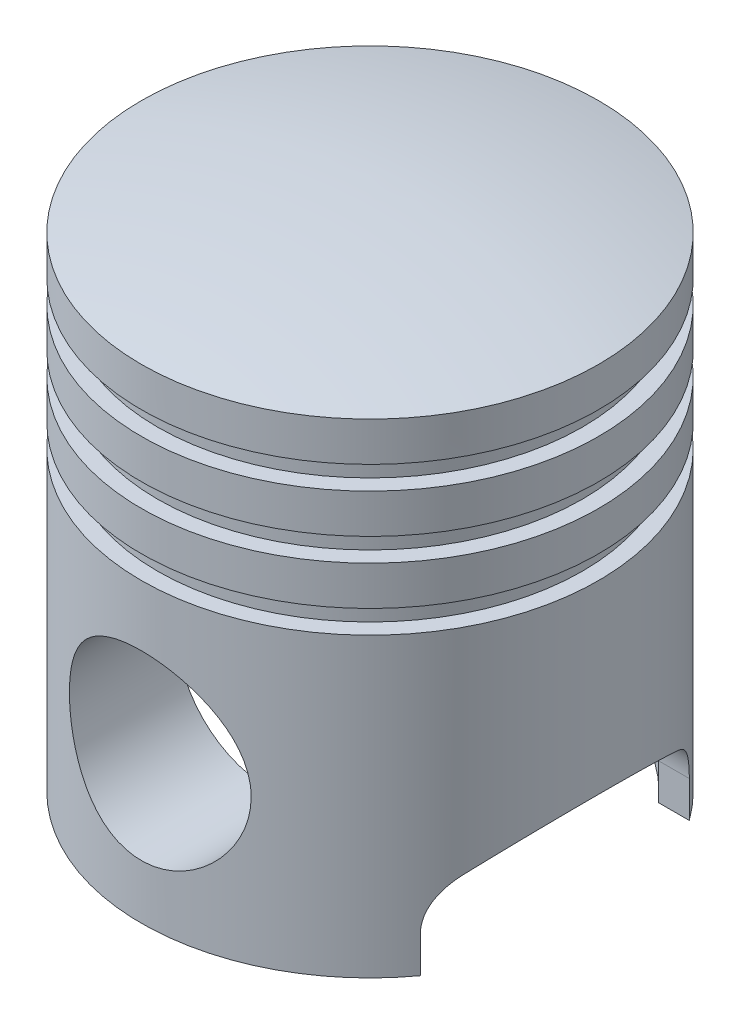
ISO-10303-21;
HEADER;
FILE_DESCRIPTION(('STEP AP214'),'2;1');
FILE_NAME('part.step','',(''),(''),'','','');
FILE_SCHEMA(('AUTOMOTIVE_DESIGN { 1 0 10303 214 1 1 1 1 }'));
ENDSEC;
DATA;
#1=APPLICATION_CONTEXT('core data for automotive mechanical design processes');
#2=APPLICATION_PROTOCOL_DEFINITION('international standard','automotive_design',2000,#1);
#3=PRODUCT_CONTEXT('',#1,'mechanical');
#4=PRODUCT('Part','Part','',(#3));
#5=PRODUCT_RELATED_PRODUCT_CATEGORY('part','',(#4));
#6=PRODUCT_DEFINITION_FORMATION('','',#4);
#7=PRODUCT_DEFINITION_CONTEXT('part definition',#1,'design');
#8=PRODUCT_DEFINITION('design','',#6,#7);
#9=PRODUCT_DEFINITION_SHAPE('','',#8);
#10=(LENGTH_UNIT() NAMED_UNIT(*) SI_UNIT(.MILLI.,.METRE.));
#11=(NAMED_UNIT(*) PLANE_ANGLE_UNIT() SI_UNIT($,.RADIAN.));
#12=(NAMED_UNIT(*) SI_UNIT($,.STERADIAN.) SOLID_ANGLE_UNIT());
#13=UNCERTAINTY_MEASURE_WITH_UNIT(LENGTH_MEASURE(1.E-05),#10,'distance_accuracy_value','');
#14=(GEOMETRIC_REPRESENTATION_CONTEXT(3) GLOBAL_UNCERTAINTY_ASSIGNED_CONTEXT((#13)) GLOBAL_UNIT_ASSIGNED_CONTEXT((#10,
#11,#12)) REPRESENTATION_CONTEXT('',''));
#15=CARTESIAN_POINT('',(0.,0.,0.));
#16=DIRECTION('',(0.,0.,1.));
#17=DIRECTION('',(1.,0.,0.));
#18=AXIS2_PLACEMENT_3D('',#15,#16,#17);
#19=CARTESIAN_POINT('',(0.,0.,0.));
#20=DIRECTION('',(0.,1.,0.));
#21=DIRECTION('',(0.,0.,1.));
#22=AXIS2_PLACEMENT_3D('',#19,#20,#21);
#23=CYLINDRICAL_SURFACE('',#22,38.);
#24=CARTESIAN_POINT('',(22.5,27.,-30.6227039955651));
#25=CARTESIAN_POINT('',(22.500001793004,27.5678777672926,-30.6227014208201));
#26=CARTESIAN_POINT('',(22.4784694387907,28.135734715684,-30.6385582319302));
#27=CARTESIAN_POINT('',(22.3927360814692,29.2664579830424,-30.7012731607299));
#28=CARTESIAN_POINT('',(22.3285363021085,29.8293244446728,-30.7481303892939));
#29=CARTESIAN_POINT('',(22.1584874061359,30.9459779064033,-30.8708985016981));
#30=CARTESIAN_POINT('',(22.0526012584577,31.4997563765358,-30.9468352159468));
#31=CARTESIAN_POINT('',(21.800787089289,32.5938222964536,-31.1247390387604));
#32=CARTESIAN_POINT('',(21.6548573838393,33.134109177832,-31.2267072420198));
#33=CARTESIAN_POINT('',(21.3260529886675,34.1941074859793,-31.4521675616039));
#34=CARTESIAN_POINT('',(21.1434576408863,34.7139409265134,-31.5754960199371));
#35=CARTESIAN_POINT('',(20.7424669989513,35.73505044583,-31.8403483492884));
#36=CARTESIAN_POINT('',(20.5240553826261,36.2363179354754,-31.9818805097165));
#37=CARTESIAN_POINT('',(20.0532597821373,37.2182829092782,-32.2791612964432));
#38=CARTESIAN_POINT('',(19.8008719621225,37.6989780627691,-32.434911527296));
#39=CARTESIAN_POINT('',(19.2638574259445,38.638141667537,-32.7567054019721));
#40=CARTESIAN_POINT('',(18.979240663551,39.0966169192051,-32.9227458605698));
#41=CARTESIAN_POINT('',(18.3434087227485,40.0434694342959,-33.281646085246));
#42=CARTESIAN_POINT('',(17.9882987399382,40.5289161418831,-33.4753466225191));
#43=CARTESIAN_POINT('',(17.2411599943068,41.4690344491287,-33.8662099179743));
#44=CARTESIAN_POINT('',(16.8491291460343,41.9237043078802,-34.0633728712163));
#45=CARTESIAN_POINT('',(16.0294557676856,42.8008567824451,-34.4566873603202));
#46=CARTESIAN_POINT('',(15.6017892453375,43.2233173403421,-34.6528381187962));
#47=CARTESIAN_POINT('',(14.71261949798,44.0338115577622,-35.0396049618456));
#48=CARTESIAN_POINT('',(14.2511146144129,44.421843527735,-35.2302207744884));
#49=CARTESIAN_POINT('',(13.2459893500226,45.1999649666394,-35.621117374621));
#50=CARTESIAN_POINT('',(12.6988270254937,45.5860354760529,-35.8203278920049));
#51=CARTESIAN_POINT('',(11.5678300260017,46.3102619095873,-36.201400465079));
#52=CARTESIAN_POINT('',(10.9839921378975,46.6484136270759,-36.3832609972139));
#53=CARTESIAN_POINT('',(9.78340087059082,47.272951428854,-36.7242994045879));
#54=CARTESIAN_POINT('',(9.16667017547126,47.5593726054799,-36.8834926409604));
#55=CARTESIAN_POINT('',(7.90423321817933,48.0769607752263,-37.174486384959));
#56=CARTESIAN_POINT('',(7.25853158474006,48.3081365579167,-37.3062912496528));
#57=CARTESIAN_POINT('',(6.00497462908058,48.6928346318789,-37.527412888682));
#58=CARTESIAN_POINT('',(5.39922267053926,48.8515953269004,-37.6195494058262));
#59=CARTESIAN_POINT('',(4.17303987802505,49.1185285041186,-37.7752235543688));
#60=CARTESIAN_POINT('',(3.55260988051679,49.226703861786,-37.838762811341));
#61=CARTESIAN_POINT('',(2.30298457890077,49.3906920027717,-37.935322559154));
#62=CARTESIAN_POINT('',(1.67379627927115,49.4465444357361,-37.968366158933));
#63=CARTESIAN_POINT('',(0.412110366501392,49.5050850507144,-38.0030034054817));
#64=CARTESIAN_POINT('',(-0.220386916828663,49.5077784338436,-38.0046001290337));
#65=CARTESIAN_POINT('',(-1.40617840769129,49.4628796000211,-37.978029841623));
#66=CARTESIAN_POINT('',(-1.95979470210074,49.4213332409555,-37.9534412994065));
#67=CARTESIAN_POINT('',(-3.06085489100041,49.2977127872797,-37.8805423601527));
#68=CARTESIAN_POINT('',(-3.60829939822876,49.2156427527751,-37.8322343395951));
#69=CARTESIAN_POINT('',(-4.69327581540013,49.0119939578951,-37.713009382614));
#70=CARTESIAN_POINT('',(-5.23080737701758,48.8904138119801,-37.6420916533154));
#71=CARTESIAN_POINT('',(-6.29254210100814,48.6091541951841,-37.4792263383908));
#72=CARTESIAN_POINT('',(-6.81674471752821,48.4494731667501,-37.3872778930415));
#73=CARTESIAN_POINT('',(-7.85222579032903,48.0925215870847,-37.1836367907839));
#74=CARTESIAN_POINT('',(-8.36339577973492,47.8950093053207,-37.0718175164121));
#75=CARTESIAN_POINT('',(-9.36658866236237,47.4649671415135,-36.8311435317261));
#76=CARTESIAN_POINT('',(-9.85861171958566,47.2324375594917,-36.7022889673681));
#77=CARTESIAN_POINT('',(-10.8214427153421,46.7342404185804,-36.4300250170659));
#78=CARTESIAN_POINT('',(-11.292247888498,46.4685685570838,-36.2866137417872));
#79=CARTESIAN_POINT('',(-12.2108550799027,45.9059562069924,-35.9878917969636));
#80=CARTESIAN_POINT('',(-12.658654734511,45.6090125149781,-35.8325799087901));
#81=CARTESIAN_POINT('',(-13.5810732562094,44.9488956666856,-35.4939905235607));
#82=CARTESIAN_POINT('',(-14.0526422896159,44.5820410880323,-35.3095733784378));
#83=CARTESIAN_POINT('',(-14.9634744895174,43.8136703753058,-34.933326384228));
#84=CARTESIAN_POINT('',(-15.4027354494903,43.4121518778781,-34.7414960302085));
#85=CARTESIAN_POINT('',(-16.2479342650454,42.57589443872,-34.3543439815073));
#86=CARTESIAN_POINT('',(-16.6538299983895,42.1411148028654,-34.1590182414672));
#87=CARTESIAN_POINT('',(-17.4301858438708,41.2405097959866,-33.769472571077));
#88=CARTESIAN_POINT('',(-17.8006443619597,40.774683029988,-33.5752526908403));
#89=CARTESIAN_POINT('',(-18.5437769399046,39.7599631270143,-33.1711706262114));
#90=CARTESIAN_POINT('',(-18.9120936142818,39.2075990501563,-32.9619784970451));
#91=CARTESIAN_POINT('',(-19.6004728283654,38.06861683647,-32.5573486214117));
#92=CARTESIAN_POINT('',(-19.9205277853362,37.4819933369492,-32.3619130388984));
#93=CARTESIAN_POINT('',(-20.508920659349,36.2780597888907,-31.9922608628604));
#94=CARTESIAN_POINT('',(-20.7773357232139,35.6607972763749,-31.8180127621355));
#95=CARTESIAN_POINT('',(-21.2596125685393,34.398311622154,-31.4978223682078));
#96=CARTESIAN_POINT('',(-21.4734951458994,33.7530992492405,-31.3518692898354));
#97=CARTESIAN_POINT('',(-21.7983796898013,32.5989113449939,-31.1265099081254));
#98=CARTESIAN_POINT('',(-21.9217524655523,32.0948623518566,-31.039549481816));
#99=CARTESIAN_POINT('',(-22.1338131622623,31.0761319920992,-30.8886923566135));
#100=CARTESIAN_POINT('',(-22.2225065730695,30.5614523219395,-30.824792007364));
#101=CARTESIAN_POINT('',(-22.3639619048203,29.5251583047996,-30.7223186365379));
#102=CARTESIAN_POINT('',(-22.4167575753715,29.0035509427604,-30.6837218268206));
#103=CARTESIAN_POINT('',(-22.4857755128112,27.9566048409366,-30.6331805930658));
#104=CARTESIAN_POINT('',(-22.5019969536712,27.431266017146,-30.6212367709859));
#105=CARTESIAN_POINT('',(-22.497608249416,26.3802348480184,-30.624461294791));
#106=CARTESIAN_POINT('',(-22.4769565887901,25.8545427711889,-30.6396602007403));
#107=CARTESIAN_POINT('',(-22.3990617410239,24.8073471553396,-30.696650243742));
#108=CARTESIAN_POINT('',(-22.3418183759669,24.285843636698,-30.7384415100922));
#109=CARTESIAN_POINT('',(-22.1915314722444,23.2503531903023,-30.8471148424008));
#110=CARTESIAN_POINT('',(-22.098464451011,22.7363714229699,-30.9140133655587));
#111=CARTESIAN_POINT('',(-21.8777641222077,21.7194512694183,-31.0705921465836));
#112=CARTESIAN_POINT('',(-21.750129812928,21.2165132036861,-31.1602730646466));
#113=CARTESIAN_POINT('',(-21.4613854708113,20.2230350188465,-31.3598432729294));
#114=CARTESIAN_POINT('',(-21.3001897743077,19.7325303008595,-31.4697841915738));
#115=CARTESIAN_POINT('',(-20.9460013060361,18.7671684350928,-31.7066302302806));
#116=CARTESIAN_POINT('',(-20.7529956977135,18.2923176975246,-31.8335421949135));
#117=CARTESIAN_POINT('',(-20.3367328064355,17.3600881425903,-32.1010666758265));
#118=CARTESIAN_POINT('',(-20.1134750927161,16.9027095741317,-32.2416793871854));
#119=CARTESIAN_POINT('',(-19.6380804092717,16.0066803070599,-32.5334225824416));
#120=CARTESIAN_POINT('',(-19.3859400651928,15.5680318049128,-32.6845542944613));
#121=CARTESIAN_POINT('',(-18.8070241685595,14.6347955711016,-33.0216130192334));
#122=CARTESIAN_POINT('',(-18.4749324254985,14.1440144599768,-33.2089704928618));
#123=CARTESIAN_POINT('',(-17.7742632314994,13.1914807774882,-33.5892017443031));
#124=CARTESIAN_POINT('',(-17.4056825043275,12.7297308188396,-33.7820760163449));
#125=CARTESIAN_POINT('',(-16.6332831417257,11.8364651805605,-34.1690006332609));
#126=CARTESIAN_POINT('',(-16.2294348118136,11.4049755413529,-34.3630518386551));
#127=CARTESIAN_POINT('',(-15.3882452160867,10.5743700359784,-34.7478902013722));
#128=CARTESIAN_POINT('',(-14.9509023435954,10.1752557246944,-34.9386772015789));
#129=CARTESIAN_POINT('',(-13.989124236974,9.36491214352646,-35.3356309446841));
#130=CARTESIAN_POINT('',(-13.4605622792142,8.95809756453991,-35.540851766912));
#131=CARTESIAN_POINT('',(-12.3655546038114,8.19069232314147,-35.9364990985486));
#132=CARTESIAN_POINT('',(-11.7991052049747,7.83010616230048,-36.1269241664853));
#133=CARTESIAN_POINT('',(-10.6316117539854,7.1588321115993,-36.4875574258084));
#134=CARTESIAN_POINT('',(-10.0305859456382,6.8481182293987,-36.6577761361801));
#135=CARTESIAN_POINT('',(-8.79749397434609,6.28008946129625,-36.9730829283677));
#136=CARTESIAN_POINT('',(-8.16543210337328,6.02276721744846,-37.1181744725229));
#137=CARTESIAN_POINT('',(-6.92386903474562,5.58247287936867,-37.3688409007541));
#138=CARTESIAN_POINT('',(-6.31627637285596,5.3953497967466,-37.4765743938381));
#139=CARTESIAN_POINT('',(-5.08327566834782,5.07247574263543,-37.6636293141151));
#140=CARTESIAN_POINT('',(-4.4578683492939,4.93672268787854,-37.7429518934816));
#141=CARTESIAN_POINT('',(-3.19522650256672,4.71882851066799,-37.8707382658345));
#142=CARTESIAN_POINT('',(-2.55800290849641,4.63664014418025,-37.9192292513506));
#143=CARTESIAN_POINT('',(-1.27725675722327,4.52709347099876,-37.9839378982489));
#144=CARTESIAN_POINT('',(-0.63373496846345,4.49972855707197,-38.0001594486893));
#145=CARTESIAN_POINT('',(0.57026680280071,4.50024039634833,-37.9998587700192));
#146=CARTESIAN_POINT('',(1.13076488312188,4.52145481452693,-37.9872855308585));
#147=CARTESIAN_POINT('',(2.24748591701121,4.60553078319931,-37.9375945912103));
#148=CARTESIAN_POINT('',(2.80370931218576,4.66838797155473,-37.9004794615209));
#149=CARTESIAN_POINT('',(3.90787141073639,4.83493030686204,-37.8025897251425));
#150=CARTESIAN_POINT('',(4.45581010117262,4.93861551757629,-37.7418150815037));
#151=CARTESIAN_POINT('',(5.53971308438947,5.18554242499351,-37.598011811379));
#152=CARTESIAN_POINT('',(6.075676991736,5.32878539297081,-37.5149824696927));
#153=CARTESIAN_POINT('',(7.12657649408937,5.65144545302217,-37.3295265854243));
#154=CARTESIAN_POINT('',(7.64167720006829,5.83045298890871,-37.2273203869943));
#155=CARTESIAN_POINT('',(8.6541781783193,6.22380709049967,-37.0050519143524));
#156=CARTESIAN_POINT('',(9.15157881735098,6.4381529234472,-36.8849900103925));
#157=CARTESIAN_POINT('',(10.126451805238,6.90034765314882,-36.629345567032));
#158=CARTESIAN_POINT('',(10.6039221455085,7.14819991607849,-36.4937614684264));
#159=CARTESIAN_POINT('',(11.5370331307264,7.67555601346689,-36.2095953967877));
#160=CARTESIAN_POINT('',(11.9926715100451,7.95506312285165,-36.0610120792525));
#161=CARTESIAN_POINT('',(12.9290797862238,8.57615384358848,-35.736682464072));
#162=CARTESIAN_POINT('',(13.4071526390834,8.92118329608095,-35.5597423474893));
#163=CARTESIAN_POINT('',(14.3327180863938,9.64578730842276,-35.1968797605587));
#164=CARTESIAN_POINT('',(14.7802088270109,10.0253639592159,-35.0109567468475));
#165=CARTESIAN_POINT('',(15.643534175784,10.8174971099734,-34.6338267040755));
#166=CARTESIAN_POINT('',(16.0593348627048,11.2300880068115,-34.4426143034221));
#167=CARTESIAN_POINT('',(16.8573305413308,12.0861518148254,-34.0591604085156));
#168=CARTESIAN_POINT('',(17.2395237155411,12.52962639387,-33.8669188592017));
#169=CARTESIAN_POINT('',(18.0130114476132,13.5013945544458,-33.462578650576));
#170=CARTESIAN_POINT('',(18.3998044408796,14.0334563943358,-33.2508941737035));
#171=CARTESIAN_POINT('',(19.12702093,15.1323458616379,-32.8379655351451));
#172=CARTESIAN_POINT('',(19.4674384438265,15.6991779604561,-32.6367227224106));
#173=CARTESIAN_POINT('',(20.0989625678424,16.8648730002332,-32.2516422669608));
#174=CARTESIAN_POINT('',(20.3901010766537,17.4637148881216,-32.0677933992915));
#175=CARTESIAN_POINT('',(20.9201714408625,18.6907987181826,-31.7245367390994));
#176=CARTESIAN_POINT('',(21.1591144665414,19.3190343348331,-31.5651237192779));
#177=CARTESIAN_POINT('',(21.5544989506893,20.5192349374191,-31.2962179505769));
#178=CARTESIAN_POINT('',(21.7175734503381,21.0881693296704,-31.182952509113));
#179=CARTESIAN_POINT('',(21.9991476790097,22.241859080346,-30.9849515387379));
#180=CARTESIAN_POINT('',(22.1176521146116,22.826612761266,-30.9002129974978));
#181=CARTESIAN_POINT('',(22.3079756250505,24.0065468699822,-30.7630953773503));
#182=CARTESIAN_POINT('',(22.3798648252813,24.601710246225,-30.7106676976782));
#183=CARTESIAN_POINT('',(22.475874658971,25.7979237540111,-30.6404743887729));
#184=CARTESIAN_POINT('',(22.499998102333,26.3989735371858,-30.6227067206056));
#185=CARTESIAN_POINT('',(22.5,27.,-30.6227039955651));
#186=B_SPLINE_CURVE_WITH_KNOTS('',3,(#24,#25,#26,#27,#28,#29,#30,#31,#32,#33,#34,#35,#36,#37,
#38,#39,#40,#41,#42,#43,#44,#45,#46,#47,#48,#49,#50,#51,#52,#53,#54,#55,#56,#57,#58,#59,#60,#61,
#62,#63,#64,#65,#66,#67,#68,#69,#70,#71,#72,#73,#74,#75,#76,#77,#78,#79,#80,#81,#82,#83,#84,#85,
#86,#87,#88,#89,#90,#91,#92,#93,#94,#95,#96,#97,#98,#99,#100,#101,#102,#103,#104,#105,#106,#107,
#108,#109,#110,#111,#112,#113,#114,#115,#116,#117,#118,#119,#120,#121,#122,#123,#124,#125,#126,
#127,#128,#129,#130,#131,#132,#133,#134,#135,#136,#137,#138,#139,#140,#141,#142,#143,#144,#145,
#146,#147,#148,#149,#150,#151,#152,#153,#154,#155,#156,#157,#158,#159,#160,#161,#162,#163,#164,
#165,#166,#167,#168,#169,#170,#171,#172,#173,#174,#175,#176,#177,#178,#179,#180,#181,#182,#183,
#184,#185),.UNSPECIFIED.,.T.,.F.,(4,2,2,2,2,2,2,2,2,2,2,2,2,2,2,2,2,2,2,2,2,2,2,2,2,2,2,2,2,2,2,
2,2,2,2,2,2,2,2,2,2,2,2,2,2,2,2,2,2,2,2,2,2,2,2,2,2,2,2,2,2,2,2,2,2,2,2,2,2,2,2,2,2,2,2,2,2,2,2,
2,4),(0.,1.70297752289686,3.40590620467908,5.11035106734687,6.81486761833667,8.50685977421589,
10.1996251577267,11.8925818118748,13.5850170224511,15.478775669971,17.3726413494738,
19.2677925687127,21.163036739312,23.2562514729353,25.3496498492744,27.441622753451,
29.5332626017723,31.4294070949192,33.3254437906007,35.2200425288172,37.1144558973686,
38.7796172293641,40.4446117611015,42.1096646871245,43.7747856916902,45.450924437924,
47.1270488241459,48.8033910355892,50.4799051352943,52.3538079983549,54.2278387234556,
56.1042001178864,57.9806458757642,60.066286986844,62.1522554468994,64.2350829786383,
66.3171150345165,67.8940016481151,69.4706385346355,71.0457910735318,72.6209791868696,
74.1979419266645,75.7749123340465,77.3529182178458,78.93096983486,80.5130998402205,
82.095869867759,83.6786624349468,85.2616401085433,87.1242533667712,88.9870340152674,
90.8513984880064,92.7158524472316,94.8067240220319,96.897799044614,98.9877806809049,
101.077474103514,103.009139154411,104.940725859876,106.870606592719,108.800254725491,
110.481317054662,112.162203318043,113.843092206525,115.524035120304,117.186731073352,
118.849392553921,120.512221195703,122.175222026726,124.020003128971,125.864895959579,
127.711736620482,129.558677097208,131.62925548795,133.700100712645,135.769600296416,
137.838656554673,139.644060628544,141.449273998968,143.251765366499,145.054150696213),.UNSPECIFIED.);
#187=CARTESIAN_POINT('',(22.5,27.,-30.6227039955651));
#188=VERTEX_POINT('',#187);
#189=EDGE_CURVE('E384',#188,#188,#186,.T.);
#190=ORIENTED_EDGE('',*,*,#189,.F.);
#191=EDGE_LOOP('',(#190));
#192=FACE_BOUND('',#191,.T.);
#193=DIRECTION('',(0.,1.,0.));
#194=VECTOR('',#193,1.);
#195=CARTESIAN_POINT('',(28.6181760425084,0.,25.));
#196=LINE('',#195,#194);
#197=CARTESIAN_POINT('',(28.6181760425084,0.,25.));
#198=VERTEX_POINT('',#197);
#199=CARTESIAN_POINT('',(28.6181760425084,6.75577212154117,25.));
#200=VERTEX_POINT('',#199);
#201=EDGE_CURVE('E236',#198,#200,#196,.T.);
#202=ORIENTED_EDGE('',*,*,#201,.F.);
#203=CARTESIAN_POINT('',(0.,0.,0.));
#204=DIRECTION('',(0.,1.,0.));
#205=DIRECTION('',(0.,0.,1.));
#206=AXIS2_PLACEMENT_3D('',#203,#204,#205);
#207=CIRCLE('',#206,38.);
#208=CARTESIAN_POINT('',(-28.6181760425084,0.,25.));
#209=VERTEX_POINT('',#208);
#210=EDGE_CURVE('E168',#209,#198,#207,.T.);
#211=ORIENTED_EDGE('',*,*,#210,.F.);
#212=DIRECTION('',(0.,1.,0.));
#213=VECTOR('',#212,1.);
#214=CARTESIAN_POINT('',(-28.6181760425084,0.,25.));
#215=LINE('',#214,#213);
#216=CARTESIAN_POINT('',(-28.6181760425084,6.75577212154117,25.));
#217=VERTEX_POINT('',#216);
#218=EDGE_CURVE('E157',#217,#209,#215,.F.);
#219=ORIENTED_EDGE('',*,*,#218,.F.);
#220=CARTESIAN_POINT('',(-28.6181760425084,6.75577212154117,25.));
#221=CARTESIAN_POINT('',(-28.6181732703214,6.87522037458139,25.0000016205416));
#222=CARTESIAN_POINT('',(-28.6200463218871,6.99465004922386,24.997859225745));
#223=CARTESIAN_POINT('',(-28.6275134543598,7.23323302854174,24.9893081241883));
#224=CARTESIAN_POINT('',(-28.6331073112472,7.3523863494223,24.9828996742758));
#225=CARTESIAN_POINT('',(-28.6554074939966,7.70882263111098,24.9573269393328));
#226=CARTESIAN_POINT('',(-28.6776325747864,7.94535616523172,24.9318151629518));
#227=CARTESIAN_POINT('',(-28.7358688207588,8.41209910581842,24.8646692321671));
#228=CARTESIAN_POINT('',(-28.7717520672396,8.64234656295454,24.8231846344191));
#229=CARTESIAN_POINT('',(-28.8563267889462,9.09715319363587,24.7248176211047));
#230=CARTESIAN_POINT('',(-28.9050204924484,9.32171137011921,24.6679325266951));
#231=CARTESIAN_POINT('',(-29.0138105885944,9.76297053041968,24.5398819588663));
#232=CARTESIAN_POINT('',(-29.0738667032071,9.9796961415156,24.4687668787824));
#233=CARTESIAN_POINT('',(-29.2041508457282,10.4050318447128,24.3131218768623));
#234=CARTESIAN_POINT('',(-29.2743785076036,10.6136422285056,24.228592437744));
#235=CARTESIAN_POINT('',(-29.4987741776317,11.227375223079,23.9557438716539));
#236=CARTESIAN_POINT('',(-29.6664006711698,11.6194082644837,23.7484581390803));
#237=CARTESIAN_POINT('',(-29.9708922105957,12.2482063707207,23.3620645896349));
#238=CARTESIAN_POINT('',(-30.101145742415,12.4953836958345,23.194194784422));
#239=CARTESIAN_POINT('',(-30.3708884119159,12.970635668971,22.8398478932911));
#240=CARTESIAN_POINT('',(-30.5103764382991,13.1987126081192,22.6533730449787));
#241=CARTESIAN_POINT('',(-30.796067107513,13.6353211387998,22.2634387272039));
#242=CARTESIAN_POINT('',(-30.9422712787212,13.8438482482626,22.0599753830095));
#243=CARTESIAN_POINT('',(-31.2391185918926,14.2408725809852,21.6375617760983));
#244=CARTESIAN_POINT('',(-31.3897598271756,14.4293782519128,21.4186181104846));
#245=CARTESIAN_POINT('',(-31.6689847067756,14.7571360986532,21.0030354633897));
#246=CARTESIAN_POINT('',(-31.7971913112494,14.8994215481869,20.8085235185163));
#247=CARTESIAN_POINT('',(-32.0539626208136,15.1689176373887,20.4107697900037));
#248=CARTESIAN_POINT('',(-32.1825246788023,15.2961772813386,20.20755950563));
#249=CARTESIAN_POINT('',(-32.310988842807,15.4160261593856,20.));
#250=B_SPLINE_CURVE_WITH_KNOTS('',3,(#220,#221,#222,#223,#224,#225,#226,#227,#228,#229,#230,
#231,#232,#233,#234,#235,#236,#237,#238,#239,#240,#241,#242,#243,#244,#245,#246,#247,#248,#249),
.UNSPECIFIED.,.F.,.F.,(4,2,2,2,2,2,2,2,2,2,2,2,2,2,4),(0.,0.358274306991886,0.716527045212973,
1.4322130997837,2.1413548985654,2.85062012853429,3.55741669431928,4.26418783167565,
5.68089152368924,6.65766947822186,7.6343300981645,8.61121408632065,9.58768424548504,
10.4060779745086,11.2217242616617),.UNSPECIFIED.);
#251=CARTESIAN_POINT('',(-32.310988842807,15.4160261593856,20.));
#252=VERTEX_POINT('',#251);
#253=EDGE_CURVE('E271',#217,#252,#250,.T.);
#254=ORIENTED_EDGE('',*,*,#253,.T.);
#255=CARTESIAN_POINT('',(-28.6181760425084,12.,-25.));
#256=CARTESIAN_POINT('',(-29.1922818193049,12.5262205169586,-24.3427614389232));
#257=CARTESIAN_POINT('',(-29.7493245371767,13.0392479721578,-23.6594393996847));
#258=CARTESIAN_POINT('',(-30.8251213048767,14.0337717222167,-22.2397600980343));
#259=CARTESIAN_POINT('',(-31.343821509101,14.5152235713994,-21.503331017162));
#260=CARTESIAN_POINT('',(-32.34099451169,15.4435370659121,-19.9724963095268));
#261=CARTESIAN_POINT('',(-32.8191258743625,15.8901030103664,-19.1776870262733));
#262=CARTESIAN_POINT('',(-33.7244309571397,16.7376558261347,-17.5368202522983));
#263=CARTESIAN_POINT('',(-34.1516313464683,17.1386665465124,-16.6907899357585));
#264=CARTESIAN_POINT('',(-34.8845871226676,17.8279658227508,-15.0900890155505));
#265=CARTESIAN_POINT('',(-35.1988219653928,18.124008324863,-14.3426363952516));
#266=CARTESIAN_POINT('',(-35.782991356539,18.6750503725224,-12.8158278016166));
#267=CARTESIAN_POINT('',(-36.0529261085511,18.9300501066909,-12.0364719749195));
#268=CARTESIAN_POINT('',(-36.5437377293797,19.3941556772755,-10.4518451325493));
#269=CARTESIAN_POINT('',(-36.7647595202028,19.6033970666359,-9.64665899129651));
#270=CARTESIAN_POINT('',(-37.1550789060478,19.9731730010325,-8.01282817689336));
#271=CARTESIAN_POINT('',(-37.3243774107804,20.1337084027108,-7.18418391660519));
#272=CARTESIAN_POINT('',(-37.6091009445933,20.4038180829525,-5.50336331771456));
#273=CARTESIAN_POINT('',(-37.7241434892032,20.5130305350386,-4.65106348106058));
#274=CARTESIAN_POINT('',(-37.8962658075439,20.6764665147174,-2.9353518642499));
#275=CARTESIAN_POINT('',(-37.9533449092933,20.7306894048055,-2.0719399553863));
#276=CARTESIAN_POINT('',(-38.0083367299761,20.7829290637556,-0.341133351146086));
#277=CARTESIAN_POINT('',(-38.0062223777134,20.7809201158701,0.526262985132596));
#278=CARTESIAN_POINT('',(-37.9428008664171,20.7206735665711,2.25687701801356));
#279=CARTESIAN_POINT('',(-37.881497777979,20.662439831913,3.12009499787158));
#280=CARTESIAN_POINT('',(-37.7099008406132,20.4995110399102,4.75058232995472));
#281=CARTESIAN_POINT('',(-37.6050112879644,20.3999421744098,5.51894691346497));
#282=CARTESIAN_POINT('',(-37.349929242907,20.1579452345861,7.04118405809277));
#283=CARTESIAN_POINT('',(-37.19974018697,20.0155204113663,7.79505771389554));
#284=CARTESIAN_POINT('',(-36.8563837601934,19.6901743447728,9.28389149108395));
#285=CARTESIAN_POINT('',(-36.6632209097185,19.5072573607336,10.0188535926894));
#286=CARTESIAN_POINT('',(-36.2366159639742,19.1036880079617,11.466345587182));
#287=CARTESIAN_POINT('',(-36.0031720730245,18.8830339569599,12.1788744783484));
#288=CARTESIAN_POINT('',(-35.4834267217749,18.3923700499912,13.6216737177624));
#289=CARTESIAN_POINT('',(-35.1947574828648,18.1201593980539,14.3503402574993));
#290=CARTESIAN_POINT('',(-34.5789158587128,17.5403557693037,15.7766328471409));
#291=CARTESIAN_POINT('',(-34.2517402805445,17.2327598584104,16.4742563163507));
#292=CARTESIAN_POINT('',(-33.5622481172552,16.5857665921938,17.8370097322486));
#293=CARTESIAN_POINT('',(-33.1999154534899,16.2463546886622,18.5021246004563));
#294=CARTESIAN_POINT('',(-32.4435136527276,15.5394096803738,19.798530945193));
#295=CARTESIAN_POINT('',(-32.0494397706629,15.171872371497,20.429817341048));
#296=CARTESIAN_POINT('',(-31.1714895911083,14.355242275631,21.7498724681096));
#297=CARTESIAN_POINT('',(-30.6829961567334,13.9021721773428,22.4331222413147));
#298=CARTESIAN_POINT('',(-29.9258667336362,13.2025946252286,23.4225162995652));
#299=CARTESIAN_POINT('',(-29.6698679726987,12.966479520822,23.7458961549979));
#300=CARTESIAN_POINT('',(-29.1498989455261,12.4878829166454,24.3813832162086));
#301=CARTESIAN_POINT('',(-28.8859282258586,12.2454010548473,24.693489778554));
#302=CARTESIAN_POINT('',(-28.6181760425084,12.,25.));
#303=B_SPLINE_CURVE_WITH_KNOTS('',3,(#255,#256,#257,#258,#259,#260,#261,#262,#263,#264,#265,
#266,#267,#268,#269,#270,#271,#272,#273,#274,#275,#276,#277,#278,#279,#280,#281,#282,#283,#284,
#285,#286,#287,#288,#289,#290,#291,#292,#293,#294,#295,#296,#297,#298,#299,#300,#301,#302),
.UNSPECIFIED.,.F.,.F.,(4,2,2,2,2,2,2,2,2,2,2,2,2,2,2,2,2,2,2,2,2,2,2,4),(0.,3.05719266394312,
6.11860013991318,9.20363955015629,12.2870563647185,14.874095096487,17.4611219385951,
20.0403780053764,22.6195887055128,25.2167197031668,27.8138808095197,30.4122297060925,
33.0103999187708,35.3533343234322,37.6960910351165,40.0386014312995,42.3812162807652,
44.8679001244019,47.3547903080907,49.8428232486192,52.3312288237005,55.1917108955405,
56.6172531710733,58.0428766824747),.UNSPECIFIED.);
#304=CARTESIAN_POINT('',(-32.310988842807,15.4160261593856,-20.));
#305=VERTEX_POINT('',#304);
#306=EDGE_CURVE('E221',#305,#252,#303,.T.);
#307=ORIENTED_EDGE('',*,*,#306,.F.);
#308=CARTESIAN_POINT('',(-32.310988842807,15.4160261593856,-20.));
#309=CARTESIAN_POINT('',(-32.1497784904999,15.2655936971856,-20.2604926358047));
#310=CARTESIAN_POINT('',(-31.9883798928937,15.1035042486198,-20.5141522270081));
#311=CARTESIAN_POINT('',(-31.667093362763,14.7564371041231,-21.0066946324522));
#312=CARTESIAN_POINT('',(-31.5072067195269,14.5714414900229,-21.2455656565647));
#313=CARTESIAN_POINT('',(-31.1898555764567,14.1776929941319,-21.7088099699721));
#314=CARTESIAN_POINT('',(-31.032419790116,13.968765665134,-21.9330552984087));
#315=CARTESIAN_POINT('',(-30.7238205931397,13.5289977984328,-22.3632963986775));
#316=CARTESIAN_POINT('',(-30.572654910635,13.2981652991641,-22.5692988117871));
#317=CARTESIAN_POINT('',(-30.1867332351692,12.6624470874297,-23.0850541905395));
#318=CARTESIAN_POINT('',(-29.9591929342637,12.2393941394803,-23.3785827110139));
#319=CARTESIAN_POINT('',(-29.6470697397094,11.5651509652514,-23.7714004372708));
#320=CARTESIAN_POINT('',(-29.5479751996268,11.3340358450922,-23.8943309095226));
#321=CARTESIAN_POINT('',(-29.3614060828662,10.858983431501,-24.1232158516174));
#322=CARTESIAN_POINT('',(-29.2739286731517,10.6150492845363,-24.2291744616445));
#323=CARTESIAN_POINT('',(-29.1282304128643,10.1632943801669,-24.4040279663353));
#324=CARTESIAN_POINT('',(-29.0676133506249,9.95748215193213,-24.4761361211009));
#325=CARTESIAN_POINT('',(-28.956614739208,9.53907866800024,-24.6073535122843));
#326=CARTESIAN_POINT('',(-28.9062309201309,9.32648892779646,-24.6664656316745));
#327=CARTESIAN_POINT('',(-28.8168665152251,8.8959357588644,-24.7708079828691));
#328=CARTESIAN_POINT('',(-28.7778681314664,8.67798130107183,-24.8160598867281));
#329=CARTESIAN_POINT('',(-28.712131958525,8.23781576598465,-24.8920872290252));
#330=CARTESIAN_POINT('',(-28.6853883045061,8.01560677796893,-24.9228695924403));
#331=CARTESIAN_POINT('',(-28.6495534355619,7.62037904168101,-24.9640474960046));
#332=CARTESIAN_POINT('',(-28.6378059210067,7.44791228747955,-24.9775163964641));
#333=CARTESIAN_POINT('',(-28.6221085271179,7.10222910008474,-24.9954982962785));
#334=CARTESIAN_POINT('',(-28.6181555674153,6.9290129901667,-25.0000148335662));
#335=CARTESIAN_POINT('',(-28.6181760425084,6.75577212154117,-25.));
#336=B_SPLINE_CURVE_WITH_KNOTS('',3,(#308,#309,#310,#311,#312,#313,#314,#315,#316,#317,#318,
#319,#320,#321,#322,#323,#324,#325,#326,#327,#328,#329,#330,#331,#332,#333,#334,#335),
.UNSPECIFIED.,.F.,.F.,(4,2,2,2,2,2,2,2,2,2,2,2,2,4),(0.,1.02359738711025,2.04800059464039,
3.08041356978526,4.11244913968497,5.79350583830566,6.6324090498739,7.47110730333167,
8.14950806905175,8.82775818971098,9.50494230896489,10.1818020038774,10.7015806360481,
11.2211538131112),.UNSPECIFIED.);
#337=CARTESIAN_POINT('',(-28.6181760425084,6.75577212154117,-25.));
#338=VERTEX_POINT('',#337);
#339=EDGE_CURVE('E255',#305,#338,#336,.T.);
#340=ORIENTED_EDGE('',*,*,#339,.T.);
#341=DIRECTION('',(0.,1.,0.));
#342=VECTOR('',#341,1.);
#343=CARTESIAN_POINT('',(-28.6181760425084,0.,-25.));
#344=LINE('',#343,#342);
#345=CARTESIAN_POINT('',(-28.6181760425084,0.,-25.));
#346=VERTEX_POINT('',#345);
#347=EDGE_CURVE('E163',#346,#338,#344,.T.);
#348=ORIENTED_EDGE('',*,*,#347,.F.);
#349=CARTESIAN_POINT('',(28.6181760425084,0.,-25.));
#350=VERTEX_POINT('',#349);
#351=EDGE_CURVE('E160',#350,#346,#207,.T.);
#352=ORIENTED_EDGE('',*,*,#351,.F.);
#353=DIRECTION('',(0.,1.,0.));
#354=VECTOR('',#353,1.);
#355=CARTESIAN_POINT('',(28.6181760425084,0.,-25.));
#356=LINE('',#355,#354);
#357=CARTESIAN_POINT('',(28.6181760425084,6.75577212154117,-25.));
#358=VERTEX_POINT('',#357);
#359=EDGE_CURVE('E148',#358,#350,#356,.F.);
#360=ORIENTED_EDGE('',*,*,#359,.F.);
#361=CARTESIAN_POINT('',(28.6181760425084,6.75577212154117,-25.));
#362=CARTESIAN_POINT('',(28.6181732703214,6.87522037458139,-25.0000016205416));
#363=CARTESIAN_POINT('',(28.6200463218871,6.99465004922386,-24.997859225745));
#364=CARTESIAN_POINT('',(28.6275134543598,7.23323302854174,-24.9893081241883));
#365=CARTESIAN_POINT('',(28.6331073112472,7.3523863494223,-24.9828996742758));
#366=CARTESIAN_POINT('',(28.6554074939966,7.70882263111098,-24.9573269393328));
#367=CARTESIAN_POINT('',(28.6776325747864,7.94535616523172,-24.9318151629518));
#368=CARTESIAN_POINT('',(28.7358688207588,8.41209910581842,-24.8646692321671));
#369=CARTESIAN_POINT('',(28.7717520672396,8.64234656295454,-24.8231846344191));
#370=CARTESIAN_POINT('',(28.8563267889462,9.09715319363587,-24.7248176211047));
#371=CARTESIAN_POINT('',(28.9050204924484,9.32171137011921,-24.6679325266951));
#372=CARTESIAN_POINT('',(29.0138105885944,9.76297053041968,-24.5398819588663));
#373=CARTESIAN_POINT('',(29.0738667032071,9.9796961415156,-24.4687668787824));
#374=CARTESIAN_POINT('',(29.2041508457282,10.4050318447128,-24.3131218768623));
#375=CARTESIAN_POINT('',(29.2743785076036,10.6136422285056,-24.228592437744));
#376=CARTESIAN_POINT('',(29.4987741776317,11.227375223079,-23.9557438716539));
#377=CARTESIAN_POINT('',(29.6664006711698,11.6194082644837,-23.7484581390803));
#378=CARTESIAN_POINT('',(29.9708922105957,12.2482063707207,-23.3620645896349));
#379=CARTESIAN_POINT('',(30.101145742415,12.4953836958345,-23.194194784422));
#380=CARTESIAN_POINT('',(30.3708884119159,12.970635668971,-22.8398478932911));
#381=CARTESIAN_POINT('',(30.5103764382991,13.1987126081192,-22.6533730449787));
#382=CARTESIAN_POINT('',(30.796067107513,13.6353211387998,-22.2634387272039));
#383=CARTESIAN_POINT('',(30.9422712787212,13.8438482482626,-22.0599753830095));
#384=CARTESIAN_POINT('',(31.2391185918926,14.2408725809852,-21.6375617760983));
#385=CARTESIAN_POINT('',(31.3897598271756,14.4293782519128,-21.4186181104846));
#386=CARTESIAN_POINT('',(31.6689847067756,14.7571360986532,-21.0030354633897));
#387=CARTESIAN_POINT('',(31.7971913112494,14.8994215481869,-20.8085235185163));
#388=CARTESIAN_POINT('',(32.0539626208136,15.1689176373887,-20.4107697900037));
#389=CARTESIAN_POINT('',(32.1825246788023,15.2961772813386,-20.20755950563));
#390=CARTESIAN_POINT('',(32.310988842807,15.4160261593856,-20.));
#391=B_SPLINE_CURVE_WITH_KNOTS('',3,(#361,#362,#363,#364,#365,#366,#367,#368,#369,#370,#371,
#372,#373,#374,#375,#376,#377,#378,#379,#380,#381,#382,#383,#384,#385,#386,#387,#388,#389,#390),
.UNSPECIFIED.,.F.,.F.,(4,2,2,2,2,2,2,2,2,2,2,2,2,2,4),(0.,0.358274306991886,0.716527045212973,
1.4322130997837,2.1413548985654,2.85062012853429,3.55741669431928,4.26418783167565,
5.68089152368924,6.65766947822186,7.6343300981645,8.61121408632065,9.58768424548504,
10.4060779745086,11.2217242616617),.UNSPECIFIED.);
#392=CARTESIAN_POINT('',(32.310988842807,15.4160261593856,-20.));
#393=VERTEX_POINT('',#392);
#394=EDGE_CURVE('E263',#358,#393,#391,.T.);
#395=ORIENTED_EDGE('',*,*,#394,.T.);
#396=CARTESIAN_POINT('',(28.6181760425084,12.,25.));
#397=CARTESIAN_POINT('',(29.1922818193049,12.5262205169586,24.3427614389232));
#398=CARTESIAN_POINT('',(29.7493245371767,13.0392479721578,23.6594393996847));
#399=CARTESIAN_POINT('',(30.8251213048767,14.0337717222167,22.2397600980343));
#400=CARTESIAN_POINT('',(31.343821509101,14.5152235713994,21.503331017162));
#401=CARTESIAN_POINT('',(32.34099451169,15.4435370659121,19.9724963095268));
#402=CARTESIAN_POINT('',(32.8191258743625,15.8901030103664,19.1776870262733));
#403=CARTESIAN_POINT('',(33.7244309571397,16.7376558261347,17.5368202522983));
#404=CARTESIAN_POINT('',(34.1516313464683,17.1386665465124,16.6907899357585));
#405=CARTESIAN_POINT('',(34.8845871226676,17.8279658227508,15.0900890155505));
#406=CARTESIAN_POINT('',(35.1988219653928,18.124008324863,14.3426363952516));
#407=CARTESIAN_POINT('',(35.782991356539,18.6750503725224,12.8158278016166));
#408=CARTESIAN_POINT('',(36.0529261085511,18.9300501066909,12.0364719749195));
#409=CARTESIAN_POINT('',(36.5437377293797,19.3941556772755,10.4518451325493));
#410=CARTESIAN_POINT('',(36.7647595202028,19.6033970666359,9.64665899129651));
#411=CARTESIAN_POINT('',(37.1550789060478,19.9731730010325,8.01282817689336));
#412=CARTESIAN_POINT('',(37.3243774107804,20.1337084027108,7.18418391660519));
#413=CARTESIAN_POINT('',(37.6091009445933,20.4038180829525,5.50336331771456));
#414=CARTESIAN_POINT('',(37.7241434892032,20.5130305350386,4.65106348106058));
#415=CARTESIAN_POINT('',(37.8962658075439,20.6764665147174,2.9353518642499));
#416=CARTESIAN_POINT('',(37.9533449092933,20.7306894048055,2.0719399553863));
#417=CARTESIAN_POINT('',(38.0083367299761,20.7829290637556,0.341133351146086));
#418=CARTESIAN_POINT('',(38.0062223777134,20.7809201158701,-0.526262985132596));
#419=CARTESIAN_POINT('',(37.9428008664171,20.7206735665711,-2.25687701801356));
#420=CARTESIAN_POINT('',(37.881497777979,20.662439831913,-3.12009499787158));
#421=CARTESIAN_POINT('',(37.7099008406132,20.4995110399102,-4.75058232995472));
#422=CARTESIAN_POINT('',(37.6050112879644,20.3999421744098,-5.51894691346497));
#423=CARTESIAN_POINT('',(37.349929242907,20.1579452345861,-7.04118405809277));
#424=CARTESIAN_POINT('',(37.19974018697,20.0155204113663,-7.79505771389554));
#425=CARTESIAN_POINT('',(36.8563837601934,19.6901743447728,-9.28389149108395));
#426=CARTESIAN_POINT('',(36.6632209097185,19.5072573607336,-10.0188535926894));
#427=CARTESIAN_POINT('',(36.2366159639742,19.1036880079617,-11.466345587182));
#428=CARTESIAN_POINT('',(36.0031720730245,18.8830339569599,-12.1788744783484));
#429=CARTESIAN_POINT('',(35.4834267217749,18.3923700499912,-13.6216737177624));
#430=CARTESIAN_POINT('',(35.1947574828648,18.1201593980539,-14.3503402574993));
#431=CARTESIAN_POINT('',(34.5789158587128,17.5403557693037,-15.7766328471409));
#432=CARTESIAN_POINT('',(34.2517402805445,17.2327598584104,-16.4742563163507));
#433=CARTESIAN_POINT('',(33.5622481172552,16.5857665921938,-17.8370097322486));
#434=CARTESIAN_POINT('',(33.1999154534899,16.2463546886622,-18.5021246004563));
#435=CARTESIAN_POINT('',(32.4435136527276,15.5394096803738,-19.798530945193));
#436=CARTESIAN_POINT('',(32.0494397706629,15.171872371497,-20.429817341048));
#437=CARTESIAN_POINT('',(31.1714895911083,14.355242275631,-21.7498724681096));
#438=CARTESIAN_POINT('',(30.6829961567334,13.9021721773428,-22.4331222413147));
#439=CARTESIAN_POINT('',(29.9258667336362,13.2025946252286,-23.4225162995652));
#440=CARTESIAN_POINT('',(29.6698679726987,12.966479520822,-23.7458961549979));
#441=CARTESIAN_POINT('',(29.1498989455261,12.4878829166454,-24.3813832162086));
#442=CARTESIAN_POINT('',(28.8859282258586,12.2454010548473,-24.693489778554));
#443=CARTESIAN_POINT('',(28.6181760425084,12.,-25.));
#444=B_SPLINE_CURVE_WITH_KNOTS('',3,(#396,#397,#398,#399,#400,#401,#402,#403,#404,#405,#406,
#407,#408,#409,#410,#411,#412,#413,#414,#415,#416,#417,#418,#419,#420,#421,#422,#423,#424,#425,
#426,#427,#428,#429,#430,#431,#432,#433,#434,#435,#436,#437,#438,#439,#440,#441,#442,#443),
.UNSPECIFIED.,.F.,.F.,(4,2,2,2,2,2,2,2,2,2,2,2,2,2,2,2,2,2,2,2,2,2,2,4),(0.,3.05719266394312,
6.11860013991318,9.20363955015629,12.2870563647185,14.874095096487,17.4611219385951,
20.0403780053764,22.6195887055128,25.2167197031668,27.8138808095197,30.4122297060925,
33.0103999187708,35.3533343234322,37.6960910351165,40.0386014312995,42.3812162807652,
44.8679001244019,47.3547903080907,49.8428232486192,52.3312288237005,55.1917108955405,
56.6172531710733,58.0428766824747),.UNSPECIFIED.);
#445=CARTESIAN_POINT('',(32.310988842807,15.4160261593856,20.));
#446=VERTEX_POINT('',#445);
#447=EDGE_CURVE('E156',#446,#393,#444,.T.);
#448=ORIENTED_EDGE('',*,*,#447,.F.);
#449=CARTESIAN_POINT('',(32.310988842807,15.4160261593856,20.));
#450=CARTESIAN_POINT('',(32.1497784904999,15.2655936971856,20.2604926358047));
#451=CARTESIAN_POINT('',(31.9883798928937,15.1035042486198,20.5141522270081));
#452=CARTESIAN_POINT('',(31.667093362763,14.7564371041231,21.0066946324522));
#453=CARTESIAN_POINT('',(31.5072067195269,14.5714414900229,21.2455656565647));
#454=CARTESIAN_POINT('',(31.1898555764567,14.1776929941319,21.7088099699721));
#455=CARTESIAN_POINT('',(31.032419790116,13.968765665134,21.9330552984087));
#456=CARTESIAN_POINT('',(30.7238205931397,13.5289977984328,22.3632963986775));
#457=CARTESIAN_POINT('',(30.572654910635,13.2981652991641,22.5692988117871));
#458=CARTESIAN_POINT('',(30.1867332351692,12.6624470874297,23.0850541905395));
#459=CARTESIAN_POINT('',(29.9591929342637,12.2393941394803,23.3785827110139));
#460=CARTESIAN_POINT('',(29.6470697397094,11.5651509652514,23.7714004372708));
#461=CARTESIAN_POINT('',(29.5479751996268,11.3340358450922,23.8943309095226));
#462=CARTESIAN_POINT('',(29.3614060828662,10.858983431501,24.1232158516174));
#463=CARTESIAN_POINT('',(29.2739286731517,10.6150492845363,24.2291744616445));
#464=CARTESIAN_POINT('',(29.1282304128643,10.1632943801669,24.4040279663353));
#465=CARTESIAN_POINT('',(29.0676133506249,9.95748215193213,24.4761361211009));
#466=CARTESIAN_POINT('',(28.956614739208,9.53907866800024,24.6073535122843));
#467=CARTESIAN_POINT('',(28.9062309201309,9.32648892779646,24.6664656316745));
#468=CARTESIAN_POINT('',(28.8168665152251,8.8959357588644,24.7708079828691));
#469=CARTESIAN_POINT('',(28.7778681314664,8.67798130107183,24.8160598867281));
#470=CARTESIAN_POINT('',(28.712131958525,8.23781576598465,24.8920872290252));
#471=CARTESIAN_POINT('',(28.6853883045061,8.01560677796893,24.9228695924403));
#472=CARTESIAN_POINT('',(28.6495534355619,7.62037904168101,24.9640474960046));
#473=CARTESIAN_POINT('',(28.6378059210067,7.44791228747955,24.9775163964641));
#474=CARTESIAN_POINT('',(28.6221085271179,7.10222910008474,24.9954982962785));
#475=CARTESIAN_POINT('',(28.6181555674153,6.9290129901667,25.0000148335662));
#476=CARTESIAN_POINT('',(28.6181760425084,6.75577212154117,25.));
#477=B_SPLINE_CURVE_WITH_KNOTS('',3,(#449,#450,#451,#452,#453,#454,#455,#456,#457,#458,#459,
#460,#461,#462,#463,#464,#465,#466,#467,#468,#469,#470,#471,#472,#473,#474,#475,#476),
.UNSPECIFIED.,.F.,.F.,(4,2,2,2,2,2,2,2,2,2,2,2,2,4),(0.,1.02359738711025,2.04800059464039,
3.08041356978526,4.11244913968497,5.79350583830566,6.6324090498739,7.47110730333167,
8.14950806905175,8.82775818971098,9.50494230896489,10.1818020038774,10.7015806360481,
11.2211538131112),.UNSPECIFIED.);
#478=EDGE_CURVE('E73',#446,#200,#477,.T.);
#479=ORIENTED_EDGE('',*,*,#478,.T.);
#480=EDGE_LOOP('',(#202,#211,#219,#254,#307,#340,#348,#352,#360,#395,#448,#479));
#481=FACE_BOUND('',#480,.T.);
#482=CARTESIAN_POINT('',(0.,86.,0.));
#483=DIRECTION('',(0.,1.,0.));
#484=DIRECTION('',(0.,0.,1.));
#485=AXIS2_PLACEMENT_3D('',#482,#483,#484);
#486=CIRCLE('',#485,38.);
#487=CARTESIAN_POINT('',(0.,86.,38.));
#488=VERTEX_POINT('',#487);
#489=EDGE_CURVE('E604',#488,#488,#486,.T.);
#490=ORIENTED_EDGE('',*,*,#489,.T.);
#491=EDGE_LOOP('',(#490));
#492=FACE_BOUND('',#491,.T.);
#493=CARTESIAN_POINT('',(0.,4.5,38.));
#494=CARTESIAN_POINT('',(-0.576983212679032,4.50000464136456,37.9999957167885));
#495=CARTESIAN_POINT('',(-1.1541481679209,4.52222983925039,37.9868245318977));
#496=CARTESIAN_POINT('',(-2.30414335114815,4.61085339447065,37.9344519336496));
#497=CARTESIAN_POINT('',(-2.87697060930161,4.67727965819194,37.8952340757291));
#498=CARTESIAN_POINT('',(-4.0149619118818,4.85361569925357,37.7916291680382));
#499=CARTESIAN_POINT('',(-4.58010501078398,4.96362635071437,37.7271837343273));
#500=CARTESIAN_POINT('',(-5.69718254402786,5.22567449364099,37.5747243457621));
#501=CARTESIAN_POINT('',(-6.24911892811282,5.3777057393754,37.4867138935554));
#502=CARTESIAN_POINT('',(-7.33360514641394,5.72113326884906,37.2896835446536));
#503=CARTESIAN_POINT('',(-7.86623762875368,5.91233035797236,37.1807701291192));
#504=CARTESIAN_POINT('',(-8.91200615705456,6.33254378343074,36.9440606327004));
#505=CARTESIAN_POINT('',(-9.42514154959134,6.56156138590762,36.8162639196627));
#506=CARTESIAN_POINT('',(-10.4291857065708,7.0552033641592,36.5445273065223));
#507=CARTESIAN_POINT('',(-10.920104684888,7.31981115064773,36.4005949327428));
#508=CARTESIAN_POINT('',(-11.8779889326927,7.88267697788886,36.0993838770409));
#509=CARTESIAN_POINT('',(-12.3449517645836,8.18093843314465,35.9421038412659));
#510=CARTESIAN_POINT('',(-13.287438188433,8.83281663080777,35.6049569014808));
#511=CARTESIAN_POINT('',(-13.7609592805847,9.1889103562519,35.4242809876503));
#512=CARTESIAN_POINT('',(-14.6766246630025,9.93554205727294,35.0548210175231));
#513=CARTESIAN_POINT('',(-15.1187675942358,10.3260815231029,34.8660366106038));
#514=CARTESIAN_POINT('',(-15.9706649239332,11.1401331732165,34.4841413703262));
#515=CARTESIAN_POINT('',(-16.3803802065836,11.5636839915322,34.2910256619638));
#516=CARTESIAN_POINT('',(-17.1653872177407,12.4416250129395,33.9048795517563));
#517=CARTESIAN_POINT('',(-17.5406771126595,12.8960168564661,33.7118491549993));
#518=CARTESIAN_POINT('',(-18.2977853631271,13.8898413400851,33.3076025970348));
#519=CARTESIAN_POINT('',(-18.6750801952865,14.4329631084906,33.0969511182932));
#520=CARTESIAN_POINT('',(-19.3822748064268,15.5537545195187,32.6878323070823));
#521=CARTESIAN_POINT('',(-19.7121670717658,16.1314296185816,32.4893669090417));
#522=CARTESIAN_POINT('',(-20.3212636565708,17.3180369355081,32.1119057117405));
#523=CARTESIAN_POINT('',(-20.6005332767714,17.9269275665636,31.9328849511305));
#524=CARTESIAN_POINT('',(-21.1055853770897,19.1733781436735,31.6013551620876));
#525=CARTESIAN_POINT('',(-21.3313871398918,19.8109276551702,31.4488365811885));
#526=CARTESIAN_POINT('',(-21.6795046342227,20.9569607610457,31.2094941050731));
#527=CARTESIAN_POINT('',(-21.8136670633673,21.4604088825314,31.1156604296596));
#528=CARTESIAN_POINT('',(-22.0472840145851,22.4789265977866,30.9505700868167));
#529=CARTESIAN_POINT('',(-22.1467438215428,22.9939944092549,30.8793099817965));
#530=CARTESIAN_POINT('',(-22.3095805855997,24.0321099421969,30.7618712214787));
#531=CARTESIAN_POINT('',(-22.3729942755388,24.5551489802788,30.7156670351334));
#532=CARTESIAN_POINT('',(-22.4629722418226,25.6060873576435,30.6499267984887));
#533=CARTESIAN_POINT('',(-22.4895358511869,26.1339867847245,30.630391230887));
#534=CARTESIAN_POINT('',(-22.5054101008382,27.1915952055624,30.6187298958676));
#535=CARTESIAN_POINT('',(-22.4946541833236,27.7213057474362,30.6266530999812));
#536=CARTESIAN_POINT('',(-22.4359123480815,28.7775322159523,30.6697105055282));
#537=CARTESIAN_POINT('',(-22.3879262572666,29.304048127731,30.7048448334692));
#538=CARTESIAN_POINT('',(-22.2554109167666,30.3503701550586,30.8010284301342));
#539=CARTESIAN_POINT('',(-22.1708587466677,30.8701718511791,30.86209395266));
#540=CARTESIAN_POINT('',(-21.9663766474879,31.8993464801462,31.0079670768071));
#541=CARTESIAN_POINT('',(-21.8464458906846,32.408719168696,31.0927752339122));
#542=CARTESIAN_POINT('',(-21.5741030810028,33.408892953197,31.2823474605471));
#543=CARTESIAN_POINT('',(-21.4220469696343,33.8998332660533,31.386891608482));
#544=CARTESIAN_POINT('',(-21.0861657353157,34.8667456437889,31.6135199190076));
#545=CARTESIAN_POINT('',(-20.9023278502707,35.3427116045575,31.7356111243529));
#546=CARTESIAN_POINT('',(-20.5044195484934,36.2777671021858,31.9941407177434));
#547=CARTESIAN_POINT('',(-20.2903492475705,36.7368567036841,32.1305790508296));
#548=CARTESIAN_POINT('',(-19.8333530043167,37.6368645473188,32.4146649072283));
#549=CARTESIAN_POINT('',(-19.5904236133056,38.0777806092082,32.5623137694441));
#550=CARTESIAN_POINT('',(-19.0330799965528,39.0140431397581,32.8916971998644));
#551=CARTESIAN_POINT('',(-18.7135440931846,39.5058149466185,33.0749448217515));
#552=CARTESIAN_POINT('',(-18.0384131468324,40.4613496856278,33.4479357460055));
#553=CARTESIAN_POINT('',(-17.6828150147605,40.9251102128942,33.6376796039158));
#554=CARTESIAN_POINT('',(-16.936807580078,41.8234850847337,34.0194096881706));
#555=CARTESIAN_POINT('',(-16.546369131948,42.2580744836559,34.2113976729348));
#556=CARTESIAN_POINT('',(-15.7323762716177,43.0960734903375,34.5932721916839));
#557=CARTESIAN_POINT('',(-15.3088200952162,43.4994814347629,34.7831586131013));
#558=CARTESIAN_POINT('',(-14.3719087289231,44.3244791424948,35.1815345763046));
#559=CARTESIAN_POINT('',(-13.8540833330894,44.7414270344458,35.3891665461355));
#560=CARTESIAN_POINT('',(-12.7800619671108,45.5300811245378,35.7910435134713));
#561=CARTESIAN_POINT('',(-12.2238621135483,45.9017827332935,35.9852871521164));
#562=CARTESIAN_POINT('',(-11.0761231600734,46.5964079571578,36.354955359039));
#563=CARTESIAN_POINT('',(-10.4845982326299,46.919350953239,36.5303873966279));
#564=CARTESIAN_POINT('',(-9.26958063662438,47.5129680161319,36.8574345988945));
#565=CARTESIAN_POINT('',(-8.64609196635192,47.7836486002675,37.0090527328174));
#566=CARTESIAN_POINT('',(-7.41310420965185,48.2532897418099,37.2748890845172));
#567=CARTESIAN_POINT('',(-6.80533362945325,48.4557704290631,37.3908986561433));
#568=CARTESIAN_POINT('',(-5.57029176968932,48.8090408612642,37.5947259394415));
#569=CARTESIAN_POINT('',(-4.94302109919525,48.9598322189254,37.68254453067));
#570=CARTESIAN_POINT('',(-3.67497317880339,49.2072389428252,37.8272573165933));
#571=CARTESIAN_POINT('',(-3.03420929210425,49.3039055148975,37.8841807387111));
#572=CARTESIAN_POINT('',(-1.74470868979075,49.4416187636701,37.9654200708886));
#573=CARTESIAN_POINT('',(-1.09597303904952,49.4826727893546,37.989740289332));
#574=CARTESIAN_POINT('',(0.117222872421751,49.506763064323,38.0040049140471));
#575=CARTESIAN_POINT('',(0.681511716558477,49.4967381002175,37.998060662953));
#576=CARTESIAN_POINT('',(1.80688464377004,49.4344079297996,37.961190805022));
#577=CARTESIAN_POINT('',(2.36796906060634,49.3821072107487,37.9302678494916));
#578=CARTESIAN_POINT('',(3.48277372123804,49.2359251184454,37.8441922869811));
#579=CARTESIAN_POINT('',(4.03649412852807,49.1420446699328,37.7890402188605));
#580=CARTESIAN_POINT('',(5.13273045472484,48.9138893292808,37.6558093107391));
#581=CARTESIAN_POINT('',(5.67524607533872,48.779613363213,37.5777298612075));
#582=CARTESIAN_POINT('',(6.73473685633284,48.4753568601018,37.4022170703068));
#583=CARTESIAN_POINT('',(7.25200676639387,48.3061546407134,37.3052077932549));
#584=CARTESIAN_POINT('',(8.2696179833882,47.9322066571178,37.0929048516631));
#585=CARTESIAN_POINT('',(8.76995975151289,47.7274618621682,36.9776116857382));
#586=CARTESIAN_POINT('',(9.75140196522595,47.2842335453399,36.7309981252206));
#587=CARTESIAN_POINT('',(10.2325005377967,47.0457467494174,36.5996761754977));
#588=CARTESIAN_POINT('',(11.1734608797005,46.5368860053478,36.3234670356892));
#589=CARTESIAN_POINT('',(11.6333213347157,46.2665100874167,36.1785790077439));
#590=CARTESIAN_POINT('',(12.5768932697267,45.6659110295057,35.8621589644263));
#591=CARTESIAN_POINT('',(13.058102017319,45.3323876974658,35.6894235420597));
#592=CARTESIAN_POINT('',(13.9908449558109,44.6308500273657,35.3341955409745));
#593=CARTESIAN_POINT('',(14.4423774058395,44.2628336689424,35.1517023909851));
#594=CARTESIAN_POINT('',(15.3146966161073,43.4938922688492,34.7805258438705));
#595=CARTESIAN_POINT('',(15.7354499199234,43.0929323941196,34.5918360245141));
#596=CARTESIAN_POINT('',(16.5442730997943,42.2602091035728,34.2123751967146));
#597=CARTESIAN_POINT('',(16.9323413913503,41.828444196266,34.0216040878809));
#598=CARTESIAN_POINT('',(17.7209310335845,40.8796732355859,33.618276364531));
#599=CARTESIAN_POINT('',(18.1169123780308,40.3587672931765,33.4059875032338));
#600=CARTESIAN_POINT('',(18.8635267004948,39.2819644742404,32.9901503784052));
#601=CARTESIAN_POINT('',(19.2141525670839,38.7260621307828,32.7866034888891));
#602=CARTESIAN_POINT('',(19.8671467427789,37.5820539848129,32.3950813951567));
#603=CARTESIAN_POINT('',(20.1695586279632,36.9939779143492,32.2070922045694));
#604=CARTESIAN_POINT('',(20.7234731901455,35.7879269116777,31.853503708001));
#605=CARTESIAN_POINT('',(20.9749915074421,35.1699612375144,31.6878975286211));
#606=CARTESIAN_POINT('',(21.3753315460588,34.0442116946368,31.4187863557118));
#607=CARTESIAN_POINT('',(21.5346000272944,33.5414830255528,31.3095953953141));
#608=CARTESIAN_POINT('',(21.818235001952,32.5221687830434,31.1126097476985));
#609=CARTESIAN_POINT('',(21.9426062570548,32.0055851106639,31.0248121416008));
#610=CARTESIAN_POINT('',(22.1548069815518,30.9620314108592,30.873638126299));
#611=CARTESIAN_POINT('',(22.2426775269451,30.4350737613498,30.8102342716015));
#612=CARTESIAN_POINT('',(22.380836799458,29.373710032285,30.7100223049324));
#613=CARTESIAN_POINT('',(22.4311252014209,28.8393038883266,30.6732144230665));
#614=CARTESIAN_POINT('',(22.4934341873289,27.7653010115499,30.6275519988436));
#615=CARTESIAN_POINT('',(22.5053291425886,27.2256930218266,30.6187892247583));
#616=CARTESIAN_POINT('',(22.490302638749,26.1473136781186,30.6298280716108));
#617=CARTESIAN_POINT('',(22.4633810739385,25.6085423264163,30.64962977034));
#618=CARTESIAN_POINT('',(22.3711360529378,24.5358028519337,30.7170230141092));
#619=CARTESIAN_POINT('',(22.3057932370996,24.0018372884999,30.7646285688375));
#620=CARTESIAN_POINT('',(22.1376837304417,22.9428558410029,30.8858163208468));
#621=CARTESIAN_POINT('',(22.0349167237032,22.4178400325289,30.959398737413));
#622=CARTESIAN_POINT('',(21.7981185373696,21.4005365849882,31.1265502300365));
#623=CARTESIAN_POINT('',(21.6654779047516,20.9077742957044,31.2192181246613));
#624=CARTESIAN_POINT('',(21.368318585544,19.9357687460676,31.4233581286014));
#625=CARTESIAN_POINT('',(21.2037872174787,19.4565309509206,31.5348377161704));
#626=CARTESIAN_POINT('',(20.844349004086,18.5136767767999,31.7735680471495));
#627=CARTESIAN_POINT('',(20.6494423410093,18.0500603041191,31.9008186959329));
#628=CARTESIAN_POINT('',(20.2306456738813,17.1398784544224,32.1680380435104));
#629=CARTESIAN_POINT('',(20.0067520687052,16.6933152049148,32.3080083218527));
#630=CARTESIAN_POINT('',(19.4945131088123,15.7508045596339,32.6200433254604));
#631=CARTESIAN_POINT('',(19.2015548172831,15.2578955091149,32.793724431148));
#632=CARTESIAN_POINT('',(18.580501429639,14.2979594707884,33.1495559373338));
#633=CARTESIAN_POINT('',(18.252403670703,13.8309344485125,33.3317069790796));
#634=CARTESIAN_POINT('',(17.5623739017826,12.9238511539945,33.700387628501));
#635=CARTESIAN_POINT('',(17.2004181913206,12.4838121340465,33.8869202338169));
#636=CARTESIAN_POINT('',(16.4442520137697,11.6324771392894,34.2602452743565));
#637=CARTESIAN_POINT('',(16.0500396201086,11.2211828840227,34.4470377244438));
#638=CARTESIAN_POINT('',(15.1681694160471,10.3684644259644,34.8453002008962));
#639=CARTESIAN_POINT('',(14.6754278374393,9.93200613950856,35.0561909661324));
#640=CARTESIAN_POINT('',(13.6508991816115,9.10202186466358,35.4677000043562));
#641=CARTESIAN_POINT('',(13.1191075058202,8.70850094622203,35.6683170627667));
#642=CARTESIAN_POINT('',(12.0186886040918,7.96736200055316,36.0540030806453));
#643=CARTESIAN_POINT('',(11.4500451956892,7.61976434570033,36.2390651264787));
#644=CARTESIAN_POINT('',(10.2792182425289,6.97415604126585,36.5883961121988));
#645=CARTESIAN_POINT('',(9.67703930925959,6.67613859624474,36.7526679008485));
#646=CARTESIAN_POINT('',(8.4670158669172,6.14384254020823,37.0497295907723));
#647=CARTESIAN_POINT('',(7.86030701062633,5.90753233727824,37.1834969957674));
#648=CARTESIAN_POINT('',(6.62359422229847,5.48710878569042,37.4235844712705));
#649=CARTESIAN_POINT('',(5.99358633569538,5.30300434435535,37.5298998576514));
#650=CARTESIAN_POINT('',(4.71783722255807,4.99041251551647,37.7114811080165));
#651=CARTESIAN_POINT('',(4.07215629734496,4.86173944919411,37.7868505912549));
#652=CARTESIAN_POINT('',(2.7694157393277,4.66138011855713,37.9045815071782));
#653=CARTESIAN_POINT('',(2.1123664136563,4.589644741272,37.9469713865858));
#654=CARTESIAN_POINT('',(1.21132826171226,4.53132165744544,37.9814615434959));
#655=CARTESIAN_POINT('',(0.96927933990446,4.51958088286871,37.9884088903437));
#656=CARTESIAN_POINT('',(0.484830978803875,4.50391899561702,37.9976790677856));
#657=CARTESIAN_POINT('',(0.242431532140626,4.49999804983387,38.0000017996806));
#658=CARTESIAN_POINT('',(0.,4.5,38.));
#659=B_SPLINE_CURVE_WITH_KNOTS('',3,(#493,#494,#495,#496,#497,#498,#499,#500,#501,#502,#503,
#504,#505,#506,#507,#508,#509,#510,#511,#512,#513,#514,#515,#516,#517,#518,#519,#520,#521,#522,
#523,#524,#525,#526,#527,#528,#529,#530,#531,#532,#533,#534,#535,#536,#537,#538,#539,#540,#541,
#542,#543,#544,#545,#546,#547,#548,#549,#550,#551,#552,#553,#554,#555,#556,#557,#558,#559,#560,
#561,#562,#563,#564,#565,#566,#567,#568,#569,#570,#571,#572,#573,#574,#575,#576,#577,#578,#579,
#580,#581,#582,#583,#584,#585,#586,#587,#588,#589,#590,#591,#592,#593,#594,#595,#596,#597,#598,
#599,#600,#601,#602,#603,#604,#605,#606,#607,#608,#609,#610,#611,#612,#613,#614,#615,#616,#617,
#618,#619,#620,#621,#622,#623,#624,#625,#626,#627,#628,#629,#630,#631,#632,#633,#634,#635,#636,
#637,#638,#639,#640,#641,#642,#643,#644,#645,#646,#647,#648,#649,#650,#651,#652,#653,#654,#655,
#656,#657,#658),.UNSPECIFIED.,.T.,.F.,(4,2,2,2,2,2,2,2,2,2,2,2,2,2,2,2,2,2,2,2,2,2,2,2,2,2,2,2,
2,2,2,2,2,2,2,2,2,2,2,2,2,2,2,2,2,2,2,2,2,2,2,2,2,2,2,2,2,2,2,2,2,2,2,2,2,2,2,2,2,2,2,2,2,2,2,2,
2,2,2,2,2,2,4),(0.,1.73069107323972,3.46247585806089,5.19829241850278,6.93385111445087,
8.66079278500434,10.3877922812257,12.1139895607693,13.8403621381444,15.696713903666,
17.5531460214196,19.4117843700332,21.2705216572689,23.3501325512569,25.4300727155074,
27.5073104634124,29.5837979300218,31.1704026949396,32.7567657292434,34.3415092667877,
35.9262814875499,37.5138815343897,39.1014889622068,40.6900929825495,42.2787341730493,
43.8506190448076,45.4231365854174,46.9956481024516,48.5683477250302,50.4098064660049,
52.2514230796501,54.0945949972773,55.9378651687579,58.0247158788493,60.1117780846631,
62.1980085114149,64.2839786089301,66.2342490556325,68.1844586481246,70.1328200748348,
72.0809240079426,73.77205305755,75.4630026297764,77.1539145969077,78.8448715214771,
80.5015767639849,82.1582368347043,83.8150577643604,85.4719810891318,87.3014409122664,
89.1310079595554,90.9625350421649,92.7941508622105,94.8554336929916,96.9170393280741,
98.9767709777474,101.035868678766,102.649903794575,104.263718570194,105.875712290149,
107.487719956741,109.104997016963,110.722278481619,112.340375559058,113.958486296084,
115.512876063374,117.067885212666,118.622885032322,120.178078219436,121.973699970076,
123.769457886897,125.566482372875,127.36361426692,129.434725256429,131.506080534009,
133.578351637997,135.650338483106,137.641565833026,139.633132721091,141.617975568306,
143.601104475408,144.328274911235,145.055460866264),.UNSPECIFIED.);
#660=CARTESIAN_POINT('',(0.,4.5,38.));
#661=VERTEX_POINT('',#660);
#662=EDGE_CURVE('E13',#661,#661,#659,.T.);
#663=ORIENTED_EDGE('',*,*,#662,.F.);
#664=EDGE_LOOP('',(#663));
#665=FACE_BOUND('',#664,.T.);
#666=ADVANCED_FACE('F52',(#192,#481,#492,#665),#23,.F.);
#667=CARTESIAN_POINT('',(0.,0.,0.));
#668=DIRECTION('',(0.,1.,0.));
#669=DIRECTION('',(0.,0.,1.));
#670=AXIS2_PLACEMENT_3D('',#667,#668,#669);
#671=PLANE('',#670);
#672=DIRECTION('',(-1.,0.,0.));
#673=VECTOR('',#672,1.);
#674=CARTESIAN_POINT('',(191.519418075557,0.,25.));
#675=LINE('',#674,#673);
#676=CARTESIAN_POINT('',(34.3693177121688,0.,25.));
#677=VERTEX_POINT('',#676);
#678=EDGE_CURVE('E178',#677,#198,#675,.T.);
#679=ORIENTED_EDGE('',*,*,#678,.F.);
#680=CARTESIAN_POINT('',(0.,0.,0.));
#681=DIRECTION('',(0.,1.,0.));
#682=DIRECTION('',(0.,0.,1.));
#683=AXIS2_PLACEMENT_3D('',#680,#681,#682);
#684=CIRCLE('',#683,42.5);
#685=CARTESIAN_POINT('',(-34.3693177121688,0.,25.));
#686=VERTEX_POINT('',#685);
#687=EDGE_CURVE('E584',#686,#677,#684,.T.);
#688=ORIENTED_EDGE('',*,*,#687,.F.);
#689=EDGE_CURVE('E174',#209,#686,#675,.T.);
#690=ORIENTED_EDGE('',*,*,#689,.F.);
#691=ORIENTED_EDGE('',*,*,#210,.T.);
#692=EDGE_LOOP('',(#679,#688,#690,#691));
#693=FACE_BOUND('',#692,.T.);
#694=ADVANCED_FACE('F242',(#693),#671,.F.);
#695=CARTESIAN_POINT('',(0.,90.,0.));
#696=DIRECTION('',(0.,-1.,0.));
#697=DIRECTION('',(0.,0.,-1.));
#698=AXIS2_PLACEMENT_3D('',#695,#696,#697);
#699=CYLINDRICAL_SURFACE('',#698,42.5);
#700=CARTESIAN_POINT('',(0.,43.9,-42.5));
#701=CARTESIAN_POINT('',(-0.4545809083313,43.8999974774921,-42.4999980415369));
#702=CARTESIAN_POINT('',(-0.909340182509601,43.8816334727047,-42.4926863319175));
#703=CARTESIAN_POINT('',(-1.81564439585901,43.8083421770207,-42.4636227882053));
#704=CARTESIAN_POINT('',(-2.26718696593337,43.7533902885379,-42.4418612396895));
#705=CARTESIAN_POINT('',(-3.16463550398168,43.6072947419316,-42.384404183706));
#706=CARTESIAN_POINT('',(-3.61052494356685,43.5160627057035,-42.3486746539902));
#707=CARTESIAN_POINT('',(-4.4922533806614,43.2983393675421,-42.2642379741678));
#708=CARTESIAN_POINT('',(-4.92809402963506,43.1718539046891,-42.2155329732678));
#709=CARTESIAN_POINT('',(-5.78548603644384,42.8852701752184,-42.1065827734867));
#710=CARTESIAN_POINT('',(-6.20707911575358,42.7252821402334,-42.0463754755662));
#711=CARTESIAN_POINT('',(-7.03483212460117,42.3728172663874,-41.9158290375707));
#712=CARTESIAN_POINT('',(-7.4409914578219,42.1803391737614,-41.8454895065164));
#713=CARTESIAN_POINT('',(-8.23524885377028,41.7645350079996,-41.6964490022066));
#714=CARTESIAN_POINT('',(-8.62335801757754,41.5412282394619,-41.6177532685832));
#715=CARTESIAN_POINT('',(-9.37981518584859,41.0651653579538,-41.4538168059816));
#716=CARTESIAN_POINT('',(-9.74815541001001,40.812397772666,-41.3685735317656));
#717=CARTESIAN_POINT('',(-10.4780690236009,40.2678569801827,-41.189891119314));
#718=CARTESIAN_POINT('',(-10.8387042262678,39.9748894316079,-41.0962580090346));
#719=CARTESIAN_POINT('',(-11.5344387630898,39.3605101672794,-40.9064399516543));
#720=CARTESIAN_POINT('',(-11.8695263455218,39.0390855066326,-40.8102538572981));
#721=CARTESIAN_POINT('',(-12.5122840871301,38.3696162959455,-40.6177961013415));
#722=CARTESIAN_POINT('',(-12.8199412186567,38.0215592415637,-40.5215244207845));
#723=CARTESIAN_POINT('',(-13.4057395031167,37.3010501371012,-40.3315130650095));
#724=CARTESIAN_POINT('',(-13.6838934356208,36.9286087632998,-40.2377723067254));
#725=CARTESIAN_POINT('',(-14.2207699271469,36.1441515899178,-40.0512675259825));
#726=CARTESIAN_POINT('',(-14.4780797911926,35.7311126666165,-39.958732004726));
#727=CARTESIAN_POINT('',(-14.9566868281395,34.88317377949,-39.7820637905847));
#728=CARTESIAN_POINT('',(-15.1779988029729,34.4482828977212,-39.697927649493));
#729=CARTESIAN_POINT('',(-15.582789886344,33.5593535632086,-39.5407868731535));
#730=CARTESIAN_POINT('',(-15.7662745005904,33.105317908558,-39.467780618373));
#731=CARTESIAN_POINT('',(-16.0936281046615,32.1812495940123,-39.3354338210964));
#732=CARTESIAN_POINT('',(-16.2374997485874,31.7112180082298,-39.2760923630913));
#733=CARTESIAN_POINT('',(-16.4785029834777,30.780168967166,-39.1755691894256));
#734=CARTESIAN_POINT('',(-16.5774437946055,30.3196949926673,-39.1336914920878));
#735=CARTESIAN_POINT('',(-16.7366469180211,29.3909406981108,-39.0658696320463));
#736=CARTESIAN_POINT('',(-16.7969103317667,28.9226606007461,-39.0399250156));
#737=CARTESIAN_POINT('',(-16.8780271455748,27.9822638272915,-39.0049248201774));
#738=CARTESIAN_POINT('',(-16.8988969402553,27.5101488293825,-38.9958622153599));
#739=CARTESIAN_POINT('',(-16.9010176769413,26.5658240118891,-38.9949434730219));
#740=CARTESIAN_POINT('',(-16.8822704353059,26.0936141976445,-39.0030865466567));
#741=CARTESIAN_POINT('',(-16.8080426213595,25.1853838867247,-39.0351273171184));
#742=CARTESIAN_POINT('',(-16.7551756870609,24.749107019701,-39.0579035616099));
#743=CARTESIAN_POINT('',(-16.6158461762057,23.8829418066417,-39.117379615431));
#744=CARTESIAN_POINT('',(-16.5293853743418,23.4530531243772,-39.1540786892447));
#745=CARTESIAN_POINT('',(-16.3236986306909,22.6024600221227,-39.2402761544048));
#746=CARTESIAN_POINT('',(-16.204468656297,22.1817567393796,-39.2897761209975));
#747=CARTESIAN_POINT('',(-15.9343177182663,21.3521833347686,-39.4001114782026));
#748=CARTESIAN_POINT('',(-15.7833956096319,20.943313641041,-39.4609472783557));
#749=CARTESIAN_POINT('',(-15.4477275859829,20.1316323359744,-39.5935716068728));
#750=CARTESIAN_POINT('',(-15.2623593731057,19.7291104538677,-39.6655567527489));
#751=CARTESIAN_POINT('',(-14.8613219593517,18.9410551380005,-39.817547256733));
#752=CARTESIAN_POINT('',(-14.6456526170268,18.5555217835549,-39.8975526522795));
#753=CARTESIAN_POINT('',(-14.1853952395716,17.8033138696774,-40.0635046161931));
#754=CARTESIAN_POINT('',(-13.9407985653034,17.4366449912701,-40.1494529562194));
#755=CARTESIAN_POINT('',(-13.4242083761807,16.7240910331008,-40.3251169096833));
#756=CARTESIAN_POINT('',(-13.1522134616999,16.3782070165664,-40.4148327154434));
#757=CARTESIAN_POINT('',(-12.560475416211,15.6832706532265,-40.6028082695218));
#758=CARTESIAN_POINT('',(-12.2386706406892,15.3360057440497,-40.7011960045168));
#759=CARTESIAN_POINT('',(-11.5670896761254,14.669707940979,-40.8971236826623));
#760=CARTESIAN_POINT('',(-11.2173246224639,14.3506639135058,-40.9946639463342));
#761=CARTESIAN_POINT('',(-10.4915509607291,13.7424890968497,-41.1863844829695));
#762=CARTESIAN_POINT('',(-10.1155312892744,13.4533710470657,-41.2805633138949));
#763=CARTESIAN_POINT('',(-9.33954591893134,12.9071649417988,-41.4630163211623));
#764=CARTESIAN_POINT('',(-8.9395803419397,12.6500767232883,-41.551290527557));
#765=CARTESIAN_POINT('',(-8.11009951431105,12.1651926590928,-41.7212048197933));
#766=CARTESIAN_POINT('',(-7.68016139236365,11.9380622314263,-41.8026828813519));
#767=CARTESIAN_POINT('',(-6.80069304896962,11.5210658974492,-41.9547338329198));
#768=CARTESIAN_POINT('',(-6.35116239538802,11.3312008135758,-42.025306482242));
#769=CARTESIAN_POINT('',(-5.43589578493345,10.9906480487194,-42.1534631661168));
#770=CARTESIAN_POINT('',(-4.97016648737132,10.8399444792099,-42.2110524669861));
#771=CARTESIAN_POINT('',(-4.02591277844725,10.579224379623,-42.311551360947));
#772=CARTESIAN_POINT('',(-3.54738924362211,10.4692050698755,-42.3544619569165));
#773=CARTESIAN_POINT('',(-2.60979813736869,10.2963268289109,-42.4222438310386));
#774=CARTESIAN_POINT('',(-2.15123546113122,10.2310804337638,-42.4480254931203));
#775=CARTESIAN_POINT('',(-1.22971402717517,10.1384396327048,-42.484707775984));
#776=CARTESIAN_POINT('',(-0.76675544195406,10.1110437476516,-42.4956089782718));
#777=CARTESIAN_POINT('',(0.15984982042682,10.094405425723,-42.5022243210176));
#778=CARTESIAN_POINT('',(0.623496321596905,10.1051545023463,-42.4979418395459));
#779=CARTESIAN_POINT('',(1.54794958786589,10.1646687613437,-42.4743172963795));
#780=CARTESIAN_POINT('',(2.00875640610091,10.2134332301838,-42.454975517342));
#781=CARTESIAN_POINT('',(2.90365718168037,10.3454452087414,-42.4029563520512));
#782=CARTESIAN_POINT('',(3.33802912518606,10.4270664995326,-42.3709088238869));
#783=CARTESIAN_POINT('',(4.19799041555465,10.6237543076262,-42.294363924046));
#784=CARTESIAN_POINT('',(4.62358008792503,10.7388195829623,-42.2498670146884));
#785=CARTESIAN_POINT('',(5.46328347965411,11.001372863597,-42.149512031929));
#786=CARTESIAN_POINT('',(5.87739629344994,11.1488634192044,-42.093653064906));
#787=CARTESIAN_POINT('',(6.69162468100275,11.4750356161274,-41.9719148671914));
#788=CARTESIAN_POINT('',(7.09173976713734,11.6537183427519,-41.9060352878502));
#789=CARTESIAN_POINT('',(7.88765750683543,12.0468124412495,-41.7636593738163));
#790=CARTESIAN_POINT('',(8.2829573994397,12.2621464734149,-41.6869007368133));
#791=CARTESIAN_POINT('',(9.05407473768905,12.7229036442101,-41.5262431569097));
#792=CARTESIAN_POINT('',(9.42989191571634,12.968327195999,-41.4423441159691));
#793=CARTESIAN_POINT('',(10.1601188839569,13.4876811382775,-41.2693931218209));
#794=CARTESIAN_POINT('',(10.5145249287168,13.7616164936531,-41.1803402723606));
#795=CARTESIAN_POINT('',(11.2001598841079,14.3364055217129,-40.9991733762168));
#796=CARTESIAN_POINT('',(11.5313804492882,14.637268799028,-40.9070582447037));
#797=CARTESIAN_POINT('',(12.1895952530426,15.2846050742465,-40.715951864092));
#798=CARTESIAN_POINT('',(12.5149088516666,15.6327724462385,-40.6169035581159));
#799=CARTESIAN_POINT('',(13.1352271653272,16.3556278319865,-40.4205601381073));
#800=CARTESIAN_POINT('',(13.430230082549,16.7303174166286,-40.3232651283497));
#801=CARTESIAN_POINT('',(13.9881137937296,17.5041970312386,-40.1331480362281));
#802=CARTESIAN_POINT('',(14.2509827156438,17.9033960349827,-40.0403276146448));
#803=CARTESIAN_POINT('',(14.742490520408,18.723679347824,-39.8619784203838));
#804=CARTESIAN_POINT('',(14.971143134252,19.1447547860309,-39.7764467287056));
#805=CARTESIAN_POINT('',(15.3944823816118,20.0104209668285,-39.6145401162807));
#806=CARTESIAN_POINT('',(15.5888297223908,20.4551954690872,-39.5382587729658));
#807=CARTESIAN_POINT('',(15.93908433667,21.3615933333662,-39.3983653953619));
#808=CARTESIAN_POINT('',(16.0949911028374,21.8232169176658,-39.3347535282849));
#809=CARTESIAN_POINT('',(16.3666349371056,22.7596266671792,-39.222504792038));
#810=CARTESIAN_POINT('',(16.482396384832,23.2344046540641,-39.1738588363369));
#811=CARTESIAN_POINT('',(16.6725199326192,24.193569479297,-39.0933215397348));
#812=CARTESIAN_POINT('',(16.7468854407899,24.6779555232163,-39.0614288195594));
#813=CARTESIAN_POINT('',(16.8495003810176,25.617442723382,-39.0172679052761));
#814=CARTESIAN_POINT('',(16.8806592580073,26.072170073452,-39.0037628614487));
#815=CARTESIAN_POINT('',(16.9061279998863,26.9828395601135,-38.9927306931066));
#816=CARTESIAN_POINT('',(16.9004396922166,27.4387816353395,-38.9952027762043));
#817=CARTESIAN_POINT('',(16.8522841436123,28.3482924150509,-39.0160376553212));
#818=CARTESIAN_POINT('',(16.8098211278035,28.8018613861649,-39.0343986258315));
#819=CARTESIAN_POINT('',(16.688599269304,29.703228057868,-39.0863785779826));
#820=CARTESIAN_POINT('',(16.6098405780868,30.1510257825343,-39.1199974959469));
#821=CARTESIAN_POINT('',(16.4206133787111,31.0204048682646,-39.1997901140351));
#822=CARTESIAN_POINT('',(16.3114909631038,31.4423299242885,-39.245427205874));
#823=CARTESIAN_POINT('',(16.0614941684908,32.2751714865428,-39.3484010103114));
#824=CARTESIAN_POINT('',(15.9206208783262,32.6860883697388,-39.4057373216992));
#825=CARTESIAN_POINT('',(15.6082885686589,33.4945466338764,-39.5304892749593));
#826=CARTESIAN_POINT('',(15.4368284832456,33.8920875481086,-39.5979052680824));
#827=CARTESIAN_POINT('',(15.0645393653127,34.6717910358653,-39.7410294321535));
#828=CARTESIAN_POINT('',(14.8636989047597,35.0539475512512,-39.8167408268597));
#829=CARTESIAN_POINT('',(14.421905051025,35.8218929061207,-39.9789580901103));
#830=CARTESIAN_POINT('',(14.1793278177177,36.2066702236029,-40.0658319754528));
#831=CARTESIAN_POINT('',(13.6644436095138,36.9548639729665,-40.2443441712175));
#832=CARTESIAN_POINT('',(13.3921232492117,37.3182706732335,-40.3359846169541));
#833=CARTESIAN_POINT('',(12.8193986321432,38.0217415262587,-40.5216440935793));
#834=CARTESIAN_POINT('',(12.518987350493,38.3617998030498,-40.6156637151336));
#835=CARTESIAN_POINT('',(11.8919394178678,39.0165374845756,-40.8036623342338));
#836=CARTESIAN_POINT('',(11.5653133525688,39.3312270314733,-40.8976413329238));
#837=CARTESIAN_POINT('',(10.8656396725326,39.9530208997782,-41.0892652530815));
#838=CARTESIAN_POINT('',(10.4909575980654,40.2583365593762,-41.1867573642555));
#839=CARTESIAN_POINT('',(9.71608939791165,40.8362247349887,-41.3764018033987));
#840=CARTESIAN_POINT('',(9.31591272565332,41.1088092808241,-41.4685560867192));
#841=CARTESIAN_POINT('',(8.4920538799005,41.6195099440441,-41.6450789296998));
#842=CARTESIAN_POINT('',(8.06835420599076,41.8575999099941,-41.729441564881));
#843=CARTESIAN_POINT('',(7.20049523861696,42.2970388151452,-41.8879145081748));
#844=CARTESIAN_POINT('',(6.75633766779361,42.4983908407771,-41.9620256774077));
#845=CARTESIAN_POINT('',(5.85917524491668,42.8590471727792,-42.0965783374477));
#846=CARTESIAN_POINT('',(5.40649552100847,43.0190732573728,-42.157251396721));
#847=CARTESIAN_POINT('',(4.48755503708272,43.3003909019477,-42.2649480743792));
#848=CARTESIAN_POINT('',(4.02129192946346,43.4216757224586,-42.3119693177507));
#849=CARTESIAN_POINT('',(3.08025306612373,43.623869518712,-42.390852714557));
#850=CARTESIAN_POINT('',(2.60550543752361,43.7048928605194,-42.4227577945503));
#851=CARTESIAN_POINT('',(1.65027213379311,43.8261130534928,-42.47063628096));
#852=CARTESIAN_POINT('',(1.16979110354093,43.8663409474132,-42.4866218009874));
#853=CARTESIAN_POINT('',(0.57385976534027,43.8906449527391,-42.4962809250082));
#854=CARTESIAN_POINT('',(0.459123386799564,43.8941523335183,-42.4976749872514));
#855=CARTESIAN_POINT('',(0.229595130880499,43.8988301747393,-42.4995347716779));
#856=CARTESIAN_POINT('',(0.114803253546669,43.900000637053,-42.5000004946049));
#857=CARTESIAN_POINT('',(0.,43.9,-42.5));
#858=B_SPLINE_CURVE_WITH_KNOTS('',3,(#700,#701,#702,#703,#704,#705,#706,#707,#708,#709,#710,
#711,#712,#713,#714,#715,#716,#717,#718,#719,#720,#721,#722,#723,#724,#725,#726,#727,#728,#729,
#730,#731,#732,#733,#734,#735,#736,#737,#738,#739,#740,#741,#742,#743,#744,#745,#746,#747,#748,
#749,#750,#751,#752,#753,#754,#755,#756,#757,#758,#759,#760,#761,#762,#763,#764,#765,#766,#767,
#768,#769,#770,#771,#772,#773,#774,#775,#776,#777,#778,#779,#780,#781,#782,#783,#784,#785,#786,
#787,#788,#789,#790,#791,#792,#793,#794,#795,#796,#797,#798,#799,#800,#801,#802,#803,#804,#805,
#806,#807,#808,#809,#810,#811,#812,#813,#814,#815,#816,#817,#818,#819,#820,#821,#822,#823,#824,
#825,#826,#827,#828,#829,#830,#831,#832,#833,#834,#835,#836,#837,#838,#839,#840,#841,#842,#843,
#844,#845,#846,#847,#848,#849,#850,#851,#852,#853,#854,#855,#856,#857),.UNSPECIFIED.,.T.,.F.,(4,
2,2,2,2,2,2,2,2,2,2,2,2,2,2,2,2,2,2,2,2,2,2,2,2,2,2,2,2,2,2,2,2,2,2,2,2,2,2,2,2,2,2,2,2,2,2,2,2,
2,2,2,2,2,2,2,2,2,2,2,2,2,2,2,2,2,2,2,2,2,2,2,2,2,2,2,2,2,4),(0.,1.36362454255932,
2.72816676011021,4.0960535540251,5.46371391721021,6.826943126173,8.19022495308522,
9.5526569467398,10.9156212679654,12.3359827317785,13.7569936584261,15.1786759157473,
16.5997398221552,18.0839504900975,19.5675493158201,21.0509320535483,22.5342153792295,
23.950871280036,25.3674868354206,26.7835127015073,28.1994736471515,29.5181012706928,
30.8366592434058,32.1553795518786,33.4741475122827,34.8195849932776,36.1650287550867,
37.5108753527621,38.8567907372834,40.3058204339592,41.7542758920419,43.2033454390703,
44.6524076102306,46.129595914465,47.6068168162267,49.0834374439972,50.5599571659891,
51.949880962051,53.3397504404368,54.7293107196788,56.1188449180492,57.4467181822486,
58.7745421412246,60.10247057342,61.4304452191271,62.7988779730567,64.1673295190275,
65.5360197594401,66.9052001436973,68.3635659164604,69.8220181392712,71.2810075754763,
72.7394099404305,74.2115139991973,75.6836374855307,77.1548654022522,78.6259721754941,
79.9922130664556,81.3583861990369,82.7244023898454,84.0904128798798,85.4035238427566,
86.7165897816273,88.0297014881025,89.3433253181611,90.7310628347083,92.1194274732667,
93.5081402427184,94.8962950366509,96.3737038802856,97.8505680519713,99.3285460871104,
100.806399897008,102.256365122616,103.706582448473,105.152656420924,106.597629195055,
106.942009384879,107.286389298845),.UNSPECIFIED.);
#859=CARTESIAN_POINT('',(0.,43.9,-42.5));
#860=VERTEX_POINT('',#859);
#861=EDGE_CURVE('E361',#860,#860,#858,.T.);
#862=ORIENTED_EDGE('',*,*,#861,.T.);
#863=EDGE_LOOP('',(#862));
#864=FACE_BOUND('',#863,.T.);
#865=CARTESIAN_POINT('',(16.9,27.,38.9953843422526));
#866=CARTESIAN_POINT('',(16.8999965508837,26.5469260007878,38.995387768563));
#867=CARTESIAN_POINT('',(16.8817553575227,26.093710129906,39.0033070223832));
#868=CARTESIAN_POINT('',(16.808966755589,25.1905498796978,39.0347301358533));
#869=CARTESIAN_POINT('',(16.7543969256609,24.7406076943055,39.0582436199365));
#870=CARTESIAN_POINT('',(16.6093666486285,23.8465112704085,39.1201375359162));
#871=CARTESIAN_POINT('',(16.5188240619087,23.4023726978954,39.1585519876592));
#872=CARTESIAN_POINT('',(16.3028074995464,22.5241830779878,39.2489763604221));
#873=CARTESIAN_POINT('',(16.1773386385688,22.0901305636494,39.3009842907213));
#874=CARTESIAN_POINT('',(15.8931958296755,21.2364996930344,39.4167444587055));
#875=CARTESIAN_POINT('',(15.7346477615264,20.8168732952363,39.4804520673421));
#876=CARTESIAN_POINT('',(15.3854144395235,19.9929133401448,39.6178521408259));
#877=CARTESIAN_POINT('',(15.1947280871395,19.5885803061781,39.6915449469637));
#878=CARTESIAN_POINT('',(14.7827725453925,18.7976611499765,39.8468071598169));
#879=CARTESIAN_POINT('',(14.5615182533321,18.4110665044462,39.9283727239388));
#880=CARTESIAN_POINT('',(14.0897700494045,17.6572944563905,40.0972711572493));
#881=CARTESIAN_POINT('',(13.8392655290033,17.2901241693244,40.1846061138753));
#882=CARTESIAN_POINT('',(13.297080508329,16.5589642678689,40.3673580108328));
#883=CARTESIAN_POINT('',(13.0039503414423,16.1960951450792,40.462959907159));
#884=CARTESIAN_POINT('',(12.3889081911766,15.495997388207,40.6554888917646));
#885=CARTESIAN_POINT('',(12.0669951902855,15.158769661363,40.7524160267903));
#886=CARTESIAN_POINT('',(11.3960543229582,14.5117151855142,40.9451072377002));
#887=CARTESIAN_POINT('',(11.0470126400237,14.2019025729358,41.0408706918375));
#888=CARTESIAN_POINT('',(10.3240264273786,13.6118665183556,41.2286782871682));
#889=CARTESIAN_POINT('',(9.9500905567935,13.3316328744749,41.3207237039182));
#890=CARTESIAN_POINT('',(9.16417679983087,12.7921206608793,41.5022502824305));
#891=CARTESIAN_POINT('',(8.75128244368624,12.5340933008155,41.5914896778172));
#892=CARTESIAN_POINT('',(7.90331996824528,12.0539326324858,41.7609201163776));
#893=CARTESIAN_POINT('',(7.468251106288,11.8318005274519,41.8411108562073));
#894=CARTESIAN_POINT('',(6.57901200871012,11.4254865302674,41.9901148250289));
#895=CARTESIAN_POINT('',(6.12484781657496,11.2412927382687,42.0589316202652));
#896=CARTESIAN_POINT('',(5.20060033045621,10.9126050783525,42.1831850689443));
#897=CARTESIAN_POINT('',(4.73051804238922,10.7681087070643,42.2386225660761));
#898=CARTESIAN_POINT('',(3.80092430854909,10.5263100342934,42.3321467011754));
#899=CARTESIAN_POINT('',(3.34198507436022,10.4270786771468,42.3709372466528));
#900=CARTESIAN_POINT('',(2.41645191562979,10.2670599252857,42.4337819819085));
#901=CARTESIAN_POINT('',(1.94985821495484,10.2062714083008,42.4578366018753));
#902=CARTESIAN_POINT('',(1.01283472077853,10.1238243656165,42.4905150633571));
#903=CARTESIAN_POINT('',(0.542406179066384,10.1021535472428,42.4991437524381));
#904=CARTESIAN_POINT('',(-0.398637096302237,10.0981522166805,42.5007346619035));
#905=CARTESIAN_POINT('',(-0.869251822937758,10.1158203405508,42.4936974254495));
#906=CARTESIAN_POINT('',(-1.78078227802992,10.188215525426,42.4649866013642));
#907=CARTESIAN_POINT('',(-2.22189432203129,10.2408273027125,42.444148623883));
#908=CARTESIAN_POINT('',(-3.09778667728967,10.3804220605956,42.3892233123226));
#909=CARTESIAN_POINT('',(-3.53256726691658,10.4674035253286,42.3551365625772));
#910=CARTESIAN_POINT('',(-4.39287699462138,10.674913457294,42.2745705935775));
#911=CARTESIAN_POINT('',(-4.81840579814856,10.795443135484,42.2280909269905));
#912=CARTESIAN_POINT('',(-5.65747726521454,11.0689710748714,42.1238851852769));
#913=CARTESIAN_POINT('',(-6.07101959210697,11.2219702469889,42.0661587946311));
#914=CARTESIAN_POINT('',(-6.88971373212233,11.5616969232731,41.9399090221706));
#915=CARTESIAN_POINT('',(-7.29464692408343,11.7488955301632,41.8712367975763));
#916=CARTESIAN_POINT('',(-8.08724958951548,12.1539740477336,41.7253974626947));
#917=CARTESIAN_POINT('',(-8.47491901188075,12.3718540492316,41.6482303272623));
#918=CARTESIAN_POINT('',(-9.23094240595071,12.8367848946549,41.4872162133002));
#919=CARTESIAN_POINT('',(-9.59929418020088,13.0838390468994,41.4033684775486));
#920=CARTESIAN_POINT('',(-10.314865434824,13.605609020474,41.2309237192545));
#921=CARTESIAN_POINT('',(-10.6620772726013,13.880334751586,41.1423250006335));
#922=CARTESIAN_POINT('',(-11.3552808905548,14.4744559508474,40.9566180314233));
#923=CARTESIAN_POINT('',(-11.6997338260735,14.7955927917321,40.8593305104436));
#924=CARTESIAN_POINT('',(-12.3606077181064,15.4654104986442,40.6642854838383));
#925=CARTESIAN_POINT('',(-12.6770271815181,15.8140928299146,40.5665279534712));
#926=CARTESIAN_POINT('',(-13.2801009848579,16.537177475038,40.3731254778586));
#927=CARTESIAN_POINT('',(-13.5667404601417,16.9115924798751,40.2774816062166));
#928=CARTESIAN_POINT('',(-14.1081376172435,17.6837399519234,40.0910515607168));
#929=CARTESIAN_POINT('',(-14.3629070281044,18.0814637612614,40.0002636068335));
#930=CARTESIAN_POINT('',(-14.8455336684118,18.909504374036,39.823711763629));
#931=CARTESIAN_POINT('',(-15.0724406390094,19.3404212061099,39.7381589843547));
#932=CARTESIAN_POINT('',(-15.4888657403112,20.2219005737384,39.5777067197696));
#933=CARTESIAN_POINT('',(-15.6783828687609,20.6724636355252,39.5028075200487));
#934=CARTESIAN_POINT('',(-16.018104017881,21.5898739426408,39.3662784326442));
#935=CARTESIAN_POINT('',(-16.1683286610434,22.0567124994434,39.3046415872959));
#936=CARTESIAN_POINT('',(-16.4279518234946,23.0033491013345,39.1968392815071));
#937=CARTESIAN_POINT('',(-16.5373535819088,23.4831461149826,39.1506725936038));
#938=CARTESIAN_POINT('',(-16.7086801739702,24.4224199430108,39.0778469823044));
#939=CARTESIAN_POINT('',(-16.7730786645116,24.8813680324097,39.0501761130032));
#940=CARTESIAN_POINT('',(-16.8639715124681,25.8036877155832,39.0110104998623));
#941=CARTESIAN_POINT('',(-16.8904674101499,26.2670591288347,38.9995150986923));
#942=CARTESIAN_POINT('',(-16.9052420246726,27.1944022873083,38.9931129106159));
#943=CARTESIAN_POINT('',(-16.8935306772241,27.6583738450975,38.9982018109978));
#944=CARTESIAN_POINT('',(-16.832051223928,28.5833053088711,39.0247763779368));
#945=CARTESIAN_POINT('',(-16.7822840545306,29.0442652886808,39.0462616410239));
#946=CARTESIAN_POINT('',(-16.6491238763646,29.9338501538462,39.1032168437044));
#947=CARTESIAN_POINT('',(-16.5677745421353,30.362837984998,39.1378343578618));
#948=CARTESIAN_POINT('',(-16.3724914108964,31.2120467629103,39.2199277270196));
#949=CARTESIAN_POINT('',(-16.2585590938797,31.6322681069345,39.2674029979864));
#950=CARTESIAN_POINT('',(-15.9991168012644,32.4614104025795,39.373822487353));
#951=CARTESIAN_POINT('',(-15.8536018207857,32.8703295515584,39.4327685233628));
#952=CARTESIAN_POINT('',(-15.5321934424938,33.6744644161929,39.5604707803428));
#953=CARTESIAN_POINT('',(-15.3562987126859,34.0696795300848,39.6292274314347));
#954=CARTESIAN_POINT('',(-14.9677851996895,34.8598293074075,39.777636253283));
#955=CARTESIAN_POINT('',(-14.7539770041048,35.2541177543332,39.857614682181));
#956=CARTESIAN_POINT('',(-14.2963340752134,36.0235969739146,40.0240442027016));
#957=CARTESIAN_POINT('',(-14.0524890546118,36.3987811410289,40.1104975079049));
#958=CARTESIAN_POINT('',(-13.5363218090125,37.1280597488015,40.287621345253));
#959=CARTESIAN_POINT('',(-13.2639946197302,37.4821504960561,40.378292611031));
#960=CARTESIAN_POINT('',(-12.6924518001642,38.1673965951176,40.5615794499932));
#961=CARTESIAN_POINT('',(-12.3932348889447,38.4985508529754,40.6541951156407));
#962=CARTESIAN_POINT('',(-11.7466886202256,39.1595376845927,40.8458947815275));
#963=CARTESIAN_POINT('',(-11.3974411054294,39.4875036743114,40.9449566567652));
#964=CARTESIAN_POINT('',(-10.6719935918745,40.1128879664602,41.1399996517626));
#965=CARTESIAN_POINT('',(-10.2958022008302,40.4103159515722,41.2359817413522));
#966=CARTESIAN_POINT('',(-9.51846524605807,40.9727957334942,41.4223197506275));
#967=CARTESIAN_POINT('',(-9.11731338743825,41.2378393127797,41.512674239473));
#968=CARTESIAN_POINT('',(-8.29258027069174,41.7334499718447,41.6852560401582));
#969=CARTESIAN_POINT('',(-7.86899952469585,41.9640178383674,41.7674835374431));
#970=CARTESIAN_POINT('',(-7.00234232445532,42.3886293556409,41.9214834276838));
#971=CARTESIAN_POINT('',(-6.55927600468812,42.5826917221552,41.9932611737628));
#972=CARTESIAN_POINT('',(-5.65649775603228,42.9326199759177,42.1243640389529));
#973=CARTESIAN_POINT('',(-5.19678568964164,43.088485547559,42.1836890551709));
#974=CARTESIAN_POINT('',(-4.26435096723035,43.3603494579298,42.2881221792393));
#975=CARTESIAN_POINT('',(-3.79163414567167,43.4763653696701,42.3332365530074));
#976=CARTESIAN_POINT('',(-2.83677512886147,43.6673246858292,42.4079234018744));
#977=CARTESIAN_POINT('',(-2.35463356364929,43.7422708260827,42.4374969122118));
#978=CARTESIAN_POINT('',(-1.41632034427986,43.8467288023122,42.4788200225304));
#979=CARTESIAN_POINT('',(-0.960484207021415,43.8788640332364,42.4915980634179));
#980=CARTESIAN_POINT('',(-0.0475417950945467,43.9061013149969,42.5024245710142));
#981=CARTESIAN_POINT('',(0.409564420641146,43.9012050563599,42.500473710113));
#982=CARTESIAN_POINT('',(1.32151187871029,43.8544370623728,42.481897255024));
#983=CARTESIAN_POINT('',(1.77635342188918,43.8125703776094,42.4652736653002));
#984=CARTESIAN_POINT('',(2.68042426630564,43.6923118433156,42.4178055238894));
#985=CARTESIAN_POINT('',(3.12965358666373,43.6139201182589,42.3869610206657));
#986=CARTESIAN_POINT('',(4.00580740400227,43.4243211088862,42.3130116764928));
#987=CARTESIAN_POINT('',(4.43299597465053,43.3141749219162,42.2703046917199));
#988=CARTESIAN_POINT('',(5.27624579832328,43.0612883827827,42.1733488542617));
#989=CARTESIAN_POINT('',(5.69230735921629,42.9185489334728,42.1191003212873));
#990=CARTESIAN_POINT('',(6.51082642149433,42.6016592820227,42.0003595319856));
#991=CARTESIAN_POINT('',(6.91328220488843,42.4275051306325,41.9358659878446));
#992=CARTESIAN_POINT('',(7.70225471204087,42.0491429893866,41.7981538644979));
#993=CARTESIAN_POINT('',(8.08877081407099,41.8449338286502,41.7249349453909));
#994=CARTESIAN_POINT('',(8.86041902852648,41.3982761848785,41.5680734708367));
#995=CARTESIAN_POINT('',(9.24474166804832,41.1545403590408,41.4841139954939));
#996=CARTESIAN_POINT('',(9.99165209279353,40.6375656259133,41.3105787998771));
#997=CARTESIAN_POINT('',(10.3542393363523,40.3643259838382,41.2210029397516));
#998=CARTESIAN_POINT('',(11.0558112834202,39.7900184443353,41.0384021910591));
#999=CARTESIAN_POINT('',(11.3947927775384,39.4889467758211,40.9453768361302));
#1000=CARTESIAN_POINT('',(12.047469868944,38.8605978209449,40.7581134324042));
#1001=CARTESIAN_POINT('',(12.3611536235,38.5333084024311,40.6638748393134));
#1002=CARTESIAN_POINT('',(12.9797308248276,37.833639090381,40.4708276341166));
#1003=CARTESIAN_POINT('',(13.2829154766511,37.4597259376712,40.372091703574));
#1004=CARTESIAN_POINT('',(13.856628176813,36.6868660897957,40.1787938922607));
#1005=CARTESIAN_POINT('',(14.1271697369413,36.2879298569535,40.0842302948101));
#1006=CARTESIAN_POINT('',(14.6339310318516,35.4670436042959,39.9020127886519));
#1007=CARTESIAN_POINT('',(14.8701349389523,35.0450830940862,39.8143620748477));
#1008=CARTESIAN_POINT('',(15.306139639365,34.1809621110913,39.6487894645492));
#1009=CARTESIAN_POINT('',(15.5059454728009,33.7388044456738,39.5708662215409));
#1010=CARTESIAN_POINT('',(15.8512432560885,32.877398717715,39.4337350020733));
#1011=CARTESIAN_POINT('',(15.9999882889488,32.4596194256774,39.3734781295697));
#1012=CARTESIAN_POINT('',(16.264503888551,31.6122495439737,39.2649510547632));
#1013=CARTESIAN_POINT('',(16.3802783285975,31.1826603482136,39.2166794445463));
#1014=CARTESIAN_POINT('',(16.5775376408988,30.3154972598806,39.1337026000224));
#1015=CARTESIAN_POINT('',(16.6591044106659,29.8779450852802,39.0989649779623));
#1016=CARTESIAN_POINT('',(16.7874863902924,28.9970486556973,39.0440165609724));
#1017=CARTESIAN_POINT('',(16.8343219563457,28.553707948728,39.0237972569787));
#1018=CARTESIAN_POINT('',(16.8757045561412,27.9245779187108,39.0059061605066));
#1019=CARTESIAN_POINT('',(16.8848123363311,27.7398165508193,39.0019635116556));
#1020=CARTESIAN_POINT('',(16.896960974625,27.3700446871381,38.996701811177));
#1021=CARTESIAN_POINT('',(16.9000014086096,27.1850341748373,38.9953829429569));
#1022=CARTESIAN_POINT('',(16.9,27.,38.9953843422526));
#1023=B_SPLINE_CURVE_WITH_KNOTS('',3,(#865,#866,#867,#868,#869,#870,#871,#872,#873,#874,#875,
#876,#877,#878,#879,#880,#881,#882,#883,#884,#885,#886,#887,#888,#889,#890,#891,#892,#893,#894,
#895,#896,#897,#898,#899,#900,#901,#902,#903,#904,#905,#906,#907,#908,#909,#910,#911,#912,#913,
#914,#915,#916,#917,#918,#919,#920,#921,#922,#923,#924,#925,#926,#927,#928,#929,#930,#931,#932,
#933,#934,#935,#936,#937,#938,#939,#940,#941,#942,#943,#944,#945,#946,#947,#948,#949,#950,#951,
#952,#953,#954,#955,#956,#957,#958,#959,#960,#961,#962,#963,#964,#965,#966,#967,#968,#969,#970,
#971,#972,#973,#974,#975,#976,#977,#978,#979,#980,#981,#982,#983,#984,#985,#986,#987,#988,#989,
#990,#991,#992,#993,#994,#995,#996,#997,#998,#999,#1000,#1001,#1002,#1003,#1004,#1005,#1006,
#1007,#1008,#1009,#1010,#1011,#1012,#1013,#1014,#1015,#1016,#1017,#1018,#1019,#1020,#1021,
#1022),.UNSPECIFIED.,.T.,.F.,(4,2,2,2,2,2,2,2,2,2,2,2,2,2,2,2,2,2,2,2,2,2,2,2,2,2,2,2,2,2,2,2,2,
2,2,2,2,2,2,2,2,2,2,2,2,2,2,2,2,2,2,2,2,2,2,2,2,2,2,2,2,2,2,2,2,2,2,2,2,2,2,2,2,2,2,2,2,2,4),
(0.,1.3590345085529,2.71890856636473,4.08190575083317,5.44470344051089,6.80240675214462,
8.16015648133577,9.51724682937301,10.8748309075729,12.3017608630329,13.7287412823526,
15.1564532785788,16.5836712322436,18.0668079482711,19.5499943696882,21.0327148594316,
22.5153418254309,23.9269512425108,25.3385194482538,26.749643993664,28.1607196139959,
29.4933326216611,30.8258868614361,32.1584892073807,33.4911289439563,34.843740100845,
36.1963552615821,37.5491239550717,38.9023788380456,40.3433781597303,41.7844541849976,
43.2262461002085,44.6675058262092,46.1490150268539,47.630563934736,49.1113336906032,
50.5919859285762,51.982983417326,53.3739243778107,54.7645036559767,56.1550487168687,
57.4675616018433,58.7800148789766,60.092676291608,61.4053952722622,62.7707321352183,
64.1365379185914,65.5025821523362,66.8686914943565,68.3346746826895,69.8001916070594,
71.2660796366,72.7319342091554,74.197035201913,75.6621482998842,77.1266144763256,
78.5909830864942,79.960708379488,81.3303711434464,82.699846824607,84.069317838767,
85.3974829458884,86.7256112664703,88.053906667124,89.3822538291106,90.7690588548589,
92.1558984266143,93.5429261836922,94.9305995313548,96.4030791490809,97.8749471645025,
99.3474914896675,100.819831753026,102.160991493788,103.501993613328,104.839766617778,
106.176754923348,106.731742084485,107.28676803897),.UNSPECIFIED.);
#1024=CARTESIAN_POINT('',(16.9,27.,38.9953843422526));
#1025=VERTEX_POINT('',#1024);
#1026=EDGE_CURVE('E353',#1025,#1025,#1023,.T.);
#1027=ORIENTED_EDGE('',*,*,#1026,.T.);
#1028=EDGE_LOOP('',(#1027));
#1029=FACE_BOUND('',#1028,.T.);
#1030=CARTESIAN_POINT('',(0.,55.2,0.));
#1031=DIRECTION('',(0.,1.,0.));
#1032=DIRECTION('',(0.,0.,1.));
#1033=AXIS2_PLACEMENT_3D('',#1030,#1031,#1032);
#1034=CIRCLE('',#1033,42.5);
#1035=CARTESIAN_POINT('',(0.,55.2,42.5));
#1036=VERTEX_POINT('',#1035);
#1037=EDGE_CURVE('E574',#1036,#1036,#1034,.T.);
#1038=ORIENTED_EDGE('',*,*,#1037,.F.);
#1039=EDGE_LOOP('',(#1038));
#1040=FACE_BOUND('',#1039,.T.);
#1041=DIRECTION('',(0.,-1.,0.));
#1042=VECTOR('',#1041,1.);
#1043=CARTESIAN_POINT('',(-34.3693177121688,90.,25.));
#1044=LINE('',#1043,#1042);
#1045=CARTESIAN_POINT('',(-34.3693177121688,6.7557721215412,25.));
#1046=VERTEX_POINT('',#1045);
#1047=EDGE_CURVE('E349',#686,#1046,#1044,.F.);
#1048=ORIENTED_EDGE('',*,*,#1047,.F.);
#1049=ORIENTED_EDGE('',*,*,#687,.T.);
#1050=DIRECTION('',(0.,-1.,0.));
#1051=VECTOR('',#1050,1.);
#1052=CARTESIAN_POINT('',(34.3693177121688,90.,25.));
#1053=LINE('',#1052,#1051);
#1054=CARTESIAN_POINT('',(34.3693177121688,6.7557721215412,25.));
#1055=VERTEX_POINT('',#1054);
#1056=EDGE_CURVE('E347',#1055,#677,#1053,.T.);
#1057=ORIENTED_EDGE('',*,*,#1056,.F.);
#1058=CARTESIAN_POINT('',(34.3693177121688,6.75577212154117,25.));
#1059=CARTESIAN_POINT('',(34.3693156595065,6.87972818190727,25.0000012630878));
#1060=CARTESIAN_POINT('',(34.3709947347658,7.0036662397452,24.9976946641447));
#1061=CARTESIAN_POINT('',(34.3776916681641,7.25127442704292,24.9884846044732));
#1062=CARTESIAN_POINT('',(34.3827093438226,7.37494457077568,24.9815813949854));
#1063=CARTESIAN_POINT('',(34.4027235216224,7.74500704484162,24.9540210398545));
#1064=CARTESIAN_POINT('',(34.4226812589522,7.99067171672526,24.9265130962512));
#1065=CARTESIAN_POINT('',(34.4751254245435,8.47623792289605,24.8539271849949));
#1066=CARTESIAN_POINT('',(34.5075250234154,8.71616742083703,24.8089709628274));
#1067=CARTESIAN_POINT('',(34.5840651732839,9.19034428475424,24.7021607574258));
#1068=CARTESIAN_POINT('',(34.6282070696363,9.42459099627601,24.6403048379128));
#1069=CARTESIAN_POINT('',(34.7270976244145,9.88528296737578,24.5007341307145));
#1070=CARTESIAN_POINT('',(34.7818179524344,10.1117472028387,24.4230616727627));
#1071=CARTESIAN_POINT('',(34.9008464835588,10.5564210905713,24.2526640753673));
#1072=CARTESIAN_POINT('',(34.9651584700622,10.7746274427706,24.1599329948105));
#1073=CARTESIAN_POINT('',(35.1022843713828,11.2020467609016,23.9602649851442));
#1074=CARTESIAN_POINT('',(35.1751096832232,11.4112471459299,23.8533089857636));
#1075=CARTESIAN_POINT('',(35.3280334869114,11.8196412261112,23.6262319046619));
#1076=CARTESIAN_POINT('',(35.4081346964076,12.0188311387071,23.5061059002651));
#1077=CARTESIAN_POINT('',(35.6727386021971,12.6356466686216,23.1044184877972));
#1078=CARTESIAN_POINT('',(35.8688576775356,13.0335422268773,22.7996908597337));
#1079=CARTESIAN_POINT('',(36.2794249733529,13.7742113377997,22.1405506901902));
#1080=CARTESIAN_POINT('',(36.4938687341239,14.1169982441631,21.786150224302));
#1081=CARTESIAN_POINT('',(36.8420570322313,14.6156750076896,21.1891174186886));
#1082=CARTESIAN_POINT('',(36.9727989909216,14.7905293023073,20.9603124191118));
#1083=CARTESIAN_POINT('',(37.2356658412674,15.1190988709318,20.4897026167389));
#1084=CARTESIAN_POINT('',(37.367786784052,15.2728626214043,20.2479294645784));
#1085=CARTESIAN_POINT('',(37.5,15.4160261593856,20.));
#1086=B_SPLINE_CURVE_WITH_KNOTS('',3,(#1058,#1059,#1060,#1061,#1062,#1063,#1064,#1065,#1066,
#1067,#1068,#1069,#1070,#1071,#1072,#1073,#1074,#1075,#1076,#1077,#1078,#1079,#1080,#1081,#1082,
#1083,#1084,#1085),.UNSPECIFIED.,.F.,.F.,(4,2,2,2,2,2,2,2,2,2,2,2,2,4),(0.,0.371799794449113,
0.743579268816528,1.48647983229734,2.22428738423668,2.96217950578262,3.69812216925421,
4.43435589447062,5.17158677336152,5.90909415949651,7.5172474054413,9.12501038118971,
10.072893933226,11.0185609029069),.UNSPECIFIED.);
#1087=CARTESIAN_POINT('',(37.5,15.4160261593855,20.0000000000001));
#1088=VERTEX_POINT('',#1087);
#1089=EDGE_CURVE('E66',#1055,#1088,#1086,.T.);
#1090=ORIENTED_EDGE('',*,*,#1089,.T.);
#1091=CARTESIAN_POINT('',(34.3693177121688,12.,-25.));
#1092=CARTESIAN_POINT('',(34.8780871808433,12.5599609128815,-24.300583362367));
#1093=CARTESIAN_POINT('',(35.3726613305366,13.1017491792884,-23.5757400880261));
#1094=CARTESIAN_POINT('',(36.3282289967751,14.1446761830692,-22.0749151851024));
#1095=CARTESIAN_POINT('',(36.7891841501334,14.6457685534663,-21.298877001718));
#1096=CARTESIAN_POINT('',(37.6756422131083,15.6065830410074,-19.6888006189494));
#1097=CARTESIAN_POINT('',(38.100736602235,16.0658322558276,-18.8542525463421));
#1098=CARTESIAN_POINT('',(38.9035839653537,16.9311288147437,-17.1365047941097));
#1099=CARTESIAN_POINT('',(39.2813515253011,17.3371925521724,-16.2533202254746));
#1100=CARTESIAN_POINT('',(39.9856664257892,18.0928662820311,-14.4344607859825));
#1101=CARTESIAN_POINT('',(40.3118189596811,18.4420416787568,-13.4984492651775));
#1102=CARTESIAN_POINT('',(40.7549323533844,18.9157704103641,-12.0638518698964));
#1103=CARTESIAN_POINT('',(40.8949775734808,19.0653693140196,-11.5804423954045));
#1104=CARTESIAN_POINT('',(41.1589054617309,19.3471234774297,-10.6042432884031));
#1105=CARTESIAN_POINT('',(41.28279037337,19.4792811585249,-10.1114549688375));
#1106=CARTESIAN_POINT('',(41.5131399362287,19.7248828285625,-9.11961179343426));
#1107=CARTESIAN_POINT('',(41.619678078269,19.8384057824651,-8.62059355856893));
#1108=CARTESIAN_POINT('',(41.8152912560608,20.0467539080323,-7.6153508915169));
#1109=CARTESIAN_POINT('',(41.904368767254,20.1415817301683,-7.10912749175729));
#1110=CARTESIAN_POINT('',(42.0644690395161,20.3119598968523,-6.09065574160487));
#1111=CARTESIAN_POINT('',(42.1354937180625,20.3875122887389,-5.57840803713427));
#1112=CARTESIAN_POINT('',(42.2590028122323,20.5188625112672,-4.54922521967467));
#1113=CARTESIAN_POINT('',(42.3114880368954,20.5746612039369,-4.03229031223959));
#1114=CARTESIAN_POINT('',(42.4283060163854,20.6988362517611,-2.62392292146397));
#1115=CARTESIAN_POINT('',(42.4742625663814,20.7476635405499,-1.72908376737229));
#1116=CARTESIAN_POINT('',(42.5094029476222,20.7850008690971,0.0627717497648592));
#1117=CARTESIAN_POINT('',(42.4985923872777,20.77351686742,0.959787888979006));
#1118=CARTESIAN_POINT('',(42.4204639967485,20.6904952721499,2.74883220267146));
#1119=CARTESIAN_POINT('',(42.3531295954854,20.6189400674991,3.64085883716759));
#1120=CARTESIAN_POINT('',(42.1633819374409,20.4171839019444,5.41227754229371));
#1121=CARTESIAN_POINT('',(42.0409695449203,20.2869838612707,6.29166981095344));
#1122=CARTESIAN_POINT('',(41.755513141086,19.9831132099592,7.96155518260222));
#1123=CARTESIAN_POINT('',(41.5965015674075,19.8137518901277,8.75353342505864));
#1124=CARTESIAN_POINT('',(41.2366176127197,19.4300621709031,10.3167147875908));
#1125=CARTESIAN_POINT('',(41.0357476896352,19.2157364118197,11.0879191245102));
#1126=CARTESIAN_POINT('',(40.5947788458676,18.7446419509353,12.6071676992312));
#1127=CARTESIAN_POINT('',(40.3546164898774,18.4878046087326,13.355172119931));
#1128=CARTESIAN_POINT('',(39.8385475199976,17.9350646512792,14.8238350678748));
#1129=CARTESIAN_POINT('',(39.5626402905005,17.6391613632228,15.5444931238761));
#1130=CARTESIAN_POINT('',(38.933906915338,16.9636357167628,17.0638736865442));
#1131=CARTESIAN_POINT('',(38.5757652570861,16.5781260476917,17.857779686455));
#1132=CARTESIAN_POINT('',(37.8213502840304,15.76397871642,19.4045436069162));
#1133=CARTESIAN_POINT('',(37.4250634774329,15.3353257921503,20.1573868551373));
#1134=CARTESIAN_POINT('',(36.6013874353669,14.4416348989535,21.6168226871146));
#1135=CARTESIAN_POINT('',(36.1741652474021,13.976791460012,22.3236294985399));
#1136=CARTESIAN_POINT('',(35.2917117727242,13.0130603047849,23.6940673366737));
#1137=CARTESIAN_POINT('',(34.836507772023,12.5142057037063,24.3577391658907));
#1138=CARTESIAN_POINT('',(34.3693177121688,12.,25.));
#1139=B_SPLINE_CURVE_WITH_KNOTS('',3,(#1091,#1092,#1093,#1094,#1095,#1096,#1097,#1098,#1099,
#1100,#1101,#1102,#1103,#1104,#1105,#1106,#1107,#1108,#1109,#1110,#1111,#1112,#1113,#1114,#1115,
#1116,#1117,#1118,#1119,#1120,#1121,#1122,#1123,#1124,#1125,#1126,#1127,#1128,#1129,#1130,#1131,
#1132,#1133,#1134,#1135,#1136,#1137,#1138),.UNSPECIFIED.,.F.,.F.,(4,2,2,2,2,2,2,2,2,2,2,2,2,2,2,
2,2,2,2,2,2,2,2,4),(0.,3.09098360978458,6.18544092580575,9.31138924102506,12.4363717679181,
15.5842089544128,17.1588454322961,18.7332630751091,20.3008265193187,21.8681675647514,
23.4353420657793,25.0024481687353,27.6904176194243,30.3781215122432,33.0666136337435,
35.7550635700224,38.2285058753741,40.7018029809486,43.1791332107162,45.6565061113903,
48.5110050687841,51.3665173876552,54.207619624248,57.0459940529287),.UNSPECIFIED.);
#1140=CARTESIAN_POINT('',(37.5,15.4160261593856,-20.));
#1141=VERTEX_POINT('',#1140);
#1142=EDGE_CURVE('E198',#1141,#1088,#1139,.T.);
#1143=ORIENTED_EDGE('',*,*,#1142,.F.);
#1144=CARTESIAN_POINT('',(37.5,15.4160261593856,-20.));
#1145=CARTESIAN_POINT('',(37.3649074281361,15.2697460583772,-20.2533421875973));
#1146=CARTESIAN_POINT('',(37.2298667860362,15.1123436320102,-20.5003177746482));
#1147=CARTESIAN_POINT('',(36.9615189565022,14.7759019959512,-20.9802593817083));
#1148=CARTESIAN_POINT('',(36.8282125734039,14.596853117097,-21.2132190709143));
#1149=CARTESIAN_POINT('',(36.563638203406,14.2157720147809,-21.6661028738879));
#1150=CARTESIAN_POINT('',(36.4324088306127,14.0135084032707,-21.8858551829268));
#1151=CARTESIAN_POINT('',(36.175507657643,13.5883346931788,-22.3079279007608));
#1152=CARTESIAN_POINT('',(36.0498352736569,13.3654267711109,-22.510250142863));
#1153=CARTESIAN_POINT('',(35.8057148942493,12.8987521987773,-22.896576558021));
#1154=CARTESIAN_POINT('',(35.6872984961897,12.654904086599,-23.0805025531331));
#1155=CARTESIAN_POINT('',(35.4606272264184,12.1479435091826,-23.4272673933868));
#1156=CARTESIAN_POINT('',(35.3523779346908,11.8848206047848,-23.5900946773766));
#1157=CARTESIAN_POINT('',(35.149459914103,11.3425813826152,-23.891384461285));
#1158=CARTESIAN_POINT('',(35.0547036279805,11.0635863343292,-24.0300055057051));
#1159=CARTESIAN_POINT('',(34.8806959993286,10.4899877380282,-24.2818965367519));
#1160=CARTESIAN_POINT('',(34.8014305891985,10.1953986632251,-24.3951895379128));
#1161=CARTESIAN_POINT('',(34.6735768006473,9.64695978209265,-24.5764739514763));
#1162=CARTESIAN_POINT('',(34.6220364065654,9.39527277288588,-24.6489455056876));
#1163=CARTESIAN_POINT('',(34.5324680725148,8.88477119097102,-24.7742728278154));
#1164=CARTESIAN_POINT('',(34.4944357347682,8.62595896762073,-24.8271349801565));
#1165=CARTESIAN_POINT('',(34.4325835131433,8.10008933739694,-24.9128491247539));
#1166=CARTESIAN_POINT('',(34.408938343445,7.83297043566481,-24.9454552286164));
#1167=CARTESIAN_POINT('',(34.3852091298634,7.43023302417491,-24.978141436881));
#1168=CARTESIAN_POINT('',(34.3792557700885,7.29555403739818,-24.9863330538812));
#1169=CARTESIAN_POINT('',(34.371308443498,7.02584848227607,-24.9972634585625));
#1170=CARTESIAN_POINT('',(34.3693147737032,6.89082188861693,-25.0000018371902));
#1171=CARTESIAN_POINT('',(34.3693177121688,6.75577212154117,-25.));
#1172=B_SPLINE_CURVE_WITH_KNOTS('',3,(#1144,#1145,#1146,#1147,#1148,#1149,#1150,#1151,#1152,
#1153,#1154,#1155,#1156,#1157,#1158,#1159,#1160,#1161,#1162,#1163,#1164,#1165,#1166,#1167,#1168,
#1169,#1170,#1171),.UNSPECIFIED.,.F.,.F.,(4,2,2,2,2,2,2,2,2,2,2,2,2,4),(0.,0.966459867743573,
1.93335304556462,2.91089404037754,3.88833209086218,4.869761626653,5.85172668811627,
6.82699695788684,7.80137740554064,8.60110018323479,9.40056235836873,10.2095487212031,
10.61457950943,11.0196406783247),.UNSPECIFIED.);
#1173=CARTESIAN_POINT('',(34.3693177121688,6.7557721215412,-25.));
#1174=VERTEX_POINT('',#1173);
#1175=EDGE_CURVE('E298',#1141,#1174,#1172,.T.);
#1176=ORIENTED_EDGE('',*,*,#1175,.T.);
#1177=DIRECTION('',(0.,-1.,0.));
#1178=VECTOR('',#1177,1.);
#1179=CARTESIAN_POINT('',(34.3693177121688,90.,-25.));
#1180=LINE('',#1179,#1178);
#1181=CARTESIAN_POINT('',(34.3693177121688,0.,-25.));
#1182=VERTEX_POINT('',#1181);
#1183=EDGE_CURVE('E185',#1182,#1174,#1180,.F.);
#1184=ORIENTED_EDGE('',*,*,#1183,.F.);
#1185=CARTESIAN_POINT('',(-34.3693177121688,0.,-25.));
#1186=VERTEX_POINT('',#1185);
#1187=EDGE_CURVE('E173',#1182,#1186,#684,.T.);
#1188=ORIENTED_EDGE('',*,*,#1187,.T.);
#1189=DIRECTION('',(0.,-1.,0.));
#1190=VECTOR('',#1189,1.);
#1191=CARTESIAN_POINT('',(-34.3693177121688,90.,-25.));
#1192=LINE('',#1191,#1190);
#1193=CARTESIAN_POINT('',(-34.3693177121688,6.7557721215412,-25.));
#1194=VERTEX_POINT('',#1193);
#1195=EDGE_CURVE('E187',#1194,#1186,#1192,.T.);
#1196=ORIENTED_EDGE('',*,*,#1195,.F.);
#1197=CARTESIAN_POINT('',(-34.3693177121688,6.75577212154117,-25.));
#1198=CARTESIAN_POINT('',(-34.3693156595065,6.87972818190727,-25.0000012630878));
#1199=CARTESIAN_POINT('',(-34.3709947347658,7.0036662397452,-24.9976946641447));
#1200=CARTESIAN_POINT('',(-34.3776916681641,7.25127442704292,-24.9884846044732));
#1201=CARTESIAN_POINT('',(-34.3827093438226,7.37494457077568,-24.9815813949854));
#1202=CARTESIAN_POINT('',(-34.4027235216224,7.74500704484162,-24.9540210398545));
#1203=CARTESIAN_POINT('',(-34.4226812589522,7.99067171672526,-24.9265130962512));
#1204=CARTESIAN_POINT('',(-34.4751254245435,8.47623792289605,-24.8539271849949));
#1205=CARTESIAN_POINT('',(-34.5075250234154,8.71616742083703,-24.8089709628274));
#1206=CARTESIAN_POINT('',(-34.5840651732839,9.19034428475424,-24.7021607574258));
#1207=CARTESIAN_POINT('',(-34.6282070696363,9.42459099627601,-24.6403048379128));
#1208=CARTESIAN_POINT('',(-34.7270976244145,9.88528296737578,-24.5007341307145));
#1209=CARTESIAN_POINT('',(-34.7818179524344,10.1117472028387,-24.4230616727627));
#1210=CARTESIAN_POINT('',(-34.9008464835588,10.5564210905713,-24.2526640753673));
#1211=CARTESIAN_POINT('',(-34.9651584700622,10.7746274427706,-24.1599329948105));
#1212=CARTESIAN_POINT('',(-35.1022843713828,11.2020467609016,-23.9602649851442));
#1213=CARTESIAN_POINT('',(-35.1751096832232,11.4112471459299,-23.8533089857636));
#1214=CARTESIAN_POINT('',(-35.3280334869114,11.8196412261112,-23.6262319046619));
#1215=CARTESIAN_POINT('',(-35.4081346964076,12.0188311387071,-23.5061059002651));
#1216=CARTESIAN_POINT('',(-35.6727386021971,12.6356466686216,-23.1044184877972));
#1217=CARTESIAN_POINT('',(-35.8688576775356,13.0335422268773,-22.7996908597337));
#1218=CARTESIAN_POINT('',(-36.2794249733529,13.7742113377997,-22.1405506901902));
#1219=CARTESIAN_POINT('',(-36.4938687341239,14.1169982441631,-21.786150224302));
#1220=CARTESIAN_POINT('',(-36.8420570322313,14.6156750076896,-21.1891174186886));
#1221=CARTESIAN_POINT('',(-36.9727989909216,14.7905293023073,-20.9603124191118));
#1222=CARTESIAN_POINT('',(-37.2356658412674,15.1190988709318,-20.4897026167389));
#1223=CARTESIAN_POINT('',(-37.367786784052,15.2728626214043,-20.2479294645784));
#1224=CARTESIAN_POINT('',(-37.5,15.4160261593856,-20.));
#1225=B_SPLINE_CURVE_WITH_KNOTS('',3,(#1197,#1198,#1199,#1200,#1201,#1202,#1203,#1204,#1205,
#1206,#1207,#1208,#1209,#1210,#1211,#1212,#1213,#1214,#1215,#1216,#1217,#1218,#1219,#1220,#1221,
#1222,#1223,#1224),.UNSPECIFIED.,.F.,.F.,(4,2,2,2,2,2,2,2,2,2,2,2,2,4),(0.,0.371799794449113,
0.743579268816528,1.48647983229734,2.22428738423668,2.96217950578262,3.69812216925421,
4.43435589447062,5.17158677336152,5.90909415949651,7.5172474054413,9.12501038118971,
10.072893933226,11.0185609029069),.UNSPECIFIED.);
#1226=CARTESIAN_POINT('',(-37.5,15.4160261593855,-20.0000000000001));
#1227=VERTEX_POINT('',#1226);
#1228=EDGE_CURVE('E306',#1194,#1227,#1225,.T.);
#1229=ORIENTED_EDGE('',*,*,#1228,.T.);
#1230=CARTESIAN_POINT('',(-34.3693177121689,12.,25.));
#1231=CARTESIAN_POINT('',(-34.8780871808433,12.5599609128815,24.300583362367));
#1232=CARTESIAN_POINT('',(-35.3726613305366,13.1017491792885,23.5757400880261));
#1233=CARTESIAN_POINT('',(-36.3282289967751,14.1446761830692,22.0749151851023));
#1234=CARTESIAN_POINT('',(-36.7891841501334,14.6457685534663,21.298877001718));
#1235=CARTESIAN_POINT('',(-37.6756422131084,15.6065830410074,19.6888006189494));
#1236=CARTESIAN_POINT('',(-38.100736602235,16.0658322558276,18.854252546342));
#1237=CARTESIAN_POINT('',(-38.9035839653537,16.9311288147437,17.1365047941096));
#1238=CARTESIAN_POINT('',(-39.2813515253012,17.3371925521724,16.2533202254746));
#1239=CARTESIAN_POINT('',(-39.9856664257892,18.0928662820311,14.4344607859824));
#1240=CARTESIAN_POINT('',(-40.3118189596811,18.4420416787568,13.4984492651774));
#1241=CARTESIAN_POINT('',(-40.7549323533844,18.9157704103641,12.0638518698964));
#1242=CARTESIAN_POINT('',(-40.8949775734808,19.0653693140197,11.5804423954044));
#1243=CARTESIAN_POINT('',(-41.1589054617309,19.3471234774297,10.6042432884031));
#1244=CARTESIAN_POINT('',(-41.2827903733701,19.4792811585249,10.1114549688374));
#1245=CARTESIAN_POINT('',(-41.5131399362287,19.7248828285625,9.11961179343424));
#1246=CARTESIAN_POINT('',(-41.619678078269,19.8384057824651,8.62059355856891));
#1247=CARTESIAN_POINT('',(-41.8152912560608,20.0467539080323,7.61535089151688));
#1248=CARTESIAN_POINT('',(-41.904368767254,20.1415817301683,7.10912749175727));
#1249=CARTESIAN_POINT('',(-42.0644690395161,20.3119598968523,6.09065574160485));
#1250=CARTESIAN_POINT('',(-42.1354937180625,20.3875122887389,5.57840803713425));
#1251=CARTESIAN_POINT('',(-42.2590028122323,20.5188625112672,4.54922521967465));
#1252=CARTESIAN_POINT('',(-42.3114880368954,20.5746612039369,4.03229031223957));
#1253=CARTESIAN_POINT('',(-42.4283060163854,20.6988362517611,2.62392292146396));
#1254=CARTESIAN_POINT('',(-42.4742625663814,20.7476635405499,1.72908376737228));
#1255=CARTESIAN_POINT('',(-42.5094029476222,20.7850008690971,-0.0627717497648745));
#1256=CARTESIAN_POINT('',(-42.4985923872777,20.77351686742,-0.959787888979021));
#1257=CARTESIAN_POINT('',(-42.4204639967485,20.6904952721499,-2.74883220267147));
#1258=CARTESIAN_POINT('',(-42.3531295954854,20.6189400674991,-3.64085883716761));
#1259=CARTESIAN_POINT('',(-42.1633819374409,20.4171839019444,-5.41227754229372));
#1260=CARTESIAN_POINT('',(-42.0409695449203,20.2869838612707,-6.29166981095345));
#1261=CARTESIAN_POINT('',(-41.755513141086,19.9831132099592,-7.96155518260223));
#1262=CARTESIAN_POINT('',(-41.5965015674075,19.8137518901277,-8.75353342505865));
#1263=CARTESIAN_POINT('',(-41.2366176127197,19.4300621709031,-10.3167147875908));
#1264=CARTESIAN_POINT('',(-41.0357476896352,19.2157364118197,-11.0879191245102));
#1265=CARTESIAN_POINT('',(-40.5947788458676,18.7446419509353,-12.6071676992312));
#1266=CARTESIAN_POINT('',(-40.3546164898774,18.4878046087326,-13.3551721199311));
#1267=CARTESIAN_POINT('',(-39.8385475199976,17.9350646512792,-14.8238350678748));
#1268=CARTESIAN_POINT('',(-39.5626402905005,17.6391613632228,-15.5444931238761));
#1269=CARTESIAN_POINT('',(-38.933906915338,16.9636357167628,-17.0638736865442));
#1270=CARTESIAN_POINT('',(-38.5757652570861,16.5781260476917,-17.857779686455));
#1271=CARTESIAN_POINT('',(-37.8213502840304,15.76397871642,-19.4045436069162));
#1272=CARTESIAN_POINT('',(-37.4250634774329,15.3353257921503,-20.1573868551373));
#1273=CARTESIAN_POINT('',(-36.6013874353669,14.4416348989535,-21.6168226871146));
#1274=CARTESIAN_POINT('',(-36.1741652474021,13.976791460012,-22.3236294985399));
#1275=CARTESIAN_POINT('',(-35.2917117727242,13.0130603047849,-23.6940673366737));
#1276=CARTESIAN_POINT('',(-34.8365077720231,12.5142057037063,-24.3577391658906));
#1277=CARTESIAN_POINT('',(-34.3693177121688,12.,-25.));
#1278=B_SPLINE_CURVE_WITH_KNOTS('',3,(#1230,#1231,#1232,#1233,#1234,#1235,#1236,#1237,#1238,
#1239,#1240,#1241,#1242,#1243,#1244,#1245,#1246,#1247,#1248,#1249,#1250,#1251,#1252,#1253,#1254,
#1255,#1256,#1257,#1258,#1259,#1260,#1261,#1262,#1263,#1264,#1265,#1266,#1267,#1268,#1269,#1270,
#1271,#1272,#1273,#1274,#1275,#1276,#1277),.UNSPECIFIED.,.F.,.F.,(4,2,2,2,2,2,2,2,2,2,2,2,2,2,2,
2,2,2,2,2,2,2,2,4),(0.,3.09098360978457,6.18544092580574,9.31138924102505,12.4363717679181,
15.5842089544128,17.158845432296,18.7332630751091,20.3008265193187,21.8681675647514,
23.4353420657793,25.0024481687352,27.6904176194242,30.3781215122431,33.0666136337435,
35.7550635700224,38.2285058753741,40.7018029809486,43.1791332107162,45.6565061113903,
48.5110050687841,51.3665173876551,54.2076196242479,57.0459940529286),.UNSPECIFIED.);
#1279=CARTESIAN_POINT('',(-37.5,15.4160261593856,20.));
#1280=VERTEX_POINT('',#1279);
#1281=EDGE_CURVE('E189',#1280,#1227,#1278,.T.);
#1282=ORIENTED_EDGE('',*,*,#1281,.F.);
#1283=CARTESIAN_POINT('',(-37.5,15.4160261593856,20.));
#1284=CARTESIAN_POINT('',(-37.3649074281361,15.2697460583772,20.2533421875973));
#1285=CARTESIAN_POINT('',(-37.2298667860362,15.1123436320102,20.5003177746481));
#1286=CARTESIAN_POINT('',(-36.9615189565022,14.7759019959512,20.9802593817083));
#1287=CARTESIAN_POINT('',(-36.8282125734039,14.596853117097,21.2132190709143));
#1288=CARTESIAN_POINT('',(-36.563638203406,14.2157720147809,21.6661028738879));
#1289=CARTESIAN_POINT('',(-36.4324088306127,14.0135084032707,21.8858551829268));
#1290=CARTESIAN_POINT('',(-36.175507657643,13.5883346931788,22.3079279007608));
#1291=CARTESIAN_POINT('',(-36.0498352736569,13.3654267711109,22.510250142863));
#1292=CARTESIAN_POINT('',(-35.8057148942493,12.8987521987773,22.896576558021));
#1293=CARTESIAN_POINT('',(-35.6872984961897,12.654904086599,23.0805025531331));
#1294=CARTESIAN_POINT('',(-35.4606272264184,12.1479435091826,23.4272673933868));
#1295=CARTESIAN_POINT('',(-35.3523779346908,11.8848206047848,23.5900946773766));
#1296=CARTESIAN_POINT('',(-35.149459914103,11.3425813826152,23.891384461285));
#1297=CARTESIAN_POINT('',(-35.0547036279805,11.0635863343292,24.0300055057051));
#1298=CARTESIAN_POINT('',(-34.8806959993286,10.4899877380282,24.2818965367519));
#1299=CARTESIAN_POINT('',(-34.8014305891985,10.1953986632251,24.3951895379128));
#1300=CARTESIAN_POINT('',(-34.6735768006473,9.64695978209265,24.5764739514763));
#1301=CARTESIAN_POINT('',(-34.6220364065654,9.39527277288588,24.6489455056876));
#1302=CARTESIAN_POINT('',(-34.5324680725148,8.88477119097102,24.7742728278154));
#1303=CARTESIAN_POINT('',(-34.4944357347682,8.62595896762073,24.8271349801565));
#1304=CARTESIAN_POINT('',(-34.4325835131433,8.10008933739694,24.9128491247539));
#1305=CARTESIAN_POINT('',(-34.408938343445,7.83297043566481,24.9454552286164));
#1306=CARTESIAN_POINT('',(-34.3852091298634,7.43023302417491,24.978141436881));
#1307=CARTESIAN_POINT('',(-34.3792557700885,7.29555403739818,24.9863330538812));
#1308=CARTESIAN_POINT('',(-34.371308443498,7.02584848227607,24.9972634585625));
#1309=CARTESIAN_POINT('',(-34.3693147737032,6.89082188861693,25.0000018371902));
#1310=CARTESIAN_POINT('',(-34.3693177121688,6.75577212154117,25.));
#1311=B_SPLINE_CURVE_WITH_KNOTS('',3,(#1283,#1284,#1285,#1286,#1287,#1288,#1289,#1290,#1291,
#1292,#1293,#1294,#1295,#1296,#1297,#1298,#1299,#1300,#1301,#1302,#1303,#1304,#1305,#1306,#1307,
#1308,#1309,#1310),.UNSPECIFIED.,.F.,.F.,(4,2,2,2,2,2,2,2,2,2,2,2,2,4),(0.,0.966459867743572,
1.93335304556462,2.91089404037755,3.88833209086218,4.869761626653,5.85172668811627,
6.82699695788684,7.80137740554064,8.6011001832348,9.40056235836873,10.2095487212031,
10.61457950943,11.0196406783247),.UNSPECIFIED.);
#1312=EDGE_CURVE('E277',#1280,#1046,#1311,.T.);
#1313=ORIENTED_EDGE('',*,*,#1312,.T.);
#1314=EDGE_LOOP('',(#1048,#1049,#1057,#1090,#1143,#1176,#1184,#1188,#1196,#1229,#1282,#1313));
#1315=FACE_BOUND('',#1314,.T.);
#1316=ADVANCED_FACE('F345',(#864,#1029,#1040,#1315),#699,.T.);
#1317=CARTESIAN_POINT('',(0.,71.1,0.));
#1318=DIRECTION('',(0.,1.,0.));
#1319=DIRECTION('',(0.,0.,1.));
#1320=AXIS2_PLACEMENT_3D('',#1317,#1318,#1319);
#1321=CIRCLE('',#1320,42.5);
#1322=CARTESIAN_POINT('',(0.,71.1,-42.5));
#1323=VERTEX_POINT('',#1322);
#1324=EDGE_CURVE('E571',#1323,#1323,#1321,.T.);
#1325=CARTESIAN_POINT('',(0.,78.4,0.));
#1326=DIRECTION('',(0.,1.,0.));
#1327=DIRECTION('',(0.,0.,1.));
#1328=AXIS2_PLACEMENT_3D('',#1325,#1326,#1327);
#1329=CIRCLE('',#1328,42.5);
#1330=CARTESIAN_POINT('',(0.,78.4,-42.5));
#1331=VERTEX_POINT('',#1330);
#1332=EDGE_CURVE('E581',#1331,#1331,#1329,.T.);
#1333=CARTESIAN_POINT('',(0.,71.1,-42.5));
#1334=CARTESIAN_POINT('',(0.,71.1760416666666,-42.5));
#1335=CARTESIAN_POINT('',(0.,71.2520833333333,-42.5));
#1336=CARTESIAN_POINT('',(0.,71.4041666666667,-42.5));
#1337=CARTESIAN_POINT('',(0.,71.4802083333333,-42.5));
#1338=CARTESIAN_POINT('',(0.,71.6322916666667,-42.5));
#1339=CARTESIAN_POINT('',(0.,71.7083333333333,-42.5));
#1340=CARTESIAN_POINT('',(0.,71.8604166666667,-42.5));
#1341=CARTESIAN_POINT('',(0.,71.9364583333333,-42.5));
#1342=CARTESIAN_POINT('',(0.,72.0885416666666,-42.5));
#1343=CARTESIAN_POINT('',(0.,72.1645833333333,-42.5));
#1344=CARTESIAN_POINT('',(0.,72.3166666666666,-42.5));
#1345=CARTESIAN_POINT('',(0.,72.3927083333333,-42.5));
#1346=CARTESIAN_POINT('',(0.,72.5447916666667,-42.5));
#1347=CARTESIAN_POINT('',(0.,72.6208333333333,-42.5));
#1348=CARTESIAN_POINT('',(0.,72.7729166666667,-42.5));
#1349=CARTESIAN_POINT('',(0.,72.8489583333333,-42.5));
#1350=CARTESIAN_POINT('',(0.,73.0010416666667,-42.5));
#1351=CARTESIAN_POINT('',(0.,73.0770833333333,-42.5));
#1352=CARTESIAN_POINT('',(0.,73.2291666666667,-42.5));
#1353=CARTESIAN_POINT('',(0.,73.3052083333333,-42.5));
#1354=CARTESIAN_POINT('',(0.,73.4572916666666,-42.5));
#1355=CARTESIAN_POINT('',(0.,73.5333333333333,-42.5));
#1356=CARTESIAN_POINT('',(0.,73.6854166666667,-42.5));
#1357=CARTESIAN_POINT('',(0.,73.7614583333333,-42.5));
#1358=CARTESIAN_POINT('',(0.,73.9135416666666,-42.5));
#1359=CARTESIAN_POINT('',(0.,73.9895833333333,-42.5));
#1360=CARTESIAN_POINT('',(0.,74.1416666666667,-42.5));
#1361=CARTESIAN_POINT('',(0.,74.2177083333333,-42.5));
#1362=CARTESIAN_POINT('',(0.,74.3697916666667,-42.5));
#1363=CARTESIAN_POINT('',(0.,74.4458333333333,-42.5));
#1364=CARTESIAN_POINT('',(0.,74.5979166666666,-42.5));
#1365=CARTESIAN_POINT('',(0.,74.6739583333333,-42.5));
#1366=CARTESIAN_POINT('',(0.,74.8260416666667,-42.5));
#1367=CARTESIAN_POINT('',(0.,74.9020833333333,-42.5));
#1368=CARTESIAN_POINT('',(0.,75.0541666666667,-42.5));
#1369=CARTESIAN_POINT('',(0.,75.1302083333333,-42.5));
#1370=CARTESIAN_POINT('',(0.,75.2822916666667,-42.5));
#1371=CARTESIAN_POINT('',(0.,75.3583333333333,-42.5));
#1372=CARTESIAN_POINT('',(0.,75.5104166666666,-42.5));
#1373=CARTESIAN_POINT('',(0.,75.5864583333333,-42.5));
#1374=CARTESIAN_POINT('',(0.,75.7385416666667,-42.5));
#1375=CARTESIAN_POINT('',(0.,75.8145833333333,-42.5));
#1376=CARTESIAN_POINT('',(0.,75.9666666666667,-42.5));
#1377=CARTESIAN_POINT('',(0.,76.0427083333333,-42.5));
#1378=CARTESIAN_POINT('',(0.,76.1947916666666,-42.5));
#1379=CARTESIAN_POINT('',(0.,76.2708333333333,-42.5));
#1380=CARTESIAN_POINT('',(0.,76.4229166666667,-42.5));
#1381=CARTESIAN_POINT('',(0.,76.4989583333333,-42.5));
#1382=CARTESIAN_POINT('',(0.,76.6510416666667,-42.5));
#1383=CARTESIAN_POINT('',(0.,76.7270833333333,-42.5));
#1384=CARTESIAN_POINT('',(0.,76.8791666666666,-42.5));
#1385=CARTESIAN_POINT('',(0.,76.9552083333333,-42.5));
#1386=CARTESIAN_POINT('',(0.,77.1072916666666,-42.5));
#1387=CARTESIAN_POINT('',(0.,77.1833333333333,-42.5));
#1388=CARTESIAN_POINT('',(0.,77.3354166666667,-42.5));
#1389=CARTESIAN_POINT('',(0.,77.4114583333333,-42.5));
#1390=CARTESIAN_POINT('',(0.,77.5635416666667,-42.5));
#1391=CARTESIAN_POINT('',(0.,77.6395833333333,-42.5));
#1392=CARTESIAN_POINT('',(0.,77.7916666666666,-42.5));
#1393=CARTESIAN_POINT('',(0.,77.8677083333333,-42.5));
#1394=CARTESIAN_POINT('',(0.,78.0197916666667,-42.5));
#1395=CARTESIAN_POINT('',(0.,78.0958333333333,-42.5));
#1396=CARTESIAN_POINT('',(0.,78.2479166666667,-42.5));
#1397=CARTESIAN_POINT('',(0.,78.3239583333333,-42.5));
#1398=CARTESIAN_POINT('',(0.,78.4,-42.5));
#1399=B_SPLINE_CURVE_WITH_KNOTS('',3,(#1333,#1334,#1335,#1336,#1337,#1338,#1339,#1340,#1341,
#1342,#1343,#1344,#1345,#1346,#1347,#1348,#1349,#1350,#1351,#1352,#1353,#1354,#1355,#1356,#1357,
#1358,#1359,#1360,#1361,#1362,#1363,#1364,#1365,#1366,#1367,#1368,#1369,#1370,#1371,#1372,#1373,
#1374,#1375,#1376,#1377,#1378,#1379,#1380,#1381,#1382,#1383,#1384,#1385,#1386,#1387,#1388,#1389,
#1390,#1391,#1392,#1393,#1394,#1395,#1396,#1397,#1398),.UNSPECIFIED.,.F.,.F.,(4,2,2,2,2,2,2,2,2,
2,2,2,2,2,2,2,2,2,2,2,2,2,2,2,2,2,2,2,2,2,2,2,4),(0.,0.22812500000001,0.456250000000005,
0.684375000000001,0.912499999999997,1.14062500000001,1.36875,1.59687500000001,1.82500000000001,
2.053125,2.28125,2.50937500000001,2.7375,2.96562500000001,3.19375000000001,3.421875,3.65,
3.87812500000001,4.10625000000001,4.334375,4.56250000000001,4.79062500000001,5.01875,5.246875,
5.47500000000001,5.703125,5.93125,6.15937500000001,6.3875,6.615625,6.84375000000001,
7.07187500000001,7.3),.UNSPECIFIED.);
#1400=EDGE_CURVE('BSEAM483',#1323,#1331,#1399,.T.);
#1401=ORIENTED_EDGE('',*,*,#1324,.T.);
#1402=ORIENTED_EDGE('',*,*,#1332,.F.);
#1403=ORIENTED_EDGE('',*,*,#1400,.T.);
#1404=ORIENTED_EDGE('',*,*,#1400,.F.);
#1405=EDGE_LOOP('',(#1401,#1403,#1402,#1404));
#1406=FACE_BOUND('',#1405,.T.);
#1407=ADVANCED_FACE('F483',(#1406),#699,.T.);
#1408=CARTESIAN_POINT('',(0.,78.4,0.));
#1409=DIRECTION('',(0.,1.,0.));
#1410=DIRECTION('',(0.,0.,1.));
#1411=AXIS2_PLACEMENT_3D('',#1408,#1409,#1410);
#1412=PLANE('',#1411);
#1413=CARTESIAN_POINT('',(0.,78.4,0.));
#1414=DIRECTION('',(0.,1.,0.));
#1415=DIRECTION('',(0.,0.,1.));
#1416=AXIS2_PLACEMENT_3D('',#1413,#1414,#1415);
#1417=CIRCLE('',#1416,39.5);
#1418=CARTESIAN_POINT('',(0.,78.4,39.5));
#1419=VERTEX_POINT('',#1418);
#1420=EDGE_CURVE('E588',#1419,#1419,#1417,.T.);
#1421=ORIENTED_EDGE('',*,*,#1420,.F.);
#1422=EDGE_LOOP('',(#1421));
#1423=FACE_BOUND('',#1422,.T.);
#1424=ORIENTED_EDGE('',*,*,#1332,.T.);
#1425=EDGE_LOOP('',(#1424));
#1426=FACE_BOUND('',#1425,.T.);
#1427=ADVANCED_FACE('F636',(#1423,#1426),#1412,.T.);
#1428=CARTESIAN_POINT('',(0.,82.7,0.));
#1429=DIRECTION('',(0.,1.,0.));
#1430=DIRECTION('',(0.,0.,1.));
#1431=AXIS2_PLACEMENT_3D('',#1428,#1429,#1430);
#1432=PLANE('',#1431);
#1433=CARTESIAN_POINT('',(0.,82.7,0.));
#1434=DIRECTION('',(0.,1.,0.));
#1435=DIRECTION('',(0.,0.,1.));
#1436=AXIS2_PLACEMENT_3D('',#1433,#1434,#1435);
#1437=CIRCLE('',#1436,39.5);
#1438=CARTESIAN_POINT('',(0.,82.7,39.5));
#1439=VERTEX_POINT('',#1438);
#1440=EDGE_CURVE('E570',#1439,#1439,#1437,.T.);
#1441=ORIENTED_EDGE('',*,*,#1440,.T.);
#1442=EDGE_LOOP('',(#1441));
#1443=FACE_BOUND('',#1442,.T.);
#1444=CARTESIAN_POINT('',(0.,82.7,0.));
#1445=DIRECTION('',(0.,1.,0.));
#1446=DIRECTION('',(0.,0.,1.));
#1447=AXIS2_PLACEMENT_3D('',#1444,#1445,#1446);
#1448=CIRCLE('',#1447,42.5);
#1449=CARTESIAN_POINT('',(0.,82.7,-42.5));
#1450=VERTEX_POINT('',#1449);
#1451=EDGE_CURVE('E585',#1450,#1450,#1448,.T.);
#1452=ORIENTED_EDGE('',*,*,#1451,.F.);
#1453=EDGE_LOOP('',(#1452));
#1454=FACE_BOUND('',#1453,.T.);
#1455=ADVANCED_FACE('F634',(#1443,#1454),#1432,.F.);
#1456=CARTESIAN_POINT('',(0.,78.4,0.));
#1457=DIRECTION('',(0.,1.,0.));
#1458=DIRECTION('',(0.,0.,1.));
#1459=AXIS2_PLACEMENT_3D('',#1456,#1457,#1458);
#1460=CYLINDRICAL_SURFACE('',#1459,39.5);
#1461=CARTESIAN_POINT('',(0.,78.4,39.5));
#1462=CARTESIAN_POINT('',(0.,78.4447916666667,39.5));
#1463=CARTESIAN_POINT('',(0.,78.4895833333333,39.5));
#1464=CARTESIAN_POINT('',(0.,78.5791666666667,39.5));
#1465=CARTESIAN_POINT('',(0.,78.6239583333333,39.5));
#1466=CARTESIAN_POINT('',(0.,78.7135416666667,39.5));
#1467=CARTESIAN_POINT('',(0.,78.7583333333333,39.5));
#1468=CARTESIAN_POINT('',(0.,78.8479166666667,39.5));
#1469=CARTESIAN_POINT('',(0.,78.8927083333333,39.5));
#1470=CARTESIAN_POINT('',(0.,78.9822916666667,39.5));
#1471=CARTESIAN_POINT('',(0.,79.0270833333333,39.5));
#1472=CARTESIAN_POINT('',(0.,79.1166666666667,39.5));
#1473=CARTESIAN_POINT('',(0.,79.1614583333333,39.5));
#1474=CARTESIAN_POINT('',(0.,79.2510416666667,39.5));
#1475=CARTESIAN_POINT('',(0.,79.2958333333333,39.5));
#1476=CARTESIAN_POINT('',(0.,79.3854166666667,39.5));
#1477=CARTESIAN_POINT('',(0.,79.4302083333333,39.5));
#1478=CARTESIAN_POINT('',(0.,79.5197916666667,39.5));
#1479=CARTESIAN_POINT('',(0.,79.5645833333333,39.5));
#1480=CARTESIAN_POINT('',(0.,79.6541666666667,39.5));
#1481=CARTESIAN_POINT('',(0.,79.6989583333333,39.5));
#1482=CARTESIAN_POINT('',(0.,79.7885416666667,39.5));
#1483=CARTESIAN_POINT('',(0.,79.8333333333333,39.5));
#1484=CARTESIAN_POINT('',(0.,79.9229166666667,39.5));
#1485=CARTESIAN_POINT('',(0.,79.9677083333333,39.5));
#1486=CARTESIAN_POINT('',(0.,80.0572916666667,39.5));
#1487=CARTESIAN_POINT('',(0.,80.1020833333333,39.5));
#1488=CARTESIAN_POINT('',(0.,80.1916666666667,39.5));
#1489=CARTESIAN_POINT('',(0.,80.2364583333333,39.5));
#1490=CARTESIAN_POINT('',(0.,80.3260416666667,39.5));
#1491=CARTESIAN_POINT('',(0.,80.3708333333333,39.5));
#1492=CARTESIAN_POINT('',(0.,80.4604166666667,39.5));
#1493=CARTESIAN_POINT('',(0.,80.5052083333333,39.5));
#1494=CARTESIAN_POINT('',(0.,80.5947916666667,39.5));
#1495=CARTESIAN_POINT('',(0.,80.6395833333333,39.5));
#1496=CARTESIAN_POINT('',(0.,80.7291666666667,39.5));
#1497=CARTESIAN_POINT('',(0.,80.7739583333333,39.5));
#1498=CARTESIAN_POINT('',(0.,80.8635416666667,39.5));
#1499=CARTESIAN_POINT('',(0.,80.9083333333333,39.5));
#1500=CARTESIAN_POINT('',(0.,80.9979166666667,39.5));
#1501=CARTESIAN_POINT('',(0.,81.0427083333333,39.5));
#1502=CARTESIAN_POINT('',(0.,81.1322916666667,39.5));
#1503=CARTESIAN_POINT('',(0.,81.1770833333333,39.5));
#1504=CARTESIAN_POINT('',(0.,81.2666666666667,39.5));
#1505=CARTESIAN_POINT('',(0.,81.3114583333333,39.5));
#1506=CARTESIAN_POINT('',(0.,81.4010416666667,39.5));
#1507=CARTESIAN_POINT('',(0.,81.4458333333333,39.5));
#1508=CARTESIAN_POINT('',(0.,81.5354166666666,39.5));
#1509=CARTESIAN_POINT('',(0.,81.5802083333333,39.5));
#1510=CARTESIAN_POINT('',(0.,81.6697916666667,39.5));
#1511=CARTESIAN_POINT('',(0.,81.7145833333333,39.5));
#1512=CARTESIAN_POINT('',(0.,81.8041666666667,39.5));
#1513=CARTESIAN_POINT('',(0.,81.8489583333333,39.5));
#1514=CARTESIAN_POINT('',(0.,81.9385416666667,39.5));
#1515=CARTESIAN_POINT('',(0.,81.9833333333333,39.5));
#1516=CARTESIAN_POINT('',(0.,82.0729166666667,39.5));
#1517=CARTESIAN_POINT('',(0.,82.1177083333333,39.5));
#1518=CARTESIAN_POINT('',(0.,82.2072916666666,39.5));
#1519=CARTESIAN_POINT('',(0.,82.2520833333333,39.5));
#1520=CARTESIAN_POINT('',(0.,82.3416666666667,39.5));
#1521=CARTESIAN_POINT('',(0.,82.3864583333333,39.5));
#1522=CARTESIAN_POINT('',(0.,82.4760416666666,39.5));
#1523=CARTESIAN_POINT('',(0.,82.5208333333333,39.5));
#1524=CARTESIAN_POINT('',(0.,82.6104166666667,39.5));
#1525=CARTESIAN_POINT('',(0.,82.6552083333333,39.5));
#1526=CARTESIAN_POINT('',(0.,82.7,39.5));
#1527=B_SPLINE_CURVE_WITH_KNOTS('',3,(#1461,#1462,#1463,#1464,#1465,#1466,#1467,#1468,#1469,
#1470,#1471,#1472,#1473,#1474,#1475,#1476,#1477,#1478,#1479,#1480,#1481,#1482,#1483,#1484,#1485,
#1486,#1487,#1488,#1489,#1490,#1491,#1492,#1493,#1494,#1495,#1496,#1497,#1498,#1499,#1500,#1501,
#1502,#1503,#1504,#1505,#1506,#1507,#1508,#1509,#1510,#1511,#1512,#1513,#1514,#1515,#1516,#1517,
#1518,#1519,#1520,#1521,#1522,#1523,#1524,#1525,#1526),.UNSPECIFIED.,.F.,.F.,(4,2,2,2,2,2,2,2,2,
2,2,2,2,2,2,2,2,2,2,2,2,2,2,2,2,2,2,2,2,2,2,2,4),(0.,0.134374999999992,0.268749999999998,
0.40312499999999,0.537499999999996,0.671874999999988,0.806249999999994,0.940624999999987,
1.07499999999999,1.209375,1.34374999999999,1.478125,1.61249999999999,1.74687499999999,
1.88124999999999,2.01562499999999,2.14999999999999,2.28437499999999,2.41875,2.55312499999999,
2.6875,2.82187499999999,2.95624999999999,3.09062499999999,3.22499999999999,3.359375,
3.49374999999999,3.628125,3.76249999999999,3.89687499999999,4.03124999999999,4.16562499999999,
4.29999999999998),.UNSPECIFIED.);
#1528=EDGE_CURVE('BSEAM631',#1419,#1439,#1527,.T.);
#1529=ORIENTED_EDGE('',*,*,#1420,.T.);
#1530=ORIENTED_EDGE('',*,*,#1440,.F.);
#1531=ORIENTED_EDGE('',*,*,#1528,.T.);
#1532=ORIENTED_EDGE('',*,*,#1528,.F.);
#1533=EDGE_LOOP('',(#1529,#1531,#1530,#1532));
#1534=FACE_BOUND('',#1533,.T.);
#1535=ADVANCED_FACE('F631',(#1534),#1460,.T.);
#1536=CARTESIAN_POINT('',(0.,-88.1249999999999,0.));
#1537=DIRECTION('',(0.,0.,1.));
#1538=DIRECTION('',(1.,0.,0.));
#1539=AXIS2_PLACEMENT_3D('',#1536,#1537,#1538);
#1540=SPHERICAL_SURFACE('',#1539,183.125);
#1541=CARTESIAN_POINT('',(0.,-88.1249999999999,0.));
#1542=DIRECTION('',(0.,1.,0.));
#1543=DIRECTION('',(0.,0.,1.));
#1544=AXIS2_PLACEMENT_3D('',#1541,#1542,#1543);
#1545=SPHERICAL_SURFACE('',#1544,183.125);
#1546=CARTESIAN_POINT('',(0.,90.,0.));
#1547=DIRECTION('',(0.,1.,0.));
#1548=DIRECTION('',(0.,0.,1.));
#1549=AXIS2_PLACEMENT_3D('',#1546,#1547,#1548);
#1550=CIRCLE('',#1549,42.5);
#1551=CARTESIAN_POINT('',(0.,90.,-42.5));
#1552=VERTEX_POINT('',#1551);
#1553=EDGE_CURVE('E563',#1552,#1552,#1550,.T.);
#1554=ORIENTED_EDGE('',*,*,#1553,.T.);
#1555=EDGE_LOOP('',(#1554));
#1556=FACE_BOUND('',#1555,.T.);
#1557=ADVANCED_FACE('F468',(#1556),#1545,.T.);
#1558=CARTESIAN_POINT('',(0.,82.7,-42.5));
#1559=CARTESIAN_POINT('',(0.,82.7760416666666,-42.5));
#1560=CARTESIAN_POINT('',(0.,82.8520833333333,-42.5));
#1561=CARTESIAN_POINT('',(0.,83.0041666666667,-42.5));
#1562=CARTESIAN_POINT('',(0.,83.0802083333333,-42.5));
#1563=CARTESIAN_POINT('',(0.,83.2322916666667,-42.5));
#1564=CARTESIAN_POINT('',(0.,83.3083333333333,-42.5));
#1565=CARTESIAN_POINT('',(0.,83.4604166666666,-42.5));
#1566=CARTESIAN_POINT('',(0.,83.5364583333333,-42.5));
#1567=CARTESIAN_POINT('',(0.,83.6885416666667,-42.5));
#1568=CARTESIAN_POINT('',(0.,83.7645833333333,-42.5));
#1569=CARTESIAN_POINT('',(0.,83.9166666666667,-42.5));
#1570=CARTESIAN_POINT('',(0.,83.9927083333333,-42.5));
#1571=CARTESIAN_POINT('',(0.,84.1447916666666,-42.5));
#1572=CARTESIAN_POINT('',(0.,84.2208333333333,-42.5));
#1573=CARTESIAN_POINT('',(0.,84.3729166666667,-42.5));
#1574=CARTESIAN_POINT('',(0.,84.4489583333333,-42.5));
#1575=CARTESIAN_POINT('',(0.,84.6010416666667,-42.5));
#1576=CARTESIAN_POINT('',(0.,84.6770833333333,-42.5));
#1577=CARTESIAN_POINT('',(0.,84.8291666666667,-42.5));
#1578=CARTESIAN_POINT('',(0.,84.9052083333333,-42.5));
#1579=CARTESIAN_POINT('',(0.,85.0572916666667,-42.5));
#1580=CARTESIAN_POINT('',(0.,85.1333333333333,-42.5));
#1581=CARTESIAN_POINT('',(0.,85.2854166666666,-42.5));
#1582=CARTESIAN_POINT('',(0.,85.3614583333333,-42.5));
#1583=CARTESIAN_POINT('',(0.,85.5135416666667,-42.5));
#1584=CARTESIAN_POINT('',(0.,85.5895833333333,-42.5));
#1585=CARTESIAN_POINT('',(0.,85.7416666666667,-42.5));
#1586=CARTESIAN_POINT('',(0.,85.8177083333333,-42.5));
#1587=CARTESIAN_POINT('',(0.,85.9697916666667,-42.5));
#1588=CARTESIAN_POINT('',(0.,86.0458333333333,-42.5));
#1589=CARTESIAN_POINT('',(0.,86.1979166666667,-42.5));
#1590=CARTESIAN_POINT('',(0.,86.2739583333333,-42.5));
#1591=CARTESIAN_POINT('',(0.,86.4260416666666,-42.5));
#1592=CARTESIAN_POINT('',(0.,86.5020833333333,-42.5));
#1593=CARTESIAN_POINT('',(0.,86.6541666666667,-42.5));
#1594=CARTESIAN_POINT('',(0.,86.7302083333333,-42.5));
#1595=CARTESIAN_POINT('',(0.,86.8822916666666,-42.5));
#1596=CARTESIAN_POINT('',(0.,86.9583333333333,-42.5));
#1597=CARTESIAN_POINT('',(0.,87.1104166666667,-42.5));
#1598=CARTESIAN_POINT('',(0.,87.1864583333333,-42.5));
#1599=CARTESIAN_POINT('',(0.,87.3385416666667,-42.5));
#1600=CARTESIAN_POINT('',(0.,87.4145833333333,-42.5));
#1601=CARTESIAN_POINT('',(0.,87.5666666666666,-42.5));
#1602=CARTESIAN_POINT('',(0.,87.6427083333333,-42.5));
#1603=CARTESIAN_POINT('',(0.,87.7947916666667,-42.5));
#1604=CARTESIAN_POINT('',(0.,87.8708333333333,-42.5));
#1605=CARTESIAN_POINT('',(0.,88.0229166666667,-42.5));
#1606=CARTESIAN_POINT('',(0.,88.0989583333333,-42.5));
#1607=CARTESIAN_POINT('',(0.,88.2510416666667,-42.5));
#1608=CARTESIAN_POINT('',(0.,88.3270833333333,-42.5));
#1609=CARTESIAN_POINT('',(0.,88.4791666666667,-42.5));
#1610=CARTESIAN_POINT('',(0.,88.5552083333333,-42.5));
#1611=CARTESIAN_POINT('',(0.,88.7072916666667,-42.5));
#1612=CARTESIAN_POINT('',(0.,88.7833333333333,-42.5));
#1613=CARTESIAN_POINT('',(0.,88.9354166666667,-42.5));
#1614=CARTESIAN_POINT('',(0.,89.0114583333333,-42.5));
#1615=CARTESIAN_POINT('',(0.,89.1635416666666,-42.5));
#1616=CARTESIAN_POINT('',(0.,89.2395833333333,-42.5));
#1617=CARTESIAN_POINT('',(0.,89.3916666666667,-42.5));
#1618=CARTESIAN_POINT('',(0.,89.4677083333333,-42.5));
#1619=CARTESIAN_POINT('',(0.,89.6197916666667,-42.5));
#1620=CARTESIAN_POINT('',(0.,89.6958333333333,-42.5));
#1621=CARTESIAN_POINT('',(0.,89.8479166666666,-42.5));
#1622=CARTESIAN_POINT('',(0.,89.9239583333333,-42.5));
#1623=CARTESIAN_POINT('',(0.,90.,-42.5));
#1624=B_SPLINE_CURVE_WITH_KNOTS('',3,(#1558,#1559,#1560,#1561,#1562,#1563,#1564,#1565,#1566,
#1567,#1568,#1569,#1570,#1571,#1572,#1573,#1574,#1575,#1576,#1577,#1578,#1579,#1580,#1581,#1582,
#1583,#1584,#1585,#1586,#1587,#1588,#1589,#1590,#1591,#1592,#1593,#1594,#1595,#1596,#1597,#1598,
#1599,#1600,#1601,#1602,#1603,#1604,#1605,#1606,#1607,#1608,#1609,#1610,#1611,#1612,#1613,#1614,
#1615,#1616,#1617,#1618,#1619,#1620,#1621,#1622,#1623),.UNSPECIFIED.,.F.,.F.,(4,2,2,2,2,2,2,2,2,
2,2,2,2,2,2,2,2,2,2,2,2,2,2,2,2,2,2,2,2,2,2,2,4),(0.,0.22812500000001,0.456250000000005,
0.684375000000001,0.912500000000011,1.14062500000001,1.36875,1.59687500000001,1.82500000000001,
2.053125,2.28125000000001,2.50937500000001,2.7375,2.96562500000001,3.19375000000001,3.421875,
3.65,3.87812500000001,4.10625000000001,4.334375,4.56250000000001,4.79062500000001,5.01875,
5.24687500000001,5.47500000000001,5.703125,5.93125000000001,6.15937500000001,6.3875,
6.61562500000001,6.84375000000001,7.07187500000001,7.30000000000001),.UNSPECIFIED.);
#1625=EDGE_CURVE('BSEAM204',#1450,#1552,#1624,.T.);
#1626=ORIENTED_EDGE('',*,*,#1451,.T.);
#1627=ORIENTED_EDGE('',*,*,#1553,.F.);
#1628=ORIENTED_EDGE('',*,*,#1625,.T.);
#1629=ORIENTED_EDGE('',*,*,#1625,.F.);
#1630=EDGE_LOOP('',(#1626,#1628,#1627,#1629));
#1631=FACE_BOUND('',#1630,.T.);
#1632=ADVANCED_FACE('F204',(#1631),#699,.T.);
#1633=CARTESIAN_POINT('',(0.,66.8,0.));
#1634=DIRECTION('',(0.,1.,0.));
#1635=DIRECTION('',(0.,0.,1.));
#1636=AXIS2_PLACEMENT_3D('',#1633,#1634,#1635);
#1637=PLANE('',#1636);
#1638=CARTESIAN_POINT('',(0.,66.8,0.));
#1639=DIRECTION('',(0.,1.,0.));
#1640=DIRECTION('',(0.,0.,1.));
#1641=AXIS2_PLACEMENT_3D('',#1638,#1639,#1640);
#1642=CIRCLE('',#1641,39.5);
#1643=CARTESIAN_POINT('',(0.,66.8,39.5));
#1644=VERTEX_POINT('',#1643);
#1645=EDGE_CURVE('E580',#1644,#1644,#1642,.T.);
#1646=ORIENTED_EDGE('',*,*,#1645,.F.);
#1647=EDGE_LOOP('',(#1646));
#1648=FACE_BOUND('',#1647,.T.);
#1649=CARTESIAN_POINT('',(0.,66.8,0.));
#1650=DIRECTION('',(0.,1.,0.));
#1651=DIRECTION('',(0.,0.,1.));
#1652=AXIS2_PLACEMENT_3D('',#1649,#1650,#1651);
#1653=CIRCLE('',#1652,42.5);
#1654=CARTESIAN_POINT('',(0.,66.8,-42.5));
#1655=VERTEX_POINT('',#1654);
#1656=EDGE_CURVE('E567',#1655,#1655,#1653,.T.);
#1657=ORIENTED_EDGE('',*,*,#1656,.T.);
#1658=EDGE_LOOP('',(#1657));
#1659=FACE_BOUND('',#1658,.T.);
#1660=ADVANCED_FACE('F655',(#1648,#1659),#1637,.T.);
#1661=CARTESIAN_POINT('',(0.,71.1,0.));
#1662=DIRECTION('',(0.,1.,0.));
#1663=DIRECTION('',(0.,0.,1.));
#1664=AXIS2_PLACEMENT_3D('',#1661,#1662,#1663);
#1665=PLANE('',#1664);
#1666=CARTESIAN_POINT('',(0.,71.1,0.));
#1667=DIRECTION('',(0.,1.,0.));
#1668=DIRECTION('',(0.,0.,1.));
#1669=AXIS2_PLACEMENT_3D('',#1666,#1667,#1668);
#1670=CIRCLE('',#1669,39.5);
#1671=CARTESIAN_POINT('',(0.,71.1,39.5));
#1672=VERTEX_POINT('',#1671);
#1673=EDGE_CURVE('E599',#1672,#1672,#1670,.T.);
#1674=ORIENTED_EDGE('',*,*,#1673,.T.);
#1675=EDGE_LOOP('',(#1674));
#1676=FACE_BOUND('',#1675,.T.);
#1677=ORIENTED_EDGE('',*,*,#1324,.F.);
#1678=EDGE_LOOP('',(#1677));
#1679=FACE_BOUND('',#1678,.T.);
#1680=ADVANCED_FACE('F657',(#1676,#1679),#1665,.F.);
#1681=CARTESIAN_POINT('',(0.,66.8,0.));
#1682=DIRECTION('',(0.,1.,0.));
#1683=DIRECTION('',(0.,0.,1.));
#1684=AXIS2_PLACEMENT_3D('',#1681,#1682,#1683);
#1685=CYLINDRICAL_SURFACE('',#1684,39.5);
#1686=CARTESIAN_POINT('',(0.,66.8,39.5));
#1687=CARTESIAN_POINT('',(0.,66.8447916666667,39.5));
#1688=CARTESIAN_POINT('',(0.,66.8895833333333,39.5));
#1689=CARTESIAN_POINT('',(0.,66.9791666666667,39.5));
#1690=CARTESIAN_POINT('',(0.,67.0239583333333,39.5));
#1691=CARTESIAN_POINT('',(0.,67.1135416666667,39.5));
#1692=CARTESIAN_POINT('',(0.,67.1583333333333,39.5));
#1693=CARTESIAN_POINT('',(0.,67.2479166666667,39.5));
#1694=CARTESIAN_POINT('',(0.,67.2927083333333,39.5));
#1695=CARTESIAN_POINT('',(0.,67.3822916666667,39.5));
#1696=CARTESIAN_POINT('',(0.,67.4270833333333,39.5));
#1697=CARTESIAN_POINT('',(0.,67.5166666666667,39.5));
#1698=CARTESIAN_POINT('',(0.,67.5614583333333,39.5));
#1699=CARTESIAN_POINT('',(0.,67.6510416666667,39.5));
#1700=CARTESIAN_POINT('',(0.,67.6958333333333,39.5));
#1701=CARTESIAN_POINT('',(0.,67.7854166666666,39.5));
#1702=CARTESIAN_POINT('',(0.,67.8302083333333,39.5));
#1703=CARTESIAN_POINT('',(0.,67.9197916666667,39.5));
#1704=CARTESIAN_POINT('',(0.,67.9645833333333,39.5));
#1705=CARTESIAN_POINT('',(0.,68.0541666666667,39.5));
#1706=CARTESIAN_POINT('',(0.,68.0989583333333,39.5));
#1707=CARTESIAN_POINT('',(0.,68.1885416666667,39.5));
#1708=CARTESIAN_POINT('',(0.,68.2333333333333,39.5));
#1709=CARTESIAN_POINT('',(0.,68.3229166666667,39.5));
#1710=CARTESIAN_POINT('',(0.,68.3677083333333,39.5));
#1711=CARTESIAN_POINT('',(0.,68.4572916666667,39.5));
#1712=CARTESIAN_POINT('',(0.,68.5020833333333,39.5));
#1713=CARTESIAN_POINT('',(0.,68.5916666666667,39.5));
#1714=CARTESIAN_POINT('',(0.,68.6364583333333,39.5));
#1715=CARTESIAN_POINT('',(0.,68.7260416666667,39.5));
#1716=CARTESIAN_POINT('',(0.,68.7708333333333,39.5));
#1717=CARTESIAN_POINT('',(0.,68.8604166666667,39.5));
#1718=CARTESIAN_POINT('',(0.,68.9052083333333,39.5));
#1719=CARTESIAN_POINT('',(0.,68.9947916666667,39.5));
#1720=CARTESIAN_POINT('',(0.,69.0395833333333,39.5));
#1721=CARTESIAN_POINT('',(0.,69.1291666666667,39.5));
#1722=CARTESIAN_POINT('',(0.,69.1739583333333,39.5));
#1723=CARTESIAN_POINT('',(0.,69.2635416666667,39.5));
#1724=CARTESIAN_POINT('',(0.,69.3083333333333,39.5));
#1725=CARTESIAN_POINT('',(0.,69.3979166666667,39.5));
#1726=CARTESIAN_POINT('',(0.,69.4427083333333,39.5));
#1727=CARTESIAN_POINT('',(0.,69.5322916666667,39.5));
#1728=CARTESIAN_POINT('',(0.,69.5770833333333,39.5));
#1729=CARTESIAN_POINT('',(0.,69.6666666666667,39.5));
#1730=CARTESIAN_POINT('',(0.,69.7114583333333,39.5));
#1731=CARTESIAN_POINT('',(0.,69.8010416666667,39.5));
#1732=CARTESIAN_POINT('',(0.,69.8458333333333,39.5));
#1733=CARTESIAN_POINT('',(0.,69.9354166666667,39.5));
#1734=CARTESIAN_POINT('',(0.,69.9802083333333,39.5));
#1735=CARTESIAN_POINT('',(0.,70.0697916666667,39.5));
#1736=CARTESIAN_POINT('',(0.,70.1145833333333,39.5));
#1737=CARTESIAN_POINT('',(0.,70.2041666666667,39.5));
#1738=CARTESIAN_POINT('',(0.,70.2489583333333,39.5));
#1739=CARTESIAN_POINT('',(0.,70.3385416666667,39.5));
#1740=CARTESIAN_POINT('',(0.,70.3833333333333,39.5));
#1741=CARTESIAN_POINT('',(0.,70.4729166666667,39.5));
#1742=CARTESIAN_POINT('',(0.,70.5177083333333,39.5));
#1743=CARTESIAN_POINT('',(0.,70.6072916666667,39.5));
#1744=CARTESIAN_POINT('',(0.,70.6520833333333,39.5));
#1745=CARTESIAN_POINT('',(0.,70.7416666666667,39.5));
#1746=CARTESIAN_POINT('',(0.,70.7864583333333,39.5));
#1747=CARTESIAN_POINT('',(0.,70.8760416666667,39.5));
#1748=CARTESIAN_POINT('',(0.,70.9208333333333,39.5));
#1749=CARTESIAN_POINT('',(0.,71.0104166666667,39.5));
#1750=CARTESIAN_POINT('',(0.,71.0552083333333,39.5));
#1751=CARTESIAN_POINT('',(0.,71.1,39.5));
#1752=B_SPLINE_CURVE_WITH_KNOTS('',3,(#1686,#1687,#1688,#1689,#1690,#1691,#1692,#1693,#1694,
#1695,#1696,#1697,#1698,#1699,#1700,#1701,#1702,#1703,#1704,#1705,#1706,#1707,#1708,#1709,#1710,
#1711,#1712,#1713,#1714,#1715,#1716,#1717,#1718,#1719,#1720,#1721,#1722,#1723,#1724,#1725,#1726,
#1727,#1728,#1729,#1730,#1731,#1732,#1733,#1734,#1735,#1736,#1737,#1738,#1739,#1740,#1741,#1742,
#1743,#1744,#1745,#1746,#1747,#1748,#1749,#1750,#1751),.UNSPECIFIED.,.F.,.F.,(4,2,2,2,2,2,2,2,2,
2,2,2,2,2,2,2,2,2,2,2,2,2,2,2,2,2,2,2,2,2,2,2,4),(0.,0.134374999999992,0.268749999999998,
0.40312499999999,0.537499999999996,0.671874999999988,0.806249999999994,0.940624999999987,
1.07499999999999,1.209375,1.34374999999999,1.478125,1.61249999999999,1.74687499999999,
1.88124999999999,2.01562499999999,2.14999999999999,2.28437499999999,2.41875,2.55312499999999,
2.6875,2.82187499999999,2.95624999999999,3.09062499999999,3.22499999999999,3.359375,
3.49374999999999,3.628125,3.76249999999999,3.89687499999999,4.03124999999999,4.16562499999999,
4.29999999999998),.UNSPECIFIED.);
#1753=EDGE_CURVE('BSEAM245',#1644,#1672,#1752,.T.);
#1754=ORIENTED_EDGE('',*,*,#1645,.T.);
#1755=ORIENTED_EDGE('',*,*,#1673,.F.);
#1756=ORIENTED_EDGE('',*,*,#1753,.T.);
#1757=ORIENTED_EDGE('',*,*,#1753,.F.);
#1758=EDGE_LOOP('',(#1754,#1756,#1755,#1757));
#1759=FACE_BOUND('',#1758,.T.);
#1760=ADVANCED_FACE('F245',(#1759),#1685,.T.);
#1761=CARTESIAN_POINT('',(0.,59.5,0.));
#1762=DIRECTION('',(0.,1.,0.));
#1763=DIRECTION('',(0.,0.,1.));
#1764=AXIS2_PLACEMENT_3D('',#1761,#1762,#1763);
#1765=CIRCLE('',#1764,42.5);
#1766=CARTESIAN_POINT('',(0.,59.5,-42.5));
#1767=VERTEX_POINT('',#1766);
#1768=EDGE_CURVE('E577',#1767,#1767,#1765,.T.);
#1769=CARTESIAN_POINT('',(0.,59.5,-42.5));
#1770=CARTESIAN_POINT('',(0.,59.5760416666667,-42.5));
#1771=CARTESIAN_POINT('',(0.,59.6520833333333,-42.5));
#1772=CARTESIAN_POINT('',(0.,59.8041666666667,-42.5));
#1773=CARTESIAN_POINT('',(0.,59.8802083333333,-42.5));
#1774=CARTESIAN_POINT('',(0.,60.0322916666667,-42.5));
#1775=CARTESIAN_POINT('',(0.,60.1083333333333,-42.5));
#1776=CARTESIAN_POINT('',(0.,60.2604166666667,-42.5));
#1777=CARTESIAN_POINT('',(0.,60.3364583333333,-42.5));
#1778=CARTESIAN_POINT('',(0.,60.4885416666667,-42.5));
#1779=CARTESIAN_POINT('',(0.,60.5645833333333,-42.5));
#1780=CARTESIAN_POINT('',(0.,60.7166666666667,-42.5));
#1781=CARTESIAN_POINT('',(0.,60.7927083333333,-42.5));
#1782=CARTESIAN_POINT('',(0.,60.9447916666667,-42.5));
#1783=CARTESIAN_POINT('',(0.,61.0208333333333,-42.5));
#1784=CARTESIAN_POINT('',(0.,61.1729166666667,-42.5));
#1785=CARTESIAN_POINT('',(0.,61.2489583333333,-42.5));
#1786=CARTESIAN_POINT('',(0.,61.4010416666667,-42.5));
#1787=CARTESIAN_POINT('',(0.,61.4770833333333,-42.5));
#1788=CARTESIAN_POINT('',(0.,61.6291666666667,-42.5));
#1789=CARTESIAN_POINT('',(0.,61.7052083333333,-42.5));
#1790=CARTESIAN_POINT('',(0.,61.8572916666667,-42.5));
#1791=CARTESIAN_POINT('',(0.,61.9333333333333,-42.5));
#1792=CARTESIAN_POINT('',(0.,62.0854166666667,-42.5));
#1793=CARTESIAN_POINT('',(0.,62.1614583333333,-42.5));
#1794=CARTESIAN_POINT('',(0.,62.3135416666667,-42.5));
#1795=CARTESIAN_POINT('',(0.,62.3895833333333,-42.5));
#1796=CARTESIAN_POINT('',(0.,62.5416666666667,-42.5));
#1797=CARTESIAN_POINT('',(0.,62.6177083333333,-42.5));
#1798=CARTESIAN_POINT('',(0.,62.7697916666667,-42.5));
#1799=CARTESIAN_POINT('',(0.,62.8458333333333,-42.5));
#1800=CARTESIAN_POINT('',(0.,62.9979166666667,-42.5));
#1801=CARTESIAN_POINT('',(0.,63.0739583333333,-42.5));
#1802=CARTESIAN_POINT('',(0.,63.2260416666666,-42.5));
#1803=CARTESIAN_POINT('',(0.,63.3020833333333,-42.5));
#1804=CARTESIAN_POINT('',(0.,63.4541666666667,-42.5));
#1805=CARTESIAN_POINT('',(0.,63.5302083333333,-42.5));
#1806=CARTESIAN_POINT('',(0.,63.6822916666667,-42.5));
#1807=CARTESIAN_POINT('',(0.,63.7583333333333,-42.5));
#1808=CARTESIAN_POINT('',(0.,63.9104166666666,-42.5));
#1809=CARTESIAN_POINT('',(0.,63.9864583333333,-42.5));
#1810=CARTESIAN_POINT('',(0.,64.1385416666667,-42.5));
#1811=CARTESIAN_POINT('',(0.,64.2145833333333,-42.5));
#1812=CARTESIAN_POINT('',(0.,64.3666666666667,-42.5));
#1813=CARTESIAN_POINT('',(0.,64.4427083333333,-42.5));
#1814=CARTESIAN_POINT('',(0.,64.5947916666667,-42.5));
#1815=CARTESIAN_POINT('',(0.,64.6708333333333,-42.5));
#1816=CARTESIAN_POINT('',(0.,64.8229166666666,-42.5));
#1817=CARTESIAN_POINT('',(0.,64.8989583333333,-42.5));
#1818=CARTESIAN_POINT('',(0.,65.0510416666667,-42.5));
#1819=CARTESIAN_POINT('',(0.,65.1270833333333,-42.5));
#1820=CARTESIAN_POINT('',(0.,65.2791666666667,-42.5));
#1821=CARTESIAN_POINT('',(0.,65.3552083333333,-42.5));
#1822=CARTESIAN_POINT('',(0.,65.5072916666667,-42.5));
#1823=CARTESIAN_POINT('',(0.,65.5833333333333,-42.5));
#1824=CARTESIAN_POINT('',(0.,65.7354166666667,-42.5));
#1825=CARTESIAN_POINT('',(0.,65.8114583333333,-42.5));
#1826=CARTESIAN_POINT('',(0.,65.9635416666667,-42.5));
#1827=CARTESIAN_POINT('',(0.,66.0395833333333,-42.5));
#1828=CARTESIAN_POINT('',(0.,66.1916666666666,-42.5));
#1829=CARTESIAN_POINT('',(0.,66.2677083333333,-42.5));
#1830=CARTESIAN_POINT('',(0.,66.4197916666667,-42.5));
#1831=CARTESIAN_POINT('',(0.,66.4958333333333,-42.5));
#1832=CARTESIAN_POINT('',(0.,66.6479166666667,-42.5));
#1833=CARTESIAN_POINT('',(0.,66.7239583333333,-42.5));
#1834=CARTESIAN_POINT('',(0.,66.8,-42.5));
#1835=B_SPLINE_CURVE_WITH_KNOTS('',3,(#1769,#1770,#1771,#1772,#1773,#1774,#1775,#1776,#1777,
#1778,#1779,#1780,#1781,#1782,#1783,#1784,#1785,#1786,#1787,#1788,#1789,#1790,#1791,#1792,#1793,
#1794,#1795,#1796,#1797,#1798,#1799,#1800,#1801,#1802,#1803,#1804,#1805,#1806,#1807,#1808,#1809,
#1810,#1811,#1812,#1813,#1814,#1815,#1816,#1817,#1818,#1819,#1820,#1821,#1822,#1823,#1824,#1825,
#1826,#1827,#1828,#1829,#1830,#1831,#1832,#1833,#1834),.UNSPECIFIED.,.F.,.F.,(4,2,2,2,2,2,2,2,2,
2,2,2,2,2,2,2,2,2,2,2,2,2,2,2,2,2,2,2,2,2,2,2,4),(0.,0.228124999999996,0.456249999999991,
0.684375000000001,0.912499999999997,1.14062499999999,1.36875,1.596875,1.82499999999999,2.053125,
2.28125,2.50937499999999,2.73749999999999,2.965625,3.19375,3.42187499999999,3.64999999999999,
3.878125,4.10624999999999,4.33437499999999,4.5625,4.79062499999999,5.01874999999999,
5.24687499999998,5.47499999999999,5.70312499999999,5.93125,6.15937499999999,6.38749999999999,
6.61562499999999,6.84375,7.07187499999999,7.29999999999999),.UNSPECIFIED.);
#1836=EDGE_CURVE('BSEAM485',#1767,#1655,#1835,.T.);
#1837=ORIENTED_EDGE('',*,*,#1768,.T.);
#1838=ORIENTED_EDGE('',*,*,#1656,.F.);
#1839=ORIENTED_EDGE('',*,*,#1836,.T.);
#1840=ORIENTED_EDGE('',*,*,#1836,.F.);
#1841=EDGE_LOOP('',(#1837,#1839,#1838,#1840));
#1842=FACE_BOUND('',#1841,.T.);
#1843=ADVANCED_FACE('F485',(#1842),#699,.T.);
#1844=CARTESIAN_POINT('',(0.,55.2,0.));
#1845=DIRECTION('',(0.,1.,0.));
#1846=DIRECTION('',(0.,0.,1.));
#1847=AXIS2_PLACEMENT_3D('',#1844,#1845,#1846);
#1848=PLANE('',#1847);
#1849=CARTESIAN_POINT('',(0.,55.2,0.));
#1850=DIRECTION('',(0.,1.,0.));
#1851=DIRECTION('',(0.,0.,1.));
#1852=AXIS2_PLACEMENT_3D('',#1849,#1850,#1851);
#1853=CIRCLE('',#1852,39.5);
#1854=CARTESIAN_POINT('',(0.,55.2,39.5));
#1855=VERTEX_POINT('',#1854);
#1856=EDGE_CURVE('E596',#1855,#1855,#1853,.T.);
#1857=ORIENTED_EDGE('',*,*,#1856,.F.);
#1858=EDGE_LOOP('',(#1857));
#1859=FACE_BOUND('',#1858,.T.);
#1860=ORIENTED_EDGE('',*,*,#1037,.T.);
#1861=EDGE_LOOP('',(#1860));
#1862=FACE_BOUND('',#1861,.T.);
#1863=ADVANCED_FACE('F614',(#1859,#1862),#1848,.T.);
#1864=CARTESIAN_POINT('',(0.,59.5,0.));
#1865=DIRECTION('',(0.,1.,0.));
#1866=DIRECTION('',(0.,0.,1.));
#1867=AXIS2_PLACEMENT_3D('',#1864,#1865,#1866);
#1868=PLANE('',#1867);
#1869=CARTESIAN_POINT('',(0.,59.5,0.));
#1870=DIRECTION('',(0.,1.,0.));
#1871=DIRECTION('',(0.,0.,1.));
#1872=AXIS2_PLACEMENT_3D('',#1869,#1870,#1871);
#1873=CIRCLE('',#1872,39.5);
#1874=CARTESIAN_POINT('',(0.,59.5,39.5));
#1875=VERTEX_POINT('',#1874);
#1876=EDGE_CURVE('E167',#1875,#1875,#1873,.T.);
#1877=ORIENTED_EDGE('',*,*,#1876,.T.);
#1878=EDGE_LOOP('',(#1877));
#1879=FACE_BOUND('',#1878,.T.);
#1880=ORIENTED_EDGE('',*,*,#1768,.F.);
#1881=EDGE_LOOP('',(#1880));
#1882=FACE_BOUND('',#1881,.T.);
#1883=ADVANCED_FACE('F616',(#1879,#1882),#1868,.F.);
#1884=CARTESIAN_POINT('',(0.,55.2,0.));
#1885=DIRECTION('',(0.,1.,0.));
#1886=DIRECTION('',(0.,0.,1.));
#1887=AXIS2_PLACEMENT_3D('',#1884,#1885,#1886);
#1888=CYLINDRICAL_SURFACE('',#1887,39.5);
#1889=CARTESIAN_POINT('',(0.,55.2,39.5));
#1890=CARTESIAN_POINT('',(0.,55.2447916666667,39.5));
#1891=CARTESIAN_POINT('',(0.,55.2895833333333,39.5));
#1892=CARTESIAN_POINT('',(0.,55.3791666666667,39.5));
#1893=CARTESIAN_POINT('',(0.,55.4239583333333,39.5));
#1894=CARTESIAN_POINT('',(0.,55.5135416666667,39.5));
#1895=CARTESIAN_POINT('',(0.,55.5583333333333,39.5));
#1896=CARTESIAN_POINT('',(0.,55.6479166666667,39.5));
#1897=CARTESIAN_POINT('',(0.,55.6927083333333,39.5));
#1898=CARTESIAN_POINT('',(0.,55.7822916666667,39.5));
#1899=CARTESIAN_POINT('',(0.,55.8270833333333,39.5));
#1900=CARTESIAN_POINT('',(0.,55.9166666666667,39.5));
#1901=CARTESIAN_POINT('',(0.,55.9614583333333,39.5));
#1902=CARTESIAN_POINT('',(0.,56.0510416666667,39.5));
#1903=CARTESIAN_POINT('',(0.,56.0958333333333,39.5));
#1904=CARTESIAN_POINT('',(0.,56.1854166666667,39.5));
#1905=CARTESIAN_POINT('',(0.,56.2302083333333,39.5));
#1906=CARTESIAN_POINT('',(0.,56.3197916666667,39.5));
#1907=CARTESIAN_POINT('',(0.,56.3645833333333,39.5));
#1908=CARTESIAN_POINT('',(0.,56.4541666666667,39.5));
#1909=CARTESIAN_POINT('',(0.,56.4989583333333,39.5));
#1910=CARTESIAN_POINT('',(0.,56.5885416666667,39.5));
#1911=CARTESIAN_POINT('',(0.,56.6333333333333,39.5));
#1912=CARTESIAN_POINT('',(0.,56.7229166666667,39.5));
#1913=CARTESIAN_POINT('',(0.,56.7677083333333,39.5));
#1914=CARTESIAN_POINT('',(0.,56.8572916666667,39.5));
#1915=CARTESIAN_POINT('',(0.,56.9020833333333,39.5));
#1916=CARTESIAN_POINT('',(0.,56.9916666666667,39.5));
#1917=CARTESIAN_POINT('',(0.,57.0364583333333,39.5));
#1918=CARTESIAN_POINT('',(0.,57.1260416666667,39.5));
#1919=CARTESIAN_POINT('',(0.,57.1708333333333,39.5));
#1920=CARTESIAN_POINT('',(0.,57.2604166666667,39.5));
#1921=CARTESIAN_POINT('',(0.,57.3052083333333,39.5));
#1922=CARTESIAN_POINT('',(0.,57.3947916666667,39.5));
#1923=CARTESIAN_POINT('',(0.,57.4395833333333,39.5));
#1924=CARTESIAN_POINT('',(0.,57.5291666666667,39.5));
#1925=CARTESIAN_POINT('',(0.,57.5739583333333,39.5));
#1926=CARTESIAN_POINT('',(0.,57.6635416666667,39.5));
#1927=CARTESIAN_POINT('',(0.,57.7083333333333,39.5));
#1928=CARTESIAN_POINT('',(0.,57.7979166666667,39.5));
#1929=CARTESIAN_POINT('',(0.,57.8427083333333,39.5));
#1930=CARTESIAN_POINT('',(0.,57.9322916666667,39.5));
#1931=CARTESIAN_POINT('',(0.,57.9770833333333,39.5));
#1932=CARTESIAN_POINT('',(0.,58.0666666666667,39.5));
#1933=CARTESIAN_POINT('',(0.,58.1114583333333,39.5));
#1934=CARTESIAN_POINT('',(0.,58.2010416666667,39.5));
#1935=CARTESIAN_POINT('',(0.,58.2458333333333,39.5));
#1936=CARTESIAN_POINT('',(0.,58.3354166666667,39.5));
#1937=CARTESIAN_POINT('',(0.,58.3802083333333,39.5));
#1938=CARTESIAN_POINT('',(0.,58.4697916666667,39.5));
#1939=CARTESIAN_POINT('',(0.,58.5145833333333,39.5));
#1940=CARTESIAN_POINT('',(0.,58.6041666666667,39.5));
#1941=CARTESIAN_POINT('',(0.,58.6489583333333,39.5));
#1942=CARTESIAN_POINT('',(0.,58.7385416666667,39.5));
#1943=CARTESIAN_POINT('',(0.,58.7833333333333,39.5));
#1944=CARTESIAN_POINT('',(0.,58.8729166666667,39.5));
#1945=CARTESIAN_POINT('',(0.,58.9177083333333,39.5));
#1946=CARTESIAN_POINT('',(0.,59.0072916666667,39.5));
#1947=CARTESIAN_POINT('',(0.,59.0520833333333,39.5));
#1948=CARTESIAN_POINT('',(0.,59.1416666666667,39.5));
#1949=CARTESIAN_POINT('',(0.,59.1864583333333,39.5));
#1950=CARTESIAN_POINT('',(0.,59.2760416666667,39.5));
#1951=CARTESIAN_POINT('',(0.,59.3208333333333,39.5));
#1952=CARTESIAN_POINT('',(0.,59.4104166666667,39.5));
#1953=CARTESIAN_POINT('',(0.,59.4552083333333,39.5));
#1954=CARTESIAN_POINT('',(0.,59.5,39.5));
#1955=B_SPLINE_CURVE_WITH_KNOTS('',3,(#1889,#1890,#1891,#1892,#1893,#1894,#1895,#1896,#1897,
#1898,#1899,#1900,#1901,#1902,#1903,#1904,#1905,#1906,#1907,#1908,#1909,#1910,#1911,#1912,#1913,
#1914,#1915,#1916,#1917,#1918,#1919,#1920,#1921,#1922,#1923,#1924,#1925,#1926,#1927,#1928,#1929,
#1930,#1931,#1932,#1933,#1934,#1935,#1936,#1937,#1938,#1939,#1940,#1941,#1942,#1943,#1944,#1945,
#1946,#1947,#1948,#1949,#1950,#1951,#1952,#1953,#1954),.UNSPECIFIED.,.F.,.F.,(4,2,2,2,2,2,2,2,2,
2,2,2,2,2,2,2,2,2,2,2,2,2,2,2,2,2,2,2,2,2,2,2,4),(0.,0.134375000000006,0.268750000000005,
0.403125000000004,0.537500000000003,0.671875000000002,0.806250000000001,0.940625,1.075,
1.20937500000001,1.34375,1.478125,1.6125,1.746875,1.88125,2.015625,2.15,2.28437500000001,
2.41875,2.553125,2.6875,2.821875,2.95625,3.090625,3.225,3.359375,3.49375,3.628125,3.7625,
3.896875,4.03125,4.165625,4.3),.UNSPECIFIED.);
#1956=EDGE_CURVE('BSEAM623',#1855,#1875,#1955,.T.);
#1957=ORIENTED_EDGE('',*,*,#1856,.T.);
#1958=ORIENTED_EDGE('',*,*,#1876,.F.);
#1959=ORIENTED_EDGE('',*,*,#1956,.T.);
#1960=ORIENTED_EDGE('',*,*,#1956,.F.);
#1961=EDGE_LOOP('',(#1957,#1959,#1958,#1960));
#1962=FACE_BOUND('',#1961,.T.);
#1963=ADVANCED_FACE('F623',(#1962),#1888,.T.);
#1964=ORIENTED_EDGE('',*,*,#1187,.F.);
#1965=DIRECTION('',(-1.,0.,0.));
#1966=VECTOR('',#1965,1.);
#1967=CARTESIAN_POINT('',(191.519418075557,0.,-25.));
#1968=LINE('',#1967,#1966);
#1969=EDGE_CURVE('E153',#1182,#350,#1968,.T.);
#1970=ORIENTED_EDGE('',*,*,#1969,.T.);
#1971=ORIENTED_EDGE('',*,*,#351,.T.);
#1972=EDGE_CURVE('E175',#346,#1186,#1968,.T.);
#1973=ORIENTED_EDGE('',*,*,#1972,.T.);
#1974=EDGE_LOOP('',(#1964,#1970,#1971,#1973));
#1975=FACE_BOUND('',#1974,.T.);
#1976=ADVANCED_FACE('F171',(#1975),#671,.F.);
#1977=CARTESIAN_POINT('',(0.,86.,0.));
#1978=DIRECTION('',(0.,1.,0.));
#1979=DIRECTION('',(0.,0.,1.));
#1980=AXIS2_PLACEMENT_3D('',#1977,#1978,#1979);
#1981=PLANE('',#1980);
#1982=ORIENTED_EDGE('',*,*,#489,.F.);
#1983=EDGE_LOOP('',(#1982));
#1984=FACE_BOUND('',#1983,.T.);
#1985=ADVANCED_FACE('F244',(#1984),#1981,.F.);
#1986=CARTESIAN_POINT('',(0.,27.,-42.5));
#1987=DIRECTION('',(0.,0.,1.));
#1988=DIRECTION('',(1.,0.,0.));
#1989=AXIS2_PLACEMENT_3D('',#1986,#1987,#1988);
#1990=CYLINDRICAL_SURFACE('',#1989,16.9);
#1991=ORIENTED_EDGE('',*,*,#861,.F.);
#1992=EDGE_LOOP('',(#1991));
#1993=FACE_BOUND('',#1992,.T.);
#1994=CARTESIAN_POINT('',(0.,27.,-19.));
#1995=DIRECTION('',(0.,0.,1.));
#1996=DIRECTION('',(1.,0.,0.));
#1997=AXIS2_PLACEMENT_3D('',#1994,#1995,#1996);
#1998=CIRCLE('',#1997,16.9);
#1999=CARTESIAN_POINT('',(16.9,27.,-19.));
#2000=VERTEX_POINT('',#1999);
#2001=EDGE_CURVE('E382',#2000,#2000,#1998,.T.);
#2002=ORIENTED_EDGE('',*,*,#2001,.T.);
#2003=EDGE_LOOP('',(#2002));
#2004=FACE_BOUND('',#2003,.T.);
#2005=ADVANCED_FACE('F365',(#1993,#2004),#1990,.F.);
#2006=ORIENTED_EDGE('',*,*,#1026,.F.);
#2007=EDGE_LOOP('',(#2006));
#2008=FACE_BOUND('',#2007,.T.);
#2009=CARTESIAN_POINT('',(0.,27.,19.));
#2010=DIRECTION('',(0.,0.,1.));
#2011=DIRECTION('',(1.,0.,0.));
#2012=AXIS2_PLACEMENT_3D('',#2009,#2010,#2011);
#2013=CIRCLE('',#2012,16.9);
#2014=CARTESIAN_POINT('',(16.9,27.,19.));
#2015=VERTEX_POINT('',#2014);
#2016=EDGE_CURVE('E182',#2015,#2015,#2013,.T.);
#2017=ORIENTED_EDGE('',*,*,#2016,.F.);
#2018=EDGE_LOOP('',(#2017));
#2019=FACE_BOUND('',#2018,.T.);
#2020=ADVANCED_FACE('F368',(#2008,#2019),#1990,.F.);
#2021=CARTESIAN_POINT('',(191.519418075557,0.,-25.));
#2022=DIRECTION('',(0.,0.,1.));
#2023=DIRECTION('',(1.,0.,0.));
#2024=AXIS2_PLACEMENT_3D('',#2021,#2022,#2023);
#2025=PLANE('',#2024);
#2026=ORIENTED_EDGE('',*,*,#347,.T.);
#2027=DIRECTION('',(1.,0.,0.));
#2028=VECTOR('',#2027,1.);
#2029=CARTESIAN_POINT('',(-34.3693177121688,6.75577212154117,-25.));
#2030=LINE('',#2029,#2028);
#2031=EDGE_CURVE('E329',#338,#1194,#2030,.F.);
#2032=ORIENTED_EDGE('',*,*,#2031,.T.);
#2033=ORIENTED_EDGE('',*,*,#1195,.T.);
#2034=ORIENTED_EDGE('',*,*,#1972,.F.);
#2035=EDGE_LOOP('',(#2026,#2032,#2033,#2034));
#2036=FACE_BOUND('',#2035,.T.);
#2037=ADVANCED_FACE('F216',(#2036),#2025,.T.);
#2038=CARTESIAN_POINT('',(191.519418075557,-19.224989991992,0.));
#2039=DIRECTION('',(-1.,0.,0.));
#2040=DIRECTION('',(0.,0.,1.));
#2041=AXIS2_PLACEMENT_3D('',#2038,#2039,#2040);
#2042=CYLINDRICAL_SURFACE('',#2041,40.);
#2043=ORIENTED_EDGE('',*,*,#1281,.T.);
#2044=DIRECTION('',(-1.,0.,0.));
#2045=VECTOR('',#2044,1.);
#2046=CARTESIAN_POINT('',(191.519418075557,15.4160261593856,-20.));
#2047=LINE('',#2046,#2045);
#2048=EDGE_CURVE('E325',#1227,#305,#2047,.F.);
#2049=ORIENTED_EDGE('',*,*,#2048,.T.);
#2050=ORIENTED_EDGE('',*,*,#306,.T.);
#2051=DIRECTION('',(-1.,0.,0.));
#2052=VECTOR('',#2051,1.);
#2053=CARTESIAN_POINT('',(191.519418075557,15.4160261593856,20.));
#2054=LINE('',#2053,#2052);
#2055=EDGE_CURVE('E327',#252,#1280,#2054,.T.);
#2056=ORIENTED_EDGE('',*,*,#2055,.T.);
#2057=EDGE_LOOP('',(#2043,#2049,#2050,#2056));
#2058=FACE_BOUND('',#2057,.T.);
#2059=ADVANCED_FACE('F215',(#2058),#2042,.F.);
#2060=CARTESIAN_POINT('',(191.519418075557,0.,25.));
#2061=DIRECTION('',(0.,0.,-1.));
#2062=DIRECTION('',(-1.,0.,0.));
#2063=AXIS2_PLACEMENT_3D('',#2060,#2061,#2062);
#2064=PLANE('',#2063);
#2065=ORIENTED_EDGE('',*,*,#1047,.T.);
#2066=DIRECTION('',(1.,0.,0.));
#2067=VECTOR('',#2066,1.);
#2068=CARTESIAN_POINT('',(-28.6181760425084,6.75577212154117,25.));
#2069=LINE('',#2068,#2067);
#2070=EDGE_CURVE('E311',#1046,#217,#2069,.T.);
#2071=ORIENTED_EDGE('',*,*,#2070,.T.);
#2072=ORIENTED_EDGE('',*,*,#218,.T.);
#2073=ORIENTED_EDGE('',*,*,#689,.T.);
#2074=EDGE_LOOP('',(#2065,#2071,#2072,#2073));
#2075=FACE_BOUND('',#2074,.T.);
#2076=ADVANCED_FACE('F506',(#2075),#2064,.T.);
#2077=ORIENTED_EDGE('',*,*,#201,.T.);
#2078=DIRECTION('',(1.,0.,0.));
#2079=VECTOR('',#2078,1.);
#2080=CARTESIAN_POINT('',(34.3693177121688,6.75577212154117,25.));
#2081=LINE('',#2080,#2079);
#2082=EDGE_CURVE('E80',#200,#1055,#2081,.T.);
#2083=ORIENTED_EDGE('',*,*,#2082,.T.);
#2084=ORIENTED_EDGE('',*,*,#1056,.T.);
#2085=ORIENTED_EDGE('',*,*,#678,.T.);
#2086=EDGE_LOOP('',(#2077,#2083,#2084,#2085));
#2087=FACE_BOUND('',#2086,.T.);
#2088=ADVANCED_FACE('F213',(#2087),#2064,.T.);
#2089=ORIENTED_EDGE('',*,*,#447,.T.);
#2090=DIRECTION('',(-1.,0.,0.));
#2091=VECTOR('',#2090,1.);
#2092=CARTESIAN_POINT('',(191.519418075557,15.4160261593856,-20.));
#2093=LINE('',#2092,#2091);
#2094=EDGE_CURVE('E319',#393,#1141,#2093,.F.);
#2095=ORIENTED_EDGE('',*,*,#2094,.T.);
#2096=ORIENTED_EDGE('',*,*,#1142,.T.);
#2097=DIRECTION('',(-1.,0.,0.));
#2098=VECTOR('',#2097,1.);
#2099=CARTESIAN_POINT('',(191.519418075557,15.4160261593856,20.));
#2100=LINE('',#2099,#2098);
#2101=EDGE_CURVE('E321',#1088,#446,#2100,.T.);
#2102=ORIENTED_EDGE('',*,*,#2101,.T.);
#2103=EDGE_LOOP('',(#2089,#2095,#2096,#2102));
#2104=FACE_BOUND('',#2103,.T.);
#2105=ADVANCED_FACE('F208',(#2104),#2042,.F.);
#2106=ORIENTED_EDGE('',*,*,#1183,.T.);
#2107=DIRECTION('',(1.,0.,0.));
#2108=VECTOR('',#2107,1.);
#2109=CARTESIAN_POINT('',(28.6181760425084,6.75577212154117,-25.));
#2110=LINE('',#2109,#2108);
#2111=EDGE_CURVE('E155',#1174,#358,#2110,.F.);
#2112=ORIENTED_EDGE('',*,*,#2111,.T.);
#2113=ORIENTED_EDGE('',*,*,#359,.T.);
#2114=ORIENTED_EDGE('',*,*,#1969,.F.);
#2115=EDGE_LOOP('',(#2106,#2112,#2113,#2114));
#2116=FACE_BOUND('',#2115,.T.);
#2117=ADVANCED_FACE('F151',(#2116),#2025,.T.);
#2118=CARTESIAN_POINT('',(191.519418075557,6.75577212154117,-15.));
#2119=DIRECTION('',(-1.,0.,0.));
#2120=DIRECTION('',(0.,0.,1.));
#2121=AXIS2_PLACEMENT_3D('',#2118,#2119,#2120);
#2122=CYLINDRICAL_SURFACE('',#2121,10.);
#2123=ORIENTED_EDGE('',*,*,#339,.F.);
#2124=ORIENTED_EDGE('',*,*,#2048,.F.);
#2125=ORIENTED_EDGE('',*,*,#1228,.F.);
#2126=ORIENTED_EDGE('',*,*,#2031,.F.);
#2127=EDGE_LOOP('',(#2123,#2124,#2125,#2126));
#2128=FACE_BOUND('',#2127,.T.);
#2129=ADVANCED_FACE('F294',(#2128),#2122,.F.);
#2130=CARTESIAN_POINT('',(191.519418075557,6.75577212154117,-15.));
#2131=DIRECTION('',(-1.,0.,0.));
#2132=DIRECTION('',(0.,0.,1.));
#2133=AXIS2_PLACEMENT_3D('',#2130,#2131,#2132);
#2134=CYLINDRICAL_SURFACE('',#2133,10.);
#2135=ORIENTED_EDGE('',*,*,#1175,.F.);
#2136=ORIENTED_EDGE('',*,*,#2094,.F.);
#2137=ORIENTED_EDGE('',*,*,#394,.F.);
#2138=ORIENTED_EDGE('',*,*,#2111,.F.);
#2139=EDGE_LOOP('',(#2135,#2136,#2137,#2138));
#2140=FACE_BOUND('',#2139,.T.);
#2141=ADVANCED_FACE('F289',(#2140),#2134,.F.);
#2142=CARTESIAN_POINT('',(191.519418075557,6.75577212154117,15.));
#2143=DIRECTION('',(-1.,0.,0.));
#2144=DIRECTION('',(0.,0.,1.));
#2145=AXIS2_PLACEMENT_3D('',#2142,#2143,#2144);
#2146=CYLINDRICAL_SURFACE('',#2145,10.);
#2147=ORIENTED_EDGE('',*,*,#253,.F.);
#2148=ORIENTED_EDGE('',*,*,#2070,.F.);
#2149=ORIENTED_EDGE('',*,*,#1312,.F.);
#2150=ORIENTED_EDGE('',*,*,#2055,.F.);
#2151=EDGE_LOOP('',(#2147,#2148,#2149,#2150));
#2152=FACE_BOUND('',#2151,.T.);
#2153=ADVANCED_FACE('F286',(#2152),#2146,.F.);
#2154=CARTESIAN_POINT('',(191.519418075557,6.75577212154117,15.));
#2155=DIRECTION('',(-1.,0.,0.));
#2156=DIRECTION('',(0.,0.,1.));
#2157=AXIS2_PLACEMENT_3D('',#2154,#2155,#2156);
#2158=CYLINDRICAL_SURFACE('',#2157,10.);
#2159=ORIENTED_EDGE('',*,*,#1089,.F.);
#2160=ORIENTED_EDGE('',*,*,#2082,.F.);
#2161=ORIENTED_EDGE('',*,*,#478,.F.);
#2162=ORIENTED_EDGE('',*,*,#2101,.F.);
#2163=EDGE_LOOP('',(#2159,#2160,#2161,#2162));
#2164=FACE_BOUND('',#2163,.T.);
#2165=ADVANCED_FACE('F54',(#2164),#2158,.F.);
#2166=CARTESIAN_POINT('',(0.,27.,19.));
#2167=DIRECTION('',(0.,0.,1.));
#2168=DIRECTION('',(1.,0.,0.));
#2169=AXIS2_PLACEMENT_3D('',#2166,#2167,#2168);
#2170=PLANE('',#2169);
#2171=ORIENTED_EDGE('',*,*,#2016,.T.);
#2172=EDGE_LOOP('',(#2171));
#2173=FACE_BOUND('',#2172,.T.);
#2174=CARTESIAN_POINT('',(0.,27.,19.));
#2175=DIRECTION('',(0.,0.,1.));
#2176=DIRECTION('',(1.,0.,0.));
#2177=AXIS2_PLACEMENT_3D('',#2174,#2175,#2176);
#2178=CIRCLE('',#2177,22.5);
#2179=CARTESIAN_POINT('',(22.5,27.,19.));
#2180=VERTEX_POINT('',#2179);
#2181=EDGE_CURVE('E180',#2180,#2180,#2178,.T.);
#2182=ORIENTED_EDGE('',*,*,#2181,.F.);
#2183=EDGE_LOOP('',(#2182));
#2184=FACE_BOUND('',#2183,.T.);
#2185=ADVANCED_FACE('F401',(#2173,#2184),#2170,.F.);
#2186=CARTESIAN_POINT('',(0.,27.,42.502));
#2187=DIRECTION('',(0.,0.,-1.));
#2188=DIRECTION('',(-1.,0.,0.));
#2189=AXIS2_PLACEMENT_3D('',#2186,#2187,#2188);
#2190=CYLINDRICAL_SURFACE('',#2189,22.5);
#2191=ORIENTED_EDGE('',*,*,#2181,.T.);
#2192=EDGE_LOOP('',(#2191));
#2193=FACE_BOUND('',#2192,.T.);
#2194=ORIENTED_EDGE('',*,*,#662,.T.);
#2195=EDGE_LOOP('',(#2194));
#2196=FACE_BOUND('',#2195,.T.);
#2197=ADVANCED_FACE('F403',(#2193,#2196),#2190,.T.);
#2198=CARTESIAN_POINT('',(0.,27.,-19.));
#2199=DIRECTION('',(0.,0.,-1.));
#2200=DIRECTION('',(1.,0.,0.));
#2201=AXIS2_PLACEMENT_3D('',#2198,#2199,#2200);
#2202=PLANE('',#2201);
#2203=ORIENTED_EDGE('',*,*,#2001,.F.);
#2204=EDGE_LOOP('',(#2203));
#2205=FACE_BOUND('',#2204,.T.);
#2206=CARTESIAN_POINT('',(0.,27.,-19.));
#2207=DIRECTION('',(0.,0.,1.));
#2208=DIRECTION('',(1.,0.,0.));
#2209=AXIS2_PLACEMENT_3D('',#2206,#2207,#2208);
#2210=CIRCLE('',#2209,22.5);
#2211=CARTESIAN_POINT('',(22.5,27.,-19.));
#2212=VERTEX_POINT('',#2211);
#2213=EDGE_CURVE('E385',#2212,#2212,#2210,.T.);
#2214=ORIENTED_EDGE('',*,*,#2213,.T.);
#2215=EDGE_LOOP('',(#2214));
#2216=FACE_BOUND('',#2215,.T.);
#2217=ADVANCED_FACE('F407',(#2205,#2216),#2202,.F.);
#2218=CARTESIAN_POINT('',(0.,27.,-42.502));
#2219=DIRECTION('',(0.,0.,1.));
#2220=DIRECTION('',(1.,0.,0.));
#2221=AXIS2_PLACEMENT_3D('',#2218,#2219,#2220);
#2222=CYLINDRICAL_SURFACE('',#2221,22.5);
#2223=ORIENTED_EDGE('',*,*,#2213,.F.);
#2224=EDGE_LOOP('',(#2223));
#2225=FACE_BOUND('',#2224,.T.);
#2226=ORIENTED_EDGE('',*,*,#189,.T.);
#2227=EDGE_LOOP('',(#2226));
#2228=FACE_BOUND('',#2227,.T.);
#2229=ADVANCED_FACE('F396',(#2225,#2228),#2222,.T.);
#2230=CLOSED_SHELL('',(#666,#694,#1316,#1407,#1427,#1455,#1535,#1557,#1632,#1660,#1680,#1760,
#1843,#1863,#1883,#1963,#1976,#1985,#2005,#2020,#2037,#2059,#2076,#2088,#2105,#2117,#2129,#2141,
#2153,#2165,#2185,#2197,#2217,#2229));
#2231=MANIFOLD_SOLID_BREP('B2',#2230);
#2232=ADVANCED_BREP_SHAPE_REPRESENTATION('',(#18,#2231),#14);
#2233=SHAPE_DEFINITION_REPRESENTATION(#9,#2232);
ENDSEC;
END-ISO-10303-21;
